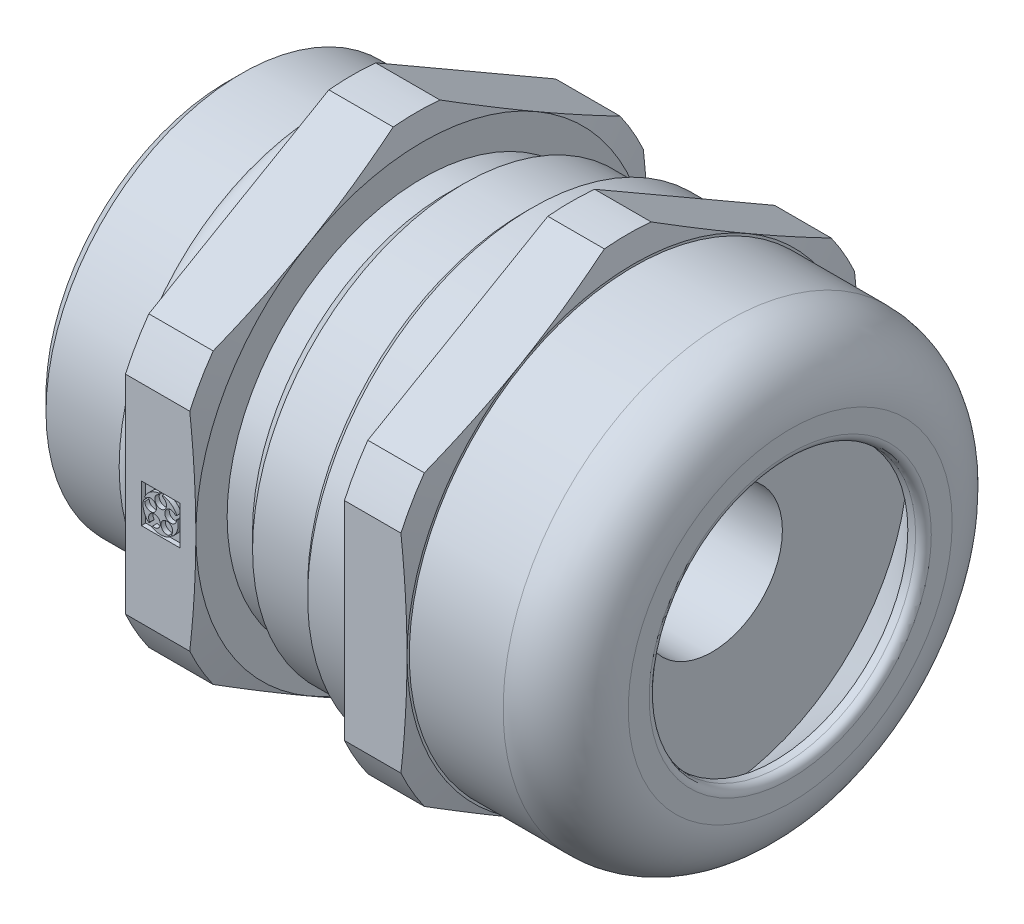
ISO-10303-21;
HEADER;
FILE_DESCRIPTION(('STEP AP214'),'2;1');
FILE_NAME('part.step','',(''),(''),'','','');
FILE_SCHEMA(('AUTOMOTIVE_DESIGN { 1 0 10303 214 1 1 1 1 }'));
ENDSEC;
DATA;
#1=APPLICATION_CONTEXT('core data for automotive mechanical design processes');
#2=APPLICATION_PROTOCOL_DEFINITION('international standard','automotive_design',2000,#1);
#3=PRODUCT_CONTEXT('',#1,'mechanical');
#4=PRODUCT('Part','Part','',(#3));
#5=PRODUCT_RELATED_PRODUCT_CATEGORY('part','',(#4));
#6=PRODUCT_DEFINITION_FORMATION('','',#4);
#7=PRODUCT_DEFINITION_CONTEXT('part definition',#1,'design');
#8=PRODUCT_DEFINITION('design','',#6,#7);
#9=PRODUCT_DEFINITION_SHAPE('','',#8);
#10=(LENGTH_UNIT() NAMED_UNIT(*) SI_UNIT(.MILLI.,.METRE.));
#11=(NAMED_UNIT(*) PLANE_ANGLE_UNIT() SI_UNIT($,.RADIAN.));
#12=(NAMED_UNIT(*) SI_UNIT($,.STERADIAN.) SOLID_ANGLE_UNIT());
#13=UNCERTAINTY_MEASURE_WITH_UNIT(LENGTH_MEASURE(1.E-05),#10,'distance_accuracy_value','');
#14=(GEOMETRIC_REPRESENTATION_CONTEXT(3) GLOBAL_UNCERTAINTY_ASSIGNED_CONTEXT((#13)) GLOBAL_UNIT_ASSIGNED_CONTEXT((#10,
#11,#12)) REPRESENTATION_CONTEXT('',''));
#15=CARTESIAN_POINT('',(0.,0.,0.));
#16=DIRECTION('',(0.,0.,1.));
#17=DIRECTION('',(1.,0.,0.));
#18=AXIS2_PLACEMENT_3D('',#15,#16,#17);
#19=CARTESIAN_POINT('',(26.,-8.37157890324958,14.5));
#20=DIRECTION('',(0.,0.866025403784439,-0.5));
#21=DIRECTION('',(-1.,0.,0.));
#22=AXIS2_PLACEMENT_3D('',#19,#20,#21);
#23=PLANE('',#22);
#24=DIRECTION('',(0.,-0.5,-0.866025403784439));
#25=VECTOR('',#24,1.);
#26=CARTESIAN_POINT('',(8.,-8.37157890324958,14.5));
#27=LINE('',#26,#25);
#28=CARTESIAN_POINT('',(8.,-9.23500097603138,13.0045091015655));
#29=VERTEX_POINT('',#28);
#30=CARTESIAN_POINT('',(8.,-15.8797357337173,1.49549089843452));
#31=VERTEX_POINT('',#30);
#32=EDGE_CURVE('E10',#29,#31,#27,.T.);
#33=ORIENTED_EDGE('',*,*,#32,.T.);
#34=DIRECTION('',(-1.,0.,0.));
#35=VECTOR('',#34,1.);
#36=CARTESIAN_POINT('',(36.,-15.8797357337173,1.49549089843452));
#37=LINE('',#36,#35);
#38=CARTESIAN_POINT('',(12.1114736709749,-15.8797357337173,1.49549089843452));
#39=VERTEX_POINT('',#38);
#40=EDGE_CURVE('E40',#39,#31,#37,.T.);
#41=ORIENTED_EDGE('',*,*,#40,.F.);
#42=CARTESIAN_POINT('',(12.4999999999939,-12.557368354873,7.24999999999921));
#43=CARTESIAN_POINT('',(12.5000196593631,-12.6956570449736,7.01039089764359));
#44=CARTESIAN_POINT('',(12.4979182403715,-12.8338927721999,6.77075116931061));
#45=CARTESIAN_POINT('',(12.4895034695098,-13.1098912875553,6.29236324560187));
#46=CARTESIAN_POINT('',(12.483204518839,-13.2476540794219,6.05361479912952));
#47=CARTESIAN_POINT('',(12.4663982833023,-13.5237175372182,5.57557103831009));
#48=CARTESIAN_POINT('',(12.4558777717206,-13.6620185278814,5.33627637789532));
#49=CARTESIAN_POINT('',(12.430668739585,-13.9398553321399,4.85557665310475));
#50=CARTESIAN_POINT('',(12.4159414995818,-14.0793903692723,4.61417318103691));
#51=CARTESIAN_POINT('',(12.382839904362,-14.3559189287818,4.13526720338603));
#52=CARTESIAN_POINT('',(12.3645270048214,-14.492917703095,3.89776346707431));
#53=CARTESIAN_POINT('',(12.3241134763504,-14.7674482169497,3.42192283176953));
#54=CARTESIAN_POINT('',(12.3019958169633,-14.9049795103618,3.18358712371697));
#55=CARTESIAN_POINT('',(12.2539951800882,-15.181224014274,2.70504139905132));
#56=CARTESIAN_POINT('',(12.2280795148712,-15.3199364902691,2.46483425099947));
#57=CARTESIAN_POINT('',(12.1725019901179,-15.5990509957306,1.98153061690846));
#58=CARTESIAN_POINT('',(12.1427949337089,-15.7394509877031,1.73843814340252));
#59=CARTESIAN_POINT('',(12.1114736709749,-15.8797357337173,1.4954908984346));
#60=B_SPLINE_CURVE_WITH_KNOTS('',3,(#42,#43,#44,#45,#46,#47,#48,#49,#50,#51,#52,#53,#54,#55,#56,
#57,#58,#59),.UNSPECIFIED.,.F.,.F.,(4,2,2,2,2,2,2,2,4),(0.,0.829947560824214,1.65706223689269,
2.48678886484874,3.32441312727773,4.14877141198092,4.97692046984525,5.81266848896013,
6.65952012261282),.UNSPECIFIED.);
#61=CARTESIAN_POINT('',(12.5,-12.5573683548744,7.25));
#62=VERTEX_POINT('',#61);
#63=EDGE_CURVE('E652',#62,#39,#60,.T.);
#64=ORIENTED_EDGE('',*,*,#63,.F.);
#65=CARTESIAN_POINT('',(12.1114736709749,-9.23500097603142,13.0045091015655));
#66=CARTESIAN_POINT('',(12.1427931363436,-9.37524919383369,12.7615591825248));
#67=CARTESIAN_POINT('',(12.1724983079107,-9.51556649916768,12.5184373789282));
#68=CARTESIAN_POINT('',(12.2280734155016,-9.79455457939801,12.0350848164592));
#69=CARTESIAN_POINT('',(12.2539884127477,-9.93322289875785,11.7948578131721));
#70=CARTESIAN_POINT('',(12.3019889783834,-10.2095359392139,11.316350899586));
#71=CARTESIAN_POINT('',(12.3241070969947,-10.347178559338,11.078073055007));
#72=CARTESIAN_POINT('',(12.3645232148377,-10.622011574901,10.602383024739));
#73=CARTESIAN_POINT('',(12.3828381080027,-10.7592011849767,10.3649718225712));
#74=CARTESIAN_POINT('',(12.4159414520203,-11.0356755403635,9.88603505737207));
#75=CARTESIAN_POINT('',(12.4306688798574,-11.1749587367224,9.64450436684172));
#76=CARTESIAN_POINT('',(12.4558781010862,-11.4523258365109,9.16355769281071));
#77=CARTESIAN_POINT('',(12.4663984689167,-11.5904087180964,8.92414315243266));
#78=CARTESIAN_POINT('',(12.4832046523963,-11.8663772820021,8.44604459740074));
#79=CARTESIAN_POINT('',(12.4895035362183,-12.004262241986,8.20736062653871));
#80=CARTESIAN_POINT('',(12.4979183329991,-12.2805720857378,7.72912821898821));
#81=CARTESIAN_POINT('',(12.5000196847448,-12.4189971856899,7.48957965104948));
#82=CARTESIAN_POINT('',(12.4999999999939,-12.557368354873,7.24999999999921));
#83=B_SPLINE_CURVE_WITH_KNOTS('',3,(#65,#66,#67,#68,#69,#70,#71,#72,#73,#74,#75,#76,#77,#78,#79,
#80,#81,#82),.UNSPECIFIED.,.F.,.F.,(4,2,2,2,2,2,2,2,4),(0.,0.846803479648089,1.68253672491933,
2.51070250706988,3.33510693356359,4.17268405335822,5.00239495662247,5.82952536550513,
6.65952013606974),.UNSPECIFIED.);
#84=CARTESIAN_POINT('',(12.1114736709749,-9.23500097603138,13.0045091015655));
#85=VERTEX_POINT('',#84);
#86=EDGE_CURVE('E1477',#85,#62,#83,.T.);
#87=ORIENTED_EDGE('',*,*,#86,.F.);
#88=DIRECTION('',(1.,0.,0.));
#89=VECTOR('',#88,1.);
#90=CARTESIAN_POINT('',(36.,-9.23500097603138,13.0045091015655));
#91=LINE('',#90,#89);
#92=EDGE_CURVE('E1041',#29,#85,#91,.T.);
#93=ORIENTED_EDGE('',*,*,#92,.F.);
#94=EDGE_LOOP('',(#33,#41,#64,#87,#93));
#95=FACE_BOUND('',#94,.T.);
#96=ADVANCED_FACE('F15',(#95),#23,.F.);
#97=CARTESIAN_POINT('',(12.1114736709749,0.,0.));
#98=DIRECTION('',(-1.,0.,0.));
#99=DIRECTION('',(0.,0.,1.));
#100=AXIS2_PLACEMENT_3D('',#97,#98,#99);
#101=CONICAL_SURFACE('',#100,15.95,1.308996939);
#102=CARTESIAN_POINT('',(12.5,0.,0.));
#103=DIRECTION('',(1.,0.,0.));
#104=DIRECTION('',(0.,0.,-1.));
#105=AXIS2_PLACEMENT_3D('',#102,#103,#104);
#106=CIRCLE('',#105,14.5);
#107=CARTESIAN_POINT('',(12.5,12.5573683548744,-7.25));
#108=VERTEX_POINT('',#107);
#109=CARTESIAN_POINT('',(12.5,12.5573683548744,7.25));
#110=VERTEX_POINT('',#109);
#111=EDGE_CURVE('E1396',#108,#110,#106,.T.);
#112=ORIENTED_EDGE('',*,*,#111,.F.);
#113=CARTESIAN_POINT('',(12.4999999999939,12.557368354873,-7.24999999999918));
#114=CARTESIAN_POINT('',(12.5000196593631,12.6956570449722,-7.01039089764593));
#115=CARTESIAN_POINT('',(12.4979182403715,12.8338927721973,-6.7707511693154));
#116=CARTESIAN_POINT('',(12.4895034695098,13.1098912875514,-6.29236324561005));
#117=CARTESIAN_POINT('',(12.483204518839,13.2476540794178,-6.05361479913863));
#118=CARTESIAN_POINT('',(12.4663982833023,13.5237175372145,-5.57557103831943));
#119=CARTESIAN_POINT('',(12.4558777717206,13.6620185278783,-5.33627637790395));
#120=CARTESIAN_POINT('',(12.430668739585,13.9398553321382,-4.85557665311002));
#121=CARTESIAN_POINT('',(12.4159414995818,14.0793903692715,-4.61417318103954));
#122=CARTESIAN_POINT('',(12.3828399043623,14.35591892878,-4.13526720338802));
#123=CARTESIAN_POINT('',(12.3645270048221,14.4929177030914,-3.89776346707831));
#124=CARTESIAN_POINT('',(12.3241134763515,14.7674482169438,-3.42192283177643));
#125=CARTESIAN_POINT('',(12.3019958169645,14.9049795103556,-3.18358712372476));
#126=CARTESIAN_POINT('',(12.2539951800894,15.1812240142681,-2.70504139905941));
#127=CARTESIAN_POINT('',(12.2280795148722,15.3199364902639,-2.46483425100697));
#128=CARTESIAN_POINT('',(12.1725019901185,15.5990509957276,-1.98153061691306));
#129=CARTESIAN_POINT('',(12.1427949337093,15.7394509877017,-1.73843814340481));
#130=CARTESIAN_POINT('',(12.1114736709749,15.8797357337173,-1.49549089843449));
#131=B_SPLINE_CURVE_WITH_KNOTS('',3,(#113,#114,#115,#116,#117,#118,#119,#120,#121,#122,#123,
#124,#125,#126,#127,#128,#129,#130),.UNSPECIFIED.,.F.,.F.,(4,2,2,2,2,2,2,2,4),(0.,
0.829947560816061,1.65706223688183,2.48678886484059,3.32441312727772,4.1487714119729,
4.97692046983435,5.81266848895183,6.65952012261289),.UNSPECIFIED.);
#132=CARTESIAN_POINT('',(12.1114736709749,15.8797357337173,-1.49549089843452));
#133=VERTEX_POINT('',#132);
#134=EDGE_CURVE('E26',#108,#133,#131,.T.);
#135=ORIENTED_EDGE('',*,*,#134,.T.);
#136=CARTESIAN_POINT('',(12.1114736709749,0.,0.));
#137=DIRECTION('',(1.,0.,0.));
#138=DIRECTION('',(0.,0.,-1.));
#139=AXIS2_PLACEMENT_3D('',#136,#137,#138);
#140=CIRCLE('',#139,15.95);
#141=CARTESIAN_POINT('',(12.1114736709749,15.8797357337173,1.49549089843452));
#142=VERTEX_POINT('',#141);
#143=EDGE_CURVE('E1300',#133,#142,#140,.T.);
#144=ORIENTED_EDGE('',*,*,#143,.T.);
#145=CARTESIAN_POINT('',(12.1114736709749,15.8797357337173,1.49549089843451));
#146=CARTESIAN_POINT('',(12.142793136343,15.7394590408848,1.73842437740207));
#147=CARTESIAN_POINT('',(12.1724983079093,15.5990680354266,1.98150363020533));
#148=CARTESIAN_POINT('',(12.2280734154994,15.3199664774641,2.46479067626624));
#149=CARTESIAN_POINT('',(12.2539884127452,15.1812579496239,2.70499446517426));
#150=CARTESIAN_POINT('',(12.3019889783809,14.9050153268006,3.18354203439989));
#151=CARTESIAN_POINT('',(12.3241070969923,14.7674819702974,3.42188296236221));
#152=CARTESIAN_POINT('',(12.3645232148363,14.4929388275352,3.8977403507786));
#153=CARTESIAN_POINT('',(12.382838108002,14.3559295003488,4.13525563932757));
#154=CARTESIAN_POINT('',(12.4159414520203,14.0793952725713,4.6141578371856));
#155=CARTESIAN_POINT('',(12.4306688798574,13.9398651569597,4.85554596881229));
#156=CARTESIAN_POINT('',(12.4558781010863,13.6620366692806,5.3362262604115));
#157=CARTESIAN_POINT('',(12.4663984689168,13.5237390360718,5.57551681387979));
#158=CARTESIAN_POINT('',(12.4832046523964,13.2476778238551,6.05356187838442));
#159=CARTESIAN_POINT('',(12.4895035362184,13.109913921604,6.29231574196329));
#160=CARTESIAN_POINT('',(12.4979183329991,12.8339074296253,6.77072328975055));
#161=CARTESIAN_POINT('',(12.5000196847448,12.6956648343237,7.01037722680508));
#162=CARTESIAN_POINT('',(12.4999999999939,12.557368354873,7.24999999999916));
#163=B_SPLINE_CURVE_WITH_KNOTS('',3,(#145,#146,#147,#148,#149,#150,#151,#152,#153,#154,#155,
#156,#157,#158,#159,#160,#161,#162),.UNSPECIFIED.,.F.,.F.,(4,2,2,2,2,2,2,2,4),(0.,
0.846803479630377,1.6825367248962,2.5107025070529,3.33510693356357,4.17268405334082,
5.00239495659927,5.82952536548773,6.65952013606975),.UNSPECIFIED.);
#164=EDGE_CURVE('E673',#142,#110,#163,.T.);
#165=ORIENTED_EDGE('',*,*,#164,.T.);
#166=EDGE_LOOP('',(#112,#135,#144,#165));
#167=FACE_BOUND('',#166,.T.);
#168=ADVANCED_FACE('F745',(#167),#101,.T.);
#169=CARTESIAN_POINT('',(26.,16.7431578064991,0.));
#170=DIRECTION('',(0.,-0.866025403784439,-0.5));
#171=DIRECTION('',(0.,0.5,-0.866025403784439));
#172=AXIS2_PLACEMENT_3D('',#169,#170,#171);
#173=PLANE('',#172);
#174=DIRECTION('',(0.,-0.5,0.866025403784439));
#175=VECTOR('',#174,1.);
#176=CARTESIAN_POINT('',(8.,16.7431578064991,0.));
#177=LINE('',#176,#175);
#178=CARTESIAN_POINT('',(8.,15.8797357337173,1.49549089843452));
#179=VERTEX_POINT('',#178);
#180=CARTESIAN_POINT('',(8.,9.23500097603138,13.0045091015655));
#181=VERTEX_POINT('',#180);
#182=EDGE_CURVE('E669',#179,#181,#177,.T.);
#183=ORIENTED_EDGE('',*,*,#182,.T.);
#184=DIRECTION('',(-1.,0.,0.));
#185=VECTOR('',#184,1.);
#186=CARTESIAN_POINT('',(36.,9.23500097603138,13.0045091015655));
#187=LINE('',#186,#185);
#188=CARTESIAN_POINT('',(12.1114736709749,9.23500097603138,13.0045091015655));
#189=VERTEX_POINT('',#188);
#190=EDGE_CURVE('E803',#189,#181,#187,.T.);
#191=ORIENTED_EDGE('',*,*,#190,.F.);
#192=CARTESIAN_POINT('',(12.4999999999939,12.557368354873,7.24999999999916));
#193=CARTESIAN_POINT('',(12.5000196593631,12.4190051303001,7.48956606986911));
#194=CARTESIAN_POINT('',(12.4979182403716,12.280588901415,7.7291015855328));
#195=CARTESIAN_POINT('',(12.4895034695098,12.0042920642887,8.20731727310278));
#196=CARTESIAN_POINT('',(12.4832045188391,11.8664112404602,8.44599757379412));
#197=CARTESIAN_POINT('',(12.4663982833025,11.5904449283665,8.92409742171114));
#198=CARTESIAN_POINT('',(12.4558777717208,11.4523601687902,9.16351692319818));
#199=CARTESIAN_POINT('',(12.4306687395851,11.174980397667,9.6444805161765));
#200=CARTESIAN_POINT('',(12.4159414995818,11.0356863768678,9.88602313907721));
#201=CARTESIAN_POINT('',(12.3828399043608,10.7592059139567,10.3649568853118));
#202=CARTESIAN_POINT('',(12.3645270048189,10.6220210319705,10.60235317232));
#203=CARTESIAN_POINT('',(12.3241134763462,10.3471962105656,11.0780238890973));
#204=CARTESIAN_POINT('',(12.3019958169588,10.2095570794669,11.3162973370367));
#205=CARTESIAN_POINT('',(12.2539951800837,9.93324657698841,11.7948049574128));
#206=CARTESIAN_POINT('',(12.2280795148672,9.79457732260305,12.035037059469));
#207=CARTESIAN_POINT('',(12.1725019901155,9.51558135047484,12.5184091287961));
#208=CARTESIAN_POINT('',(12.1427949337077,9.37525708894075,12.7615453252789));
#209=CARTESIAN_POINT('',(12.1114736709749,9.23500097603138,13.0045091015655));
#210=B_SPLINE_CURVE_WITH_KNOTS('',3,(#192,#193,#194,#195,#196,#197,#198,#199,#200,#201,#202,
#203,#204,#205,#206,#207,#208,#209),.UNSPECIFIED.,.F.,.F.,(4,2,2,2,2,2,2,2,4),(0.,
0.829947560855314,1.65706223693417,2.48678886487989,3.32441312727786,4.14877141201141,
4.97692046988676,5.81266848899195,6.65952012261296),.UNSPECIFIED.);
#211=EDGE_CURVE('E1061',#110,#189,#210,.T.);
#212=ORIENTED_EDGE('',*,*,#211,.F.);
#213=ORIENTED_EDGE('',*,*,#164,.F.);
#214=DIRECTION('',(1.,0.,0.));
#215=VECTOR('',#214,1.);
#216=CARTESIAN_POINT('',(36.,15.8797357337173,1.49549089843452));
#217=LINE('',#216,#215);
#218=EDGE_CURVE('E780',#179,#142,#217,.T.);
#219=ORIENTED_EDGE('',*,*,#218,.F.);
#220=EDGE_LOOP('',(#183,#191,#212,#213,#219));
#221=FACE_BOUND('',#220,.T.);
#222=ADVANCED_FACE('F755',(#221),#173,.F.);
#223=CARTESIAN_POINT('',(19.,0.,0.));
#224=DIRECTION('',(1.,0.,0.));
#225=DIRECTION('',(0.,0.,-1.));
#226=AXIS2_PLACEMENT_3D('',#223,#224,#225);
#227=CONICAL_SURFACE('',#226,13.855,0.7853981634);
#228=CARTESIAN_POINT('',(19.5,0.,0.));
#229=DIRECTION('',(1.,0.,0.));
#230=DIRECTION('',(0.,0.,-1.));
#231=AXIS2_PLACEMENT_3D('',#228,#229,#230);
#232=CIRCLE('',#231,14.355);
#233=CARTESIAN_POINT('',(19.5,0.,-14.355));
#234=VERTEX_POINT('',#233);
#235=EDGE_CURVE('E626',#234,#234,#232,.T.);
#236=ORIENTED_EDGE('',*,*,#235,.F.);
#237=EDGE_LOOP('',(#236));
#238=FACE_BOUND('',#237,.T.);
#239=CARTESIAN_POINT('',(19.,0.,0.));
#240=DIRECTION('',(1.,0.,0.));
#241=DIRECTION('',(0.,0.,-1.));
#242=AXIS2_PLACEMENT_3D('',#239,#240,#241);
#243=CIRCLE('',#242,13.855);
#244=CARTESIAN_POINT('',(19.,0.,-13.855));
#245=VERTEX_POINT('',#244);
#246=EDGE_CURVE('E674',#245,#245,#243,.T.);
#247=ORIENTED_EDGE('',*,*,#246,.T.);
#248=EDGE_LOOP('',(#247));
#249=FACE_BOUND('',#248,.T.);
#250=ADVANCED_FACE('F791',(#238,#249),#227,.T.);
#251=CARTESIAN_POINT('',(19.,13.5,0.));
#252=DIRECTION('',(1.,0.,0.));
#253=DIRECTION('',(0.,1.,0.));
#254=AXIS2_PLACEMENT_3D('',#251,#252,#253);
#255=PLANE('',#254);
#256=ORIENTED_EDGE('',*,*,#246,.F.);
#257=EDGE_LOOP('',(#256));
#258=FACE_BOUND('',#257,.T.);
#259=CARTESIAN_POINT('',(19.,0.,0.));
#260=DIRECTION('',(1.,0.,0.));
#261=DIRECTION('',(0.,0.,-1.));
#262=AXIS2_PLACEMENT_3D('',#259,#260,#261);
#263=CIRCLE('',#262,13.5);
#264=CARTESIAN_POINT('',(19.,0.,-13.5));
#265=VERTEX_POINT('',#264);
#266=EDGE_CURVE('E658',#265,#265,#263,.T.);
#267=ORIENTED_EDGE('',*,*,#266,.T.);
#268=EDGE_LOOP('',(#267));
#269=FACE_BOUND('',#268,.T.);
#270=ADVANCED_FACE('F2210',(#258,#269),#255,.F.);
#271=CARTESIAN_POINT('',(36.,0.,0.));
#272=DIRECTION('',(-1.,0.,0.));
#273=DIRECTION('',(0.,0.,-1.));
#274=AXIS2_PLACEMENT_3D('',#271,#272,#273);
#275=CYLINDRICAL_SURFACE('',#274,13.5);
#276=CARTESIAN_POINT('',(15.125,0.,0.));
#277=DIRECTION('',(1.,0.,0.));
#278=DIRECTION('',(0.,0.,-1.));
#279=AXIS2_PLACEMENT_3D('',#276,#277,#278);
#280=CIRCLE('',#279,13.5);
#281=CARTESIAN_POINT('',(15.125,0.,-13.5));
#282=VERTEX_POINT('',#281);
#283=EDGE_CURVE('E654',#282,#282,#280,.T.);
#284=ORIENTED_EDGE('',*,*,#283,.T.);
#285=EDGE_LOOP('',(#284));
#286=FACE_BOUND('',#285,.T.);
#287=ORIENTED_EDGE('',*,*,#266,.F.);
#288=EDGE_LOOP('',(#287));
#289=FACE_BOUND('',#288,.T.);
#290=ADVANCED_FACE('F2204',(#286,#289),#275,.T.);
#291=CARTESIAN_POINT('',(14.125,0.,0.));
#292=DIRECTION('',(1.,0.,0.));
#293=DIRECTION('',(0.,0.,-1.));
#294=AXIS2_PLACEMENT_3D('',#291,#292,#293);
#295=CONICAL_SURFACE('',#294,12.5,0.7853981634);
#296=ORIENTED_EDGE('',*,*,#283,.F.);
#297=EDGE_LOOP('',(#296));
#298=FACE_BOUND('',#297,.T.);
#299=CARTESIAN_POINT('',(14.125,0.,0.));
#300=DIRECTION('',(1.,0.,0.));
#301=DIRECTION('',(0.,0.,-1.));
#302=AXIS2_PLACEMENT_3D('',#299,#300,#301);
#303=CIRCLE('',#302,12.5);
#304=CARTESIAN_POINT('',(14.125,0.,-12.5));
#305=VERTEX_POINT('',#304);
#306=EDGE_CURVE('E659',#305,#305,#303,.T.);
#307=ORIENTED_EDGE('',*,*,#306,.T.);
#308=EDGE_LOOP('',(#307));
#309=FACE_BOUND('',#308,.T.);
#310=ADVANCED_FACE('F2209',(#298,#309),#295,.T.);
#311=CARTESIAN_POINT('',(36.,0.,0.));
#312=DIRECTION('',(-1.,0.,0.));
#313=DIRECTION('',(0.,0.,-1.));
#314=AXIS2_PLACEMENT_3D('',#311,#312,#313);
#315=CYLINDRICAL_SURFACE('',#314,12.5);
#316=CARTESIAN_POINT('',(12.5,0.,0.));
#317=DIRECTION('',(1.,0.,0.));
#318=DIRECTION('',(0.,0.,-1.));
#319=AXIS2_PLACEMENT_3D('',#316,#317,#318);
#320=CIRCLE('',#319,12.5);
#321=CARTESIAN_POINT('',(12.5,0.,-12.5));
#322=VERTEX_POINT('',#321);
#323=EDGE_CURVE('E1229',#322,#322,#320,.T.);
#324=ORIENTED_EDGE('',*,*,#323,.T.);
#325=EDGE_LOOP('',(#324));
#326=FACE_BOUND('',#325,.T.);
#327=ORIENTED_EDGE('',*,*,#306,.F.);
#328=EDGE_LOOP('',(#327));
#329=FACE_BOUND('',#328,.T.);
#330=ADVANCED_FACE('F2385',(#326,#329),#315,.T.);
#331=CARTESIAN_POINT('',(12.5,14.5,0.));
#332=DIRECTION('',(-1.,0.,0.));
#333=DIRECTION('',(0.,0.,1.));
#334=AXIS2_PLACEMENT_3D('',#331,#332,#333);
#335=PLANE('',#334);
#336=CARTESIAN_POINT('',(12.5,0.,0.));
#337=DIRECTION('',(1.,0.,0.));
#338=DIRECTION('',(0.,0.,-1.));
#339=AXIS2_PLACEMENT_3D('',#336,#337,#338);
#340=CIRCLE('',#339,14.5);
#341=CARTESIAN_POINT('',(12.5,0.,-14.5));
#342=VERTEX_POINT('',#341);
#343=EDGE_CURVE('E1233',#342,#108,#340,.T.);
#344=ORIENTED_EDGE('',*,*,#343,.T.);
#345=ORIENTED_EDGE('',*,*,#111,.T.);
#346=CARTESIAN_POINT('',(12.5,0.,0.));
#347=DIRECTION('',(1.,0.,0.));
#348=DIRECTION('',(0.,0.,-1.));
#349=AXIS2_PLACEMENT_3D('',#346,#347,#348);
#350=CIRCLE('',#349,14.5);
#351=CARTESIAN_POINT('',(12.5,0.,14.5));
#352=VERTEX_POINT('',#351);
#353=EDGE_CURVE('E1055',#110,#352,#350,.T.);
#354=ORIENTED_EDGE('',*,*,#353,.T.);
#355=CARTESIAN_POINT('',(12.5,0.,0.));
#356=DIRECTION('',(1.,0.,0.));
#357=DIRECTION('',(0.,0.,-1.));
#358=AXIS2_PLACEMENT_3D('',#355,#356,#357);
#359=CIRCLE('',#358,14.5);
#360=EDGE_CURVE('E1051',#352,#62,#359,.T.);
#361=ORIENTED_EDGE('',*,*,#360,.T.);
#362=CARTESIAN_POINT('',(12.5,0.,0.));
#363=DIRECTION('',(1.,0.,0.));
#364=DIRECTION('',(0.,0.,-1.));
#365=AXIS2_PLACEMENT_3D('',#362,#363,#364);
#366=CIRCLE('',#365,14.5);
#367=CARTESIAN_POINT('',(12.5,-12.5573683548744,-7.25));
#368=VERTEX_POINT('',#367);
#369=EDGE_CURVE('E1056',#62,#368,#366,.T.);
#370=ORIENTED_EDGE('',*,*,#369,.T.);
#371=CARTESIAN_POINT('',(12.5,0.,0.));
#372=DIRECTION('',(1.,0.,0.));
#373=DIRECTION('',(0.,0.,-1.));
#374=AXIS2_PLACEMENT_3D('',#371,#372,#373);
#375=CIRCLE('',#374,14.5);
#376=EDGE_CURVE('E1431',#368,#342,#375,.T.);
#377=ORIENTED_EDGE('',*,*,#376,.T.);
#378=EDGE_LOOP('',(#344,#345,#354,#361,#370,#377));
#379=FACE_BOUND('',#378,.T.);
#380=ORIENTED_EDGE('',*,*,#323,.F.);
#381=EDGE_LOOP('',(#380));
#382=FACE_BOUND('',#381,.T.);
#383=ADVANCED_FACE('F2296',(#379,#382),#335,.F.);
#384=CARTESIAN_POINT('',(36.,0.,0.));
#385=DIRECTION('',(-1.,0.,0.));
#386=DIRECTION('',(0.,0.,-1.));
#387=AXIS2_PLACEMENT_3D('',#384,#385,#386);
#388=CYLINDRICAL_SURFACE('',#387,15.95);
#389=CARTESIAN_POINT('',(8.,0.,0.));
#390=DIRECTION('',(1.,0.,0.));
#391=DIRECTION('',(0.,0.,-1.));
#392=AXIS2_PLACEMENT_3D('',#389,#390,#391);
#393=CIRCLE('',#392,15.95);
#394=CARTESIAN_POINT('',(8.,6.64473475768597,14.5));
#395=VERTEX_POINT('',#394);
#396=EDGE_CURVE('E1048',#181,#395,#393,.T.);
#397=ORIENTED_EDGE('',*,*,#396,.T.);
#398=DIRECTION('',(1.,0.,0.));
#399=VECTOR('',#398,1.);
#400=CARTESIAN_POINT('',(36.,6.64473475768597,14.5));
#401=LINE('',#400,#399);
#402=CARTESIAN_POINT('',(12.1114736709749,6.64473475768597,14.5));
#403=VERTEX_POINT('',#402);
#404=EDGE_CURVE('E811',#395,#403,#401,.T.);
#405=ORIENTED_EDGE('',*,*,#404,.T.);
#406=CARTESIAN_POINT('',(12.1114736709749,0.,0.));
#407=DIRECTION('',(1.,0.,0.));
#408=DIRECTION('',(0.,0.,-1.));
#409=AXIS2_PLACEMENT_3D('',#406,#407,#408);
#410=CIRCLE('',#409,15.95);
#411=EDGE_CURVE('E1033',#189,#403,#410,.T.);
#412=ORIENTED_EDGE('',*,*,#411,.F.);
#413=ORIENTED_EDGE('',*,*,#190,.T.);
#414=EDGE_LOOP('',(#397,#405,#412,#413));
#415=FACE_BOUND('',#414,.T.);
#416=ADVANCED_FACE('F1079',(#415),#388,.T.);
#417=CARTESIAN_POINT('',(36.,0.,0.));
#418=DIRECTION('',(-1.,0.,0.));
#419=DIRECTION('',(0.,0.,-1.));
#420=AXIS2_PLACEMENT_3D('',#417,#418,#419);
#421=CYLINDRICAL_SURFACE('',#420,15.95);
#422=CARTESIAN_POINT('',(8.,0.,0.));
#423=DIRECTION('',(1.,0.,0.));
#424=DIRECTION('',(0.,0.,-1.));
#425=AXIS2_PLACEMENT_3D('',#422,#423,#424);
#426=CIRCLE('',#425,15.95);
#427=CARTESIAN_POINT('',(8.,6.64473475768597,-14.5));
#428=VERTEX_POINT('',#427);
#429=CARTESIAN_POINT('',(8.,9.23500097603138,-13.0045091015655));
#430=VERTEX_POINT('',#429);
#431=EDGE_CURVE('E812',#428,#430,#426,.T.);
#432=ORIENTED_EDGE('',*,*,#431,.T.);
#433=DIRECTION('',(1.,0.,0.));
#434=VECTOR('',#433,1.);
#435=CARTESIAN_POINT('',(36.,9.23500097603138,-13.0045091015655));
#436=LINE('',#435,#434);
#437=CARTESIAN_POINT('',(12.1114736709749,9.23500097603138,-13.0045091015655));
#438=VERTEX_POINT('',#437);
#439=EDGE_CURVE('E1313',#430,#438,#436,.T.);
#440=ORIENTED_EDGE('',*,*,#439,.T.);
#441=CARTESIAN_POINT('',(12.1114736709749,0.,0.));
#442=DIRECTION('',(1.,0.,0.));
#443=DIRECTION('',(0.,0.,-1.));
#444=AXIS2_PLACEMENT_3D('',#441,#442,#443);
#445=CIRCLE('',#444,15.95);
#446=CARTESIAN_POINT('',(12.1114736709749,6.64473475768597,-14.5));
#447=VERTEX_POINT('',#446);
#448=EDGE_CURVE('E1218',#447,#438,#445,.T.);
#449=ORIENTED_EDGE('',*,*,#448,.F.);
#450=DIRECTION('',(-1.,0.,0.));
#451=VECTOR('',#450,1.);
#452=CARTESIAN_POINT('',(36.,6.64473475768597,-14.5));
#453=LINE('',#452,#451);
#454=EDGE_CURVE('E1317',#447,#428,#453,.T.);
#455=ORIENTED_EDGE('',*,*,#454,.T.);
#456=EDGE_LOOP('',(#432,#440,#449,#455));
#457=FACE_BOUND('',#456,.T.);
#458=ADVANCED_FACE('F1022',(#457),#421,.T.);
#459=CARTESIAN_POINT('',(36.,0.,0.));
#460=DIRECTION('',(-1.,0.,0.));
#461=DIRECTION('',(0.,0.,-1.));
#462=AXIS2_PLACEMENT_3D('',#459,#460,#461);
#463=CYLINDRICAL_SURFACE('',#462,15.95);
#464=ORIENTED_EDGE('',*,*,#143,.F.);
#465=DIRECTION('',(-1.,0.,0.));
#466=VECTOR('',#465,1.);
#467=CARTESIAN_POINT('',(36.,15.8797357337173,-1.49549089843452));
#468=LINE('',#467,#466);
#469=CARTESIAN_POINT('',(8.,15.8797357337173,-1.49549089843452));
#470=VERTEX_POINT('',#469);
#471=EDGE_CURVE('E1095',#133,#470,#468,.T.);
#472=ORIENTED_EDGE('',*,*,#471,.T.);
#473=CARTESIAN_POINT('',(8.,0.,0.));
#474=DIRECTION('',(1.,0.,0.));
#475=DIRECTION('',(0.,0.,-1.));
#476=AXIS2_PLACEMENT_3D('',#473,#474,#475);
#477=CIRCLE('',#476,15.95);
#478=EDGE_CURVE('E1091',#470,#179,#477,.T.);
#479=ORIENTED_EDGE('',*,*,#478,.T.);
#480=ORIENTED_EDGE('',*,*,#218,.T.);
#481=EDGE_LOOP('',(#464,#472,#479,#480));
#482=FACE_BOUND('',#481,.T.);
#483=ADVANCED_FACE('F2025',(#482),#463,.T.);
#484=CARTESIAN_POINT('',(8.,12.5,0.));
#485=DIRECTION('',(1.,0.,0.));
#486=DIRECTION('',(0.,1.,0.));
#487=AXIS2_PLACEMENT_3D('',#484,#485,#486);
#488=PLANE('',#487);
#489=ORIENTED_EDGE('',*,*,#478,.F.);
#490=DIRECTION('',(0.,0.5,0.866025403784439));
#491=VECTOR('',#490,1.);
#492=CARTESIAN_POINT('',(8.,8.37157890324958,-14.5));
#493=LINE('',#492,#491);
#494=EDGE_CURVE('E1472',#430,#470,#493,.T.);
#495=ORIENTED_EDGE('',*,*,#494,.F.);
#496=ORIENTED_EDGE('',*,*,#431,.F.);
#497=DIRECTION('',(0.,1.,0.));
#498=VECTOR('',#497,1.);
#499=CARTESIAN_POINT('',(8.,-8.37157890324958,-14.5));
#500=LINE('',#499,#498);
#501=CARTESIAN_POINT('',(8.,-6.64473475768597,-14.5));
#502=VERTEX_POINT('',#501);
#503=EDGE_CURVE('E1468',#502,#428,#500,.T.);
#504=ORIENTED_EDGE('',*,*,#503,.F.);
#505=CARTESIAN_POINT('',(8.,0.,0.));
#506=DIRECTION('',(1.,0.,0.));
#507=DIRECTION('',(0.,0.,-1.));
#508=AXIS2_PLACEMENT_3D('',#505,#506,#507);
#509=CIRCLE('',#508,15.95);
#510=CARTESIAN_POINT('',(8.,-9.23500097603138,-13.0045091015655));
#511=VERTEX_POINT('',#510);
#512=EDGE_CURVE('E1249',#511,#502,#509,.T.);
#513=ORIENTED_EDGE('',*,*,#512,.F.);
#514=DIRECTION('',(0.,0.5,-0.866025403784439));
#515=VECTOR('',#514,1.);
#516=CARTESIAN_POINT('',(8.,-16.7431578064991,0.));
#517=LINE('',#516,#515);
#518=CARTESIAN_POINT('',(8.,-15.8797357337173,-1.49549089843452));
#519=VERTEX_POINT('',#518);
#520=EDGE_CURVE('E727',#519,#511,#517,.T.);
#521=ORIENTED_EDGE('',*,*,#520,.F.);
#522=CARTESIAN_POINT('',(8.,0.,0.));
#523=DIRECTION('',(1.,0.,0.));
#524=DIRECTION('',(0.,0.,-1.));
#525=AXIS2_PLACEMENT_3D('',#522,#523,#524);
#526=CIRCLE('',#525,15.95);
#527=EDGE_CURVE('E1074',#31,#519,#526,.T.);
#528=ORIENTED_EDGE('',*,*,#527,.F.);
#529=ORIENTED_EDGE('',*,*,#32,.F.);
#530=CARTESIAN_POINT('',(8.,0.,0.));
#531=DIRECTION('',(1.,0.,0.));
#532=DIRECTION('',(0.,0.,-1.));
#533=AXIS2_PLACEMENT_3D('',#530,#531,#532);
#534=CIRCLE('',#533,15.95);
#535=CARTESIAN_POINT('',(8.,-6.64473475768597,14.5));
#536=VERTEX_POINT('',#535);
#537=EDGE_CURVE('E1334',#536,#29,#534,.T.);
#538=ORIENTED_EDGE('',*,*,#537,.F.);
#539=DIRECTION('',(0.,-1.,0.));
#540=VECTOR('',#539,1.);
#541=CARTESIAN_POINT('',(8.,8.37157890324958,14.5));
#542=LINE('',#541,#540);
#543=EDGE_CURVE('E649',#395,#536,#542,.T.);
#544=ORIENTED_EDGE('',*,*,#543,.F.);
#545=ORIENTED_EDGE('',*,*,#396,.F.);
#546=ORIENTED_EDGE('',*,*,#182,.F.);
#547=EDGE_LOOP('',(#489,#495,#496,#504,#513,#521,#528,#529,#538,#544,#545,#546));
#548=FACE_BOUND('',#547,.T.);
#549=CARTESIAN_POINT('',(8.,0.,0.));
#550=DIRECTION('',(1.,0.,0.));
#551=DIRECTION('',(0.,0.,-1.));
#552=AXIS2_PLACEMENT_3D('',#549,#550,#551);
#553=CIRCLE('',#552,12.6410673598);
#554=CARTESIAN_POINT('',(8.,0.,-12.6410673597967));
#555=VERTEX_POINT('',#554);
#556=EDGE_CURVE('E1333',#555,#555,#553,.T.);
#557=ORIENTED_EDGE('',*,*,#556,.T.);
#558=EDGE_LOOP('',(#557));
#559=FACE_BOUND('',#558,.T.);
#560=ADVANCED_FACE('F1950',(#548,#559),#488,.F.);
#561=CARTESIAN_POINT('',(36.,0.,0.));
#562=DIRECTION('',(-1.,0.,0.));
#563=DIRECTION('',(0.,0.,-1.));
#564=AXIS2_PLACEMENT_3D('',#561,#562,#563);
#565=CYLINDRICAL_SURFACE('',#564,15.95);
#566=CARTESIAN_POINT('',(12.1114736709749,0.,0.));
#567=DIRECTION('',(1.,0.,0.));
#568=DIRECTION('',(0.,0.,-1.));
#569=AXIS2_PLACEMENT_3D('',#566,#567,#568);
#570=CIRCLE('',#569,15.95);
#571=CARTESIAN_POINT('',(12.1114736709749,-6.64473475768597,14.5));
#572=VERTEX_POINT('',#571);
#573=EDGE_CURVE('E1009',#572,#85,#570,.T.);
#574=ORIENTED_EDGE('',*,*,#573,.F.);
#575=DIRECTION('',(-1.,0.,0.));
#576=VECTOR('',#575,1.);
#577=CARTESIAN_POINT('',(36.,-6.64473475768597,14.5));
#578=LINE('',#577,#576);
#579=EDGE_CURVE('E1329',#572,#536,#578,.T.);
#580=ORIENTED_EDGE('',*,*,#579,.T.);
#581=ORIENTED_EDGE('',*,*,#537,.T.);
#582=ORIENTED_EDGE('',*,*,#92,.T.);
#583=EDGE_LOOP('',(#574,#580,#581,#582));
#584=FACE_BOUND('',#583,.T.);
#585=ADVANCED_FACE('F2170',(#584),#565,.T.);
#586=CARTESIAN_POINT('',(12.1114736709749,0.,0.));
#587=DIRECTION('',(-1.,0.,0.));
#588=DIRECTION('',(0.,0.,1.));
#589=AXIS2_PLACEMENT_3D('',#586,#587,#588);
#590=CONICAL_SURFACE('',#589,15.95,1.308996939);
#591=ORIENTED_EDGE('',*,*,#411,.T.);
#592=CARTESIAN_POINT('',(12.1114736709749,6.64473475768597,14.5));
#593=CARTESIAN_POINT('',(12.1427673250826,6.36444091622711,14.4999836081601));
#594=CARTESIAN_POINT('',(12.1724493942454,6.08396398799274,14.4999409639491));
#595=CARTESIAN_POINT('',(12.2279847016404,5.52633293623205,14.4998749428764));
#596=CARTESIAN_POINT('',(12.25388290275,5.24918328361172,14.4998513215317));
#597=CARTESIAN_POINT('',(12.3018562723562,4.69708077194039,14.4998908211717));
#598=CARTESIAN_POINT('',(12.3239639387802,4.42213074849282,14.4999531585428));
#599=CARTESIAN_POINT('',(12.3643654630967,3.87320849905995,14.5001193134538));
#600=CARTESIAN_POINT('',(12.3826762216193,3.59923751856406,14.5002229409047));
#601=CARTESIAN_POINT('',(12.4158056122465,3.04622703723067,14.5001882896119));
#602=CARTESIAN_POINT('',(12.4305568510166,2.76718348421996,14.5000457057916));
#603=CARTESIAN_POINT('',(12.455806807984,2.21153151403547,14.4997795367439));
#604=CARTESIAN_POINT('',(12.4663441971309,1.93492486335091,14.4996557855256));
#605=CARTESIAN_POINT('',(12.4831775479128,1.38244292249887,14.499603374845));
#606=CARTESIAN_POINT('',(12.4894865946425,1.10656803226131,14.4996741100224));
#607=CARTESIAN_POINT('',(12.4979150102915,0.553795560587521,14.4998507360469));
#608=CARTESIAN_POINT('',(12.5000197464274,0.276897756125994,14.4999567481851));
#609=CARTESIAN_POINT('',(12.4999999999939,0.,14.4999999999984));
#610=B_SPLINE_CURVE_WITH_KNOTS('',3,(#592,#593,#594,#595,#596,#597,#598,#599,#600,#601,#602,
#603,#604,#605,#606,#607,#608,#609),.UNSPECIFIED.,.F.,.F.,(4,2,2,2,2,2,2,2,4),(0.,
0.846105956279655,1.68115594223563,2.50864359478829,3.33236492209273,4.17063549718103,
5.00102618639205,5.82883512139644,6.65952019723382),.UNSPECIFIED.);
#611=EDGE_CURVE('E1042',#403,#352,#610,.T.);
#612=ORIENTED_EDGE('',*,*,#611,.T.);
#613=ORIENTED_EDGE('',*,*,#353,.F.);
#614=ORIENTED_EDGE('',*,*,#211,.T.);
#615=EDGE_LOOP('',(#591,#612,#613,#614));
#616=FACE_BOUND('',#615,.T.);
#617=ADVANCED_FACE('F926',(#616),#590,.T.);
#618=CARTESIAN_POINT('',(36.,0.,0.));
#619=DIRECTION('',(-1.,0.,0.));
#620=DIRECTION('',(0.,0.,-1.));
#621=AXIS2_PLACEMENT_3D('',#618,#619,#620);
#622=CYLINDRICAL_SURFACE('',#621,15.95);
#623=ORIENTED_EDGE('',*,*,#527,.T.);
#624=DIRECTION('',(1.,0.,0.));
#625=VECTOR('',#624,1.);
#626=CARTESIAN_POINT('',(36.,-15.8797357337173,-1.49549089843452));
#627=LINE('',#626,#625);
#628=CARTESIAN_POINT('',(12.1114736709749,-15.8797357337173,-1.49549089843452));
#629=VERTEX_POINT('',#628);
#630=EDGE_CURVE('E1298',#519,#629,#627,.T.);
#631=ORIENTED_EDGE('',*,*,#630,.T.);
#632=CARTESIAN_POINT('',(12.1114736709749,0.,0.));
#633=DIRECTION('',(1.,0.,0.));
#634=DIRECTION('',(0.,0.,-1.));
#635=AXIS2_PLACEMENT_3D('',#632,#633,#634);
#636=CIRCLE('',#635,15.95);
#637=EDGE_CURVE('E1481',#39,#629,#636,.T.);
#638=ORIENTED_EDGE('',*,*,#637,.F.);
#639=ORIENTED_EDGE('',*,*,#40,.T.);
#640=EDGE_LOOP('',(#623,#631,#638,#639));
#641=FACE_BOUND('',#640,.T.);
#642=ADVANCED_FACE('F1946',(#641),#622,.T.);
#643=CARTESIAN_POINT('',(0.,0.,0.));
#644=DIRECTION('',(1.,0.,0.));
#645=DIRECTION('',(0.,1.,0.));
#646=AXIS2_PLACEMENT_3D('',#643,#644,#645);
#647=PLANE('',#646);
#648=CARTESIAN_POINT('',(0.,0.,0.));
#649=DIRECTION('',(1.,0.,0.));
#650=DIRECTION('',(0.,0.,-1.));
#651=AXIS2_PLACEMENT_3D('',#648,#649,#650);
#652=CIRCLE('',#651,11.58);
#653=CARTESIAN_POINT('',(0.,0.,-11.58));
#654=VERTEX_POINT('',#653);
#655=EDGE_CURVE('E1196',#654,#654,#652,.T.);
#656=ORIENTED_EDGE('',*,*,#655,.F.);
#657=EDGE_LOOP('',(#656));
#658=FACE_BOUND('',#657,.T.);
#659=CARTESIAN_POINT('',(0.,0.,0.));
#660=DIRECTION('',(1.,0.,0.));
#661=DIRECTION('',(0.,0.,-1.));
#662=AXIS2_PLACEMENT_3D('',#659,#660,#661);
#663=CIRCLE('',#662,9.5);
#664=CARTESIAN_POINT('',(0.,0.,-9.5));
#665=VERTEX_POINT('',#664);
#666=EDGE_CURVE('E1175',#665,#665,#663,.T.);
#667=ORIENTED_EDGE('',*,*,#666,.T.);
#668=EDGE_LOOP('',(#667));
#669=FACE_BOUND('',#668,.T.);
#670=ADVANCED_FACE('F2347',(#658,#669),#647,.F.);
#671=CARTESIAN_POINT('',(36.,0.,0.));
#672=DIRECTION('',(-1.,0.,0.));
#673=DIRECTION('',(0.,0.,-1.));
#674=AXIS2_PLACEMENT_3D('',#671,#672,#673);
#675=CYLINDRICAL_SURFACE('',#674,9.5);
#676=ORIENTED_EDGE('',*,*,#666,.F.);
#677=EDGE_LOOP('',(#676));
#678=FACE_BOUND('',#677,.T.);
#679=CARTESIAN_POINT('',(5.6,0.,0.));
#680=DIRECTION('',(1.,0.,0.));
#681=DIRECTION('',(0.,0.,-1.));
#682=AXIS2_PLACEMENT_3D('',#679,#680,#681);
#683=CIRCLE('',#682,9.5);
#684=CARTESIAN_POINT('',(5.6,0.,-9.5));
#685=VERTEX_POINT('',#684);
#686=EDGE_CURVE('E1179',#685,#685,#683,.T.);
#687=ORIENTED_EDGE('',*,*,#686,.T.);
#688=EDGE_LOOP('',(#687));
#689=FACE_BOUND('',#688,.T.);
#690=ADVANCED_FACE('F2341',(#678,#689),#675,.F.);
#691=CARTESIAN_POINT('',(5.6,0.,0.));
#692=DIRECTION('',(-1.,0.,0.));
#693=DIRECTION('',(0.,0.,1.));
#694=AXIS2_PLACEMENT_3D('',#691,#692,#693);
#695=CONICAL_SURFACE('',#694,9.5,1.0471975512);
#696=ORIENTED_EDGE('',*,*,#686,.F.);
#697=EDGE_LOOP('',(#696));
#698=FACE_BOUND('',#697,.T.);
#699=CARTESIAN_POINT('',(6.16580326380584,0.,0.));
#700=DIRECTION('',(1.,0.,0.));
#701=DIRECTION('',(0.,0.,-1.));
#702=AXIS2_PLACEMENT_3D('',#699,#700,#701);
#703=CIRCLE('',#702,8.52);
#704=CARTESIAN_POINT('',(6.16580326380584,0.,-8.52));
#705=VERTEX_POINT('',#704);
#706=EDGE_CURVE('E1524',#705,#705,#703,.T.);
#707=ORIENTED_EDGE('',*,*,#706,.T.);
#708=EDGE_LOOP('',(#707));
#709=FACE_BOUND('',#708,.T.);
#710=ADVANCED_FACE('F2346',(#698,#709),#695,.F.);
#711=CARTESIAN_POINT('',(36.,10.355,0.));
#712=DIRECTION('',(-1.,0.,0.));
#713=DIRECTION('',(0.,0.,1.));
#714=AXIS2_PLACEMENT_3D('',#711,#712,#713);
#715=PLANE('',#714);
#716=CARTESIAN_POINT('',(36.,0.,0.));
#717=DIRECTION('',(1.,0.,0.));
#718=DIRECTION('',(0.,0.,-1.));
#719=AXIS2_PLACEMENT_3D('',#716,#717,#718);
#720=CIRCLE('',#719,10.355);
#721=CARTESIAN_POINT('',(36.,0.,-10.355));
#722=VERTEX_POINT('',#721);
#723=EDGE_CURVE('E1528',#722,#722,#720,.T.);
#724=ORIENTED_EDGE('',*,*,#723,.T.);
#725=EDGE_LOOP('',(#724));
#726=FACE_BOUND('',#725,.T.);
#727=CARTESIAN_POINT('',(36.,0.,0.));
#728=DIRECTION('',(1.,0.,0.));
#729=DIRECTION('',(0.,0.,-1.));
#730=AXIS2_PLACEMENT_3D('',#727,#728,#729);
#731=CIRCLE('',#730,9.02);
#732=CARTESIAN_POINT('',(36.,0.,-9.02));
#733=VERTEX_POINT('',#732);
#734=EDGE_CURVE('E984',#733,#733,#731,.T.);
#735=ORIENTED_EDGE('',*,*,#734,.F.);
#736=EDGE_LOOP('',(#735));
#737=FACE_BOUND('',#736,.T.);
#738=ADVANCED_FACE('F1841',(#726,#737),#715,.F.);
#739=CARTESIAN_POINT('',(32.,0.,0.));
#740=DIRECTION('',(1.,0.,0.));
#741=DIRECTION('',(0.,0.,-1.));
#742=AXIS2_PLACEMENT_3D('',#739,#740,#741);
#743=TOROIDAL_SURFACE('',#742,10.355,4.);
#744=ORIENTED_EDGE('',*,*,#723,.F.);
#745=EDGE_LOOP('',(#744));
#746=FACE_BOUND('',#745,.T.);
#747=CARTESIAN_POINT('',(32.,0.,0.));
#748=DIRECTION('',(1.,0.,0.));
#749=DIRECTION('',(0.,0.,-1.));
#750=AXIS2_PLACEMENT_3D('',#747,#748,#749);
#751=CIRCLE('',#750,14.355);
#752=CARTESIAN_POINT('',(32.,0.,-14.355));
#753=VERTEX_POINT('',#752);
#754=EDGE_CURVE('E679',#753,#753,#751,.T.);
#755=ORIENTED_EDGE('',*,*,#754,.T.);
#756=EDGE_LOOP('',(#755));
#757=FACE_BOUND('',#756,.T.);
#758=ADVANCED_FACE('F2311',(#746,#757),#743,.T.);
#759=CARTESIAN_POINT('',(36.,0.,0.));
#760=DIRECTION('',(-1.,0.,0.));
#761=DIRECTION('',(0.,0.,-1.));
#762=AXIS2_PLACEMENT_3D('',#759,#760,#761);
#763=CYLINDRICAL_SURFACE('',#762,14.355);
#764=CARTESIAN_POINT('',(26.,0.,0.));
#765=DIRECTION('',(1.,0.,0.));
#766=DIRECTION('',(0.,0.,-1.));
#767=AXIS2_PLACEMENT_3D('',#764,#765,#766);
#768=CIRCLE('',#767,14.355);
#769=CARTESIAN_POINT('',(26.,0.,-14.355));
#770=VERTEX_POINT('',#769);
#771=EDGE_CURVE('E675',#770,#770,#768,.T.);
#772=ORIENTED_EDGE('',*,*,#771,.T.);
#773=EDGE_LOOP('',(#772));
#774=FACE_BOUND('',#773,.T.);
#775=ORIENTED_EDGE('',*,*,#754,.F.);
#776=EDGE_LOOP('',(#775));
#777=FACE_BOUND('',#776,.T.);
#778=ADVANCED_FACE('F792',(#774,#777),#763,.T.);
#779=CARTESIAN_POINT('',(26.,14.5,0.));
#780=DIRECTION('',(-1.,0.,0.));
#781=DIRECTION('',(0.,0.,1.));
#782=AXIS2_PLACEMENT_3D('',#779,#780,#781);
#783=PLANE('',#782);
#784=CARTESIAN_POINT('',(26.,0.,0.));
#785=DIRECTION('',(1.,0.,0.));
#786=DIRECTION('',(0.,0.,-1.));
#787=AXIS2_PLACEMENT_3D('',#784,#785,#786);
#788=CIRCLE('',#787,14.5);
#789=CARTESIAN_POINT('',(26.,0.,-14.5));
#790=VERTEX_POINT('',#789);
#791=CARTESIAN_POINT('',(26.,12.5573683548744,-7.25));
#792=VERTEX_POINT('',#791);
#793=EDGE_CURVE('E680',#790,#792,#788,.T.);
#794=ORIENTED_EDGE('',*,*,#793,.T.);
#795=CARTESIAN_POINT('',(26.,0.,0.));
#796=DIRECTION('',(1.,0.,0.));
#797=DIRECTION('',(0.,0.,-1.));
#798=AXIS2_PLACEMENT_3D('',#795,#796,#797);
#799=CIRCLE('',#798,14.5);
#800=CARTESIAN_POINT('',(26.,12.5573683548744,7.25));
#801=VERTEX_POINT('',#800);
#802=EDGE_CURVE('E1184',#792,#801,#799,.T.);
#803=ORIENTED_EDGE('',*,*,#802,.T.);
#804=CARTESIAN_POINT('',(26.,0.,0.));
#805=DIRECTION('',(1.,0.,0.));
#806=DIRECTION('',(0.,0.,-1.));
#807=AXIS2_PLACEMENT_3D('',#804,#805,#806);
#808=CIRCLE('',#807,14.5);
#809=CARTESIAN_POINT('',(26.,0.,14.5));
#810=VERTEX_POINT('',#809);
#811=EDGE_CURVE('E1167',#801,#810,#808,.T.);
#812=ORIENTED_EDGE('',*,*,#811,.T.);
#813=CARTESIAN_POINT('',(26.,0.,0.));
#814=DIRECTION('',(1.,0.,0.));
#815=DIRECTION('',(0.,0.,-1.));
#816=AXIS2_PLACEMENT_3D('',#813,#814,#815);
#817=CIRCLE('',#816,14.5);
#818=CARTESIAN_POINT('',(26.,-12.5573683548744,7.25));
#819=VERTEX_POINT('',#818);
#820=EDGE_CURVE('E1163',#810,#819,#817,.T.);
#821=ORIENTED_EDGE('',*,*,#820,.T.);
#822=CARTESIAN_POINT('',(26.,0.,0.));
#823=DIRECTION('',(1.,0.,0.));
#824=DIRECTION('',(0.,0.,-1.));
#825=AXIS2_PLACEMENT_3D('',#822,#823,#824);
#826=CIRCLE('',#825,14.5);
#827=CARTESIAN_POINT('',(26.,-12.5573683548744,-7.25));
#828=VERTEX_POINT('',#827);
#829=EDGE_CURVE('E1168',#819,#828,#826,.T.);
#830=ORIENTED_EDGE('',*,*,#829,.T.);
#831=CARTESIAN_POINT('',(26.,0.,0.));
#832=DIRECTION('',(1.,0.,0.));
#833=DIRECTION('',(0.,0.,-1.));
#834=AXIS2_PLACEMENT_3D('',#831,#832,#833);
#835=CIRCLE('',#834,14.5);
#836=EDGE_CURVE('E1223',#828,#790,#835,.T.);
#837=ORIENTED_EDGE('',*,*,#836,.T.);
#838=EDGE_LOOP('',(#794,#803,#812,#821,#830,#837));
#839=FACE_BOUND('',#838,.T.);
#840=ORIENTED_EDGE('',*,*,#771,.F.);
#841=EDGE_LOOP('',(#840));
#842=FACE_BOUND('',#841,.T.);
#843=ADVANCED_FACE('F838',(#839,#842),#783,.F.);
#844=CARTESIAN_POINT('',(25.6114736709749,0.,0.));
#845=DIRECTION('',(-1.,0.,0.));
#846=DIRECTION('',(0.,0.,1.));
#847=AXIS2_PLACEMENT_3D('',#844,#845,#846);
#848=CONICAL_SURFACE('',#847,15.95,1.308996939);
#849=ORIENTED_EDGE('',*,*,#802,.F.);
#850=CARTESIAN_POINT('',(25.9999999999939,12.557368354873,-7.24999999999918));
#851=CARTESIAN_POINT('',(26.0000196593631,12.695657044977,-7.01039089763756));
#852=CARTESIAN_POINT('',(25.9979182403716,12.8338927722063,-6.77075116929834));
#853=CARTESIAN_POINT('',(25.9895034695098,13.1098912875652,-6.29236324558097));
#854=CARTESIAN_POINT('',(25.9832045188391,13.2476540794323,-6.05361479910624));
#855=CARTESIAN_POINT('',(25.9663982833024,13.5237175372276,-5.57557103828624));
#856=CARTESIAN_POINT('',(25.9558777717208,13.6620185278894,-5.33627637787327));
#857=CARTESIAN_POINT('',(25.9306687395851,13.9398553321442,-4.85557665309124));
#858=CARTESIAN_POINT('',(25.9159414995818,14.0793903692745,-4.61417318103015));
#859=CARTESIAN_POINT('',(25.8828399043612,14.3559189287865,-4.13526720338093));
#860=CARTESIAN_POINT('',(25.8645270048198,14.4929177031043,-3.89776346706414));
#861=CARTESIAN_POINT('',(25.8241134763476,14.7674482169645,-3.421922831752));
#862=CARTESIAN_POINT('',(25.8019958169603,14.9049795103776,-3.18358712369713));
#863=CARTESIAN_POINT('',(25.7539951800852,15.1812240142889,-2.70504139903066));
#864=CARTESIAN_POINT('',(25.7280795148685,15.3199364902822,-2.46483425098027));
#865=CARTESIAN_POINT('',(25.6725019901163,15.5990509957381,-1.98153061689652));
#866=CARTESIAN_POINT('',(25.6427949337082,15.7394509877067,-1.73843814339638));
#867=CARTESIAN_POINT('',(25.6114736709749,15.8797357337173,-1.49549089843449));
#868=B_SPLINE_CURVE_WITH_KNOTS('',3,(#850,#851,#852,#853,#854,#855,#856,#857,#858,#859,#860,
#861,#862,#863,#864,#865,#866,#867),.UNSPECIFIED.,.F.,.F.,(4,2,2,2,2,2,2,2,4),(0.,
0.82994756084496,1.65706223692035,2.4867888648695,3.32441312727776,4.14877141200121,
4.97692046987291,5.81266848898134,6.6595201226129),.UNSPECIFIED.);
#869=CARTESIAN_POINT('',(25.6114736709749,15.8797357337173,-1.49549089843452));
#870=VERTEX_POINT('',#869);
#871=EDGE_CURVE('E820',#792,#870,#868,.T.);
#872=ORIENTED_EDGE('',*,*,#871,.T.);
#873=CARTESIAN_POINT('',(25.6114736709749,0.,0.));
#874=DIRECTION('',(1.,0.,0.));
#875=DIRECTION('',(0.,0.,-1.));
#876=AXIS2_PLACEMENT_3D('',#873,#874,#875);
#877=CIRCLE('',#876,15.95);
#878=CARTESIAN_POINT('',(25.6114736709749,15.8797357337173,1.49549089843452));
#879=VERTEX_POINT('',#878);
#880=EDGE_CURVE('E1380',#870,#879,#877,.T.);
#881=ORIENTED_EDGE('',*,*,#880,.T.);
#882=CARTESIAN_POINT('',(25.6114736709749,15.8797357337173,1.49549089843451));
#883=CARTESIAN_POINT('',(25.6427931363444,15.7394590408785,1.73842437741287));
#884=CARTESIAN_POINT('',(25.6724983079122,15.5990680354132,1.9815036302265));
#885=CARTESIAN_POINT('',(25.7280734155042,15.3199664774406,2.46479067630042));
#886=CARTESIAN_POINT('',(25.7539884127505,15.1812579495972,2.70499446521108));
#887=CARTESIAN_POINT('',(25.8019889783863,14.9050153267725,3.18354203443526));
#888=CARTESIAN_POINT('',(25.8241070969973,14.7674819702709,3.42188296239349));
#889=CARTESIAN_POINT('',(25.8645232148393,14.4929388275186,3.89774035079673));
#890=CARTESIAN_POINT('',(25.8828381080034,14.3559295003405,4.13525563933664));
#891=CARTESIAN_POINT('',(25.9159414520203,14.0793952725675,4.61415783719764));
#892=CARTESIAN_POINT('',(25.9306688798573,13.939865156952,4.85554596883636));
#893=CARTESIAN_POINT('',(25.9558781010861,13.6620366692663,5.33622626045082));
#894=CARTESIAN_POINT('',(25.9663984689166,13.5237390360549,5.57551681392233));
#895=CARTESIAN_POINT('',(25.9832046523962,13.2476778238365,6.05356187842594));
#896=CARTESIAN_POINT('',(25.9895035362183,13.1099139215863,6.29231574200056));
#897=CARTESIAN_POINT('',(25.9979183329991,12.8339074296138,6.77072328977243));
#898=CARTESIAN_POINT('',(26.0000196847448,12.6956648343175,7.0103772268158));
#899=CARTESIAN_POINT('',(25.9999999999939,12.557368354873,7.24999999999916));
#900=B_SPLINE_CURVE_WITH_KNOTS('',3,(#882,#883,#884,#885,#886,#887,#888,#889,#890,#891,#892,
#893,#894,#895,#896,#897,#898,#899),.UNSPECIFIED.,.F.,.F.,(4,2,2,2,2,2,2,2,4),(0.,
0.846803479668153,1.68253672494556,2.51070250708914,3.33510693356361,4.17268405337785,
5.00239495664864,5.82952536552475,6.65952013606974),.UNSPECIFIED.);
#901=EDGE_CURVE('E862',#879,#801,#900,.T.);
#902=ORIENTED_EDGE('',*,*,#901,.T.);
#903=EDGE_LOOP('',(#849,#872,#881,#902));
#904=FACE_BOUND('',#903,.T.);
#905=ADVANCED_FACE('F827',(#904),#848,.T.);
#906=CARTESIAN_POINT('',(36.,0.,0.));
#907=DIRECTION('',(-1.,0.,0.));
#908=DIRECTION('',(0.,0.,-1.));
#909=AXIS2_PLACEMENT_3D('',#906,#907,#908);
#910=CYLINDRICAL_SURFACE('',#909,15.95);
#911=ORIENTED_EDGE('',*,*,#880,.F.);
#912=DIRECTION('',(-1.,0.,0.));
#913=VECTOR('',#912,1.);
#914=CARTESIAN_POINT('',(36.,15.8797357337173,-1.49549089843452));
#915=LINE('',#914,#913);
#916=CARTESIAN_POINT('',(22.,15.8797357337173,-1.49549089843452));
#917=VERTEX_POINT('',#916);
#918=EDGE_CURVE('E702',#870,#917,#915,.T.);
#919=ORIENTED_EDGE('',*,*,#918,.T.);
#920=CARTESIAN_POINT('',(22.,0.,0.));
#921=DIRECTION('',(1.,0.,0.));
#922=DIRECTION('',(0.,0.,-1.));
#923=AXIS2_PLACEMENT_3D('',#920,#921,#922);
#924=CIRCLE('',#923,15.95);
#925=CARTESIAN_POINT('',(22.,15.8797357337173,1.49549089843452));
#926=VERTEX_POINT('',#925);
#927=EDGE_CURVE('E698',#917,#926,#924,.T.);
#928=ORIENTED_EDGE('',*,*,#927,.T.);
#929=DIRECTION('',(1.,0.,0.));
#930=VECTOR('',#929,1.);
#931=CARTESIAN_POINT('',(36.,15.8797357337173,1.49549089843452));
#932=LINE('',#931,#930);
#933=EDGE_CURVE('E703',#926,#879,#932,.T.);
#934=ORIENTED_EDGE('',*,*,#933,.T.);
#935=EDGE_LOOP('',(#911,#919,#928,#934));
#936=FACE_BOUND('',#935,.T.);
#937=ADVANCED_FACE('F837',(#936),#910,.T.);
#938=CARTESIAN_POINT('',(25.6114736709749,0.,0.));
#939=DIRECTION('',(-1.,0.,0.));
#940=DIRECTION('',(0.,0.,1.));
#941=AXIS2_PLACEMENT_3D('',#938,#939,#940);
#942=CONICAL_SURFACE('',#941,15.95,1.308996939);
#943=CARTESIAN_POINT('',(25.6114736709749,0.,0.));
#944=DIRECTION('',(1.,0.,0.));
#945=DIRECTION('',(0.,0.,-1.));
#946=AXIS2_PLACEMENT_3D('',#943,#944,#945);
#947=CIRCLE('',#946,15.95);
#948=CARTESIAN_POINT('',(25.6114736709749,9.23500097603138,13.0045091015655));
#949=VERTEX_POINT('',#948);
#950=CARTESIAN_POINT('',(25.6114736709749,6.64473475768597,14.5));
#951=VERTEX_POINT('',#950);
#952=EDGE_CURVE('E1124',#949,#951,#947,.T.);
#953=ORIENTED_EDGE('',*,*,#952,.T.);
#954=CARTESIAN_POINT('',(25.6114736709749,6.64473475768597,14.5));
#955=CARTESIAN_POINT('',(25.6427673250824,6.36444091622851,14.4999836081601));
#956=CARTESIAN_POINT('',(25.6724493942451,6.08396398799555,14.4999409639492));
#957=CARTESIAN_POINT('',(25.7279847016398,5.5263329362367,14.4998749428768));
#958=CARTESIAN_POINT('',(25.7538829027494,5.2491832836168,14.4998513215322));
#959=CARTESIAN_POINT('',(25.8018562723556,4.6970807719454,14.4998908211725));
#960=CARTESIAN_POINT('',(25.8239639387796,4.42213074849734,14.4999531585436));
#961=CARTESIAN_POINT('',(25.8643654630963,3.87320849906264,14.5001193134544));
#962=CARTESIAN_POINT('',(25.8826762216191,3.59923751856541,14.500222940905));
#963=CARTESIAN_POINT('',(25.9158056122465,3.04622703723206,14.5001882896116));
#964=CARTESIAN_POINT('',(25.9305568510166,2.76718348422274,14.500045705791));
#965=CARTESIAN_POINT('',(25.9558068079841,2.21153151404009,14.499779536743));
#966=CARTESIAN_POINT('',(25.966344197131,1.934924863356,14.4996557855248));
#967=CARTESIAN_POINT('',(25.9831775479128,1.38244292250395,14.4996033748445));
#968=CARTESIAN_POINT('',(25.9894865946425,1.10656803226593,14.499674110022));
#969=CARTESIAN_POINT('',(25.9979150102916,0.553795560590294,14.4998507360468));
#970=CARTESIAN_POINT('',(26.0000197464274,0.27689775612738,14.4999567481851));
#971=CARTESIAN_POINT('',(25.9999999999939,0.,14.4999999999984));
#972=B_SPLINE_CURVE_WITH_KNOTS('',3,(#954,#955,#956,#957,#958,#959,#960,#961,#962,#963,#964,
#965,#966,#967,#968,#969,#970,#971),.UNSPECIFIED.,.F.,.F.,(4,2,2,2,2,2,2,2,4),(0.,
0.846105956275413,1.68115594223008,2.50864359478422,3.33236492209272,4.17063549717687,
5.00102618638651,5.82883512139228,6.65952019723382),.UNSPECIFIED.);
#973=EDGE_CURVE('E1128',#951,#810,#972,.T.);
#974=ORIENTED_EDGE('',*,*,#973,.T.);
#975=ORIENTED_EDGE('',*,*,#811,.F.);
#976=CARTESIAN_POINT('',(25.9999999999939,12.557368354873,7.24999999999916));
#977=CARTESIAN_POINT('',(26.0000196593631,12.4190051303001,7.48956606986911));
#978=CARTESIAN_POINT('',(25.9979182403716,12.280588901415,7.7291015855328));
#979=CARTESIAN_POINT('',(25.9895034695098,12.0042920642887,8.20731727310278));
#980=CARTESIAN_POINT('',(25.9832045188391,11.8664112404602,8.44599757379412));
#981=CARTESIAN_POINT('',(25.9663982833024,11.5904449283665,8.92409742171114));
#982=CARTESIAN_POINT('',(25.9558777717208,11.4523601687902,9.16351692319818));
#983=CARTESIAN_POINT('',(25.9306687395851,11.174980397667,9.6444805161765));
#984=CARTESIAN_POINT('',(25.9159414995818,11.0356863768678,9.88602313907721));
#985=CARTESIAN_POINT('',(25.8828399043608,10.7592059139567,10.3649568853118));
#986=CARTESIAN_POINT('',(25.8645270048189,10.6220210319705,10.60235317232));
#987=CARTESIAN_POINT('',(25.8241134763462,10.3471962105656,11.0780238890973));
#988=CARTESIAN_POINT('',(25.8019958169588,10.2095570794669,11.3162973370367));
#989=CARTESIAN_POINT('',(25.7539951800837,9.93324657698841,11.7948049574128));
#990=CARTESIAN_POINT('',(25.7280795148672,9.79457732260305,12.035037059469));
#991=CARTESIAN_POINT('',(25.6725019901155,9.51558135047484,12.5184091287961));
#992=CARTESIAN_POINT('',(25.6427949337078,9.37525708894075,12.7615453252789));
#993=CARTESIAN_POINT('',(25.6114736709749,9.23500097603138,13.0045091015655));
#994=B_SPLINE_CURVE_WITH_KNOTS('',3,(#976,#977,#978,#979,#980,#981,#982,#983,#984,#985,#986,
#987,#988,#989,#990,#991,#992,#993),.UNSPECIFIED.,.F.,.F.,(4,2,2,2,2,2,2,2,4),(0.,
0.829947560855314,1.65706223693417,2.48678886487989,3.32441312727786,4.14877141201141,
4.97692046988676,5.81266848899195,6.65952012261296),.UNSPECIFIED.);
#995=EDGE_CURVE('E1269',#801,#949,#994,.T.);
#996=ORIENTED_EDGE('',*,*,#995,.T.);
#997=EDGE_LOOP('',(#953,#974,#975,#996));
#998=FACE_BOUND('',#997,.T.);
#999=ADVANCED_FACE('F922',(#998),#942,.T.);
#1000=CARTESIAN_POINT('',(25.6114736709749,0.,0.));
#1001=DIRECTION('',(-1.,0.,0.));
#1002=DIRECTION('',(0.,0.,1.));
#1003=AXIS2_PLACEMENT_3D('',#1000,#1001,#1002);
#1004=CONICAL_SURFACE('',#1003,15.95,1.308996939);
#1005=ORIENTED_EDGE('',*,*,#820,.F.);
#1006=CARTESIAN_POINT('',(25.9999999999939,0.,14.4999999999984));
#1007=CARTESIAN_POINT('',(26.0000041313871,-0.184273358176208,14.4999905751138));
#1008=CARTESIAN_POINT('',(25.9990633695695,-0.368546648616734,14.4999830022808));
#1009=CARTESIAN_POINT('',(25.9953028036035,-0.73699302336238,14.4999776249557));
#1010=CARTESIAN_POINT('',(25.992483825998,-0.921166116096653,14.4999798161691));
#1011=CARTESIAN_POINT('',(25.9849680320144,-1.28994156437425,14.5000000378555));
#1012=CARTESIAN_POINT('',(25.9802664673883,-1.4745438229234,14.5000181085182));
#1013=CARTESIAN_POINT('',(25.9690330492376,-1.8433178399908,14.5000193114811));
#1014=CARTESIAN_POINT('',(25.962504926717,-2.02748971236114,14.5000025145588));
#1015=CARTESIAN_POINT('',(25.9476213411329,-2.39601393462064,14.4999818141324));
#1016=CARTESIAN_POINT('',(25.9392633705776,-2.58036618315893,14.4999779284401));
#1017=CARTESIAN_POINT('',(25.9207234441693,-2.94973020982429,14.4999907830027));
#1018=CARTESIAN_POINT('',(25.9105342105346,-3.13474162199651,14.5000076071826));
#1019=CARTESIAN_POINT('',(25.8885427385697,-3.50256760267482,14.4999924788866));
#1020=CARTESIAN_POINT('',(25.8767600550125,-3.68538334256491,14.4999610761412));
#1021=CARTESIAN_POINT('',(25.8515081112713,-4.05129293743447,14.4998847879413));
#1022=CARTESIAN_POINT('',(25.8380352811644,-4.23438654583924,14.4998398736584));
#1023=CARTESIAN_POINT('',(25.809404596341,-4.60123048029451,14.499779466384));
#1024=CARTESIAN_POINT('',(25.7942397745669,-4.78498026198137,14.4997641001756));
#1025=CARTESIAN_POINT('',(25.7622290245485,-5.15349733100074,14.4997689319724));
#1026=CARTESIAN_POINT('',(25.7453731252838,-5.3382637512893,14.4997893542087));
#1027=CARTESIAN_POINT('',(25.7099827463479,-5.70915548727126,14.4998528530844));
#1028=CARTESIAN_POINT('',(25.6914357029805,-5.89527960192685,14.4998961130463));
#1029=CARTESIAN_POINT('',(25.6526663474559,-6.26920870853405,14.4999685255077));
#1030=CARTESIAN_POINT('',(25.6324293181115,-6.45701217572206,14.4999975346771));
#1031=CARTESIAN_POINT('',(25.6114736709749,-6.644734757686,14.5));
#1032=B_SPLINE_CURVE_WITH_KNOTS('',3,(#1006,#1007,#1008,#1009,#1010,#1011,#1012,#1013,#1014,
#1015,#1016,#1017,#1018,#1019,#1020,#1021,#1022,#1023,#1024,#1025,#1026,#1027,#1028,#1029,#1030,
#1031),.UNSPECIFIED.,.F.,.F.,(4,2,2,2,2,2,2,2,2,2,2,2,4),(0.,0.552817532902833,1.10539194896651,
1.65936893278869,2.21222249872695,2.76583845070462,3.32170528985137,3.87128276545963,
4.42204124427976,4.97515765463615,5.53175199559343,6.09288372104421,6.65954913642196),.UNSPECIFIED.);
#1033=CARTESIAN_POINT('',(25.6114736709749,-6.64473475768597,14.5));
#1034=VERTEX_POINT('',#1033);
#1035=EDGE_CURVE('E905',#810,#1034,#1032,.T.);
#1036=ORIENTED_EDGE('',*,*,#1035,.T.);
#1037=CARTESIAN_POINT('',(25.6114736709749,0.,0.));
#1038=DIRECTION('',(1.,0.,0.));
#1039=DIRECTION('',(0.,0.,-1.));
#1040=AXIS2_PLACEMENT_3D('',#1037,#1038,#1039);
#1041=CIRCLE('',#1040,15.95);
#1042=CARTESIAN_POINT('',(25.6114736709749,-9.23500097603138,13.0045091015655));
#1043=VERTEX_POINT('',#1042);
#1044=EDGE_CURVE('E1508',#1034,#1043,#1041,.T.);
#1045=ORIENTED_EDGE('',*,*,#1044,.T.);
#1046=CARTESIAN_POINT('',(25.6114736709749,-9.23500097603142,13.0045091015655));
#1047=CARTESIAN_POINT('',(25.6427931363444,-9.37524919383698,12.761559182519));
#1048=CARTESIAN_POINT('',(25.6724983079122,-9.51556649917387,12.5184373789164));
#1049=CARTESIAN_POINT('',(25.7280734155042,-9.79455457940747,12.0350848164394));
#1050=CARTESIAN_POINT('',(25.7539884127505,-9.9332228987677,11.7948578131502));
#1051=CARTESIAN_POINT('',(25.8019889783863,-10.2095359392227,11.3163508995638));
#1052=CARTESIAN_POINT('',(25.8241070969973,-10.3471785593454,11.0780730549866));
#1053=CARTESIAN_POINT('',(25.8645232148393,-10.6220115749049,10.6023830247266));
#1054=CARTESIAN_POINT('',(25.8828381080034,-10.7592011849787,10.364971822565));
#1055=CARTESIAN_POINT('',(25.9159414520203,-11.035675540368,9.88603505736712));
#1056=CARTESIAN_POINT('',(25.9306688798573,-11.1749587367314,9.6445043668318));
#1057=CARTESIAN_POINT('',(25.9558781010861,-11.4523258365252,9.16355769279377));
#1058=CARTESIAN_POINT('',(25.9663984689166,-11.5904087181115,8.92414315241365));
#1059=CARTESIAN_POINT('',(25.9832046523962,-11.8663772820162,8.44604459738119));
#1060=CARTESIAN_POINT('',(25.9895035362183,-12.0042622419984,8.20736062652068));
#1061=CARTESIAN_POINT('',(25.9979183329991,-12.2805720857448,7.72912821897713));
#1062=CARTESIAN_POINT('',(26.0000196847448,-12.4189971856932,7.48957965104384));
#1063=CARTESIAN_POINT('',(25.9999999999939,-12.557368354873,7.24999999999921));
#1064=B_SPLINE_CURVE_WITH_KNOTS('',3,(#1046,#1047,#1048,#1049,#1050,#1051,#1052,#1053,#1054,
#1055,#1056,#1057,#1058,#1059,#1060,#1061,#1062,#1063),.UNSPECIFIED.,.F.,.F.,(4,2,2,2,2,2,2,2,
4),(0.,0.846803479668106,1.68253672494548,2.51070250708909,3.33510693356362,4.17268405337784,
5.00239495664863,5.82952536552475,6.65952013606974),.UNSPECIFIED.);
#1065=EDGE_CURVE('E945',#1043,#819,#1064,.T.);
#1066=ORIENTED_EDGE('',*,*,#1065,.T.);
#1067=EDGE_LOOP('',(#1005,#1036,#1045,#1066));
#1068=FACE_BOUND('',#1067,.T.);
#1069=ADVANCED_FACE('F912',(#1068),#1004,.T.);
#1070=CARTESIAN_POINT('',(25.6114736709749,0.,0.));
#1071=DIRECTION('',(-1.,0.,0.));
#1072=DIRECTION('',(0.,0.,1.));
#1073=AXIS2_PLACEMENT_3D('',#1070,#1071,#1072);
#1074=CONICAL_SURFACE('',#1073,15.95,1.308996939);
#1075=CARTESIAN_POINT('',(25.6114736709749,0.,0.));
#1076=DIRECTION('',(1.,0.,0.));
#1077=DIRECTION('',(0.,0.,-1.));
#1078=AXIS2_PLACEMENT_3D('',#1075,#1076,#1077);
#1079=CIRCLE('',#1078,15.95);
#1080=CARTESIAN_POINT('',(25.6114736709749,-15.8797357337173,1.49549089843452));
#1081=VERTEX_POINT('',#1080);
#1082=CARTESIAN_POINT('',(25.6114736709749,-15.8797357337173,-1.49549089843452));
#1083=VERTEX_POINT('',#1082);
#1084=EDGE_CURVE('E1122',#1081,#1083,#1079,.T.);
#1085=ORIENTED_EDGE('',*,*,#1084,.T.);
#1086=CARTESIAN_POINT('',(25.6114736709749,-15.8797357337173,-1.49549089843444));
#1087=CARTESIAN_POINT('',(25.6427931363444,-15.7394590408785,-1.73842437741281));
#1088=CARTESIAN_POINT('',(25.6724983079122,-15.5990680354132,-1.98150363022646));
#1089=CARTESIAN_POINT('',(25.7280734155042,-15.3199664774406,-2.46479067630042));
#1090=CARTESIAN_POINT('',(25.7539884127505,-15.1812579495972,-2.70499446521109));
#1091=CARTESIAN_POINT('',(25.8019889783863,-14.9050153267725,-3.18354203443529));
#1092=CARTESIAN_POINT('',(25.8241070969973,-14.7674819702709,-3.42188296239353));
#1093=CARTESIAN_POINT('',(25.8645232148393,-14.4929388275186,-3.89774035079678));
#1094=CARTESIAN_POINT('',(25.8828381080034,-14.3559295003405,-4.13525563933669));
#1095=CARTESIAN_POINT('',(25.9159414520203,-14.0793952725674,-4.61415783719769));
#1096=CARTESIAN_POINT('',(25.9306688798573,-13.939865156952,-4.85554596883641));
#1097=CARTESIAN_POINT('',(25.9558781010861,-13.6620366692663,-5.33622626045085));
#1098=CARTESIAN_POINT('',(25.9663984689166,-13.5237390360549,-5.57551681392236));
#1099=CARTESIAN_POINT('',(25.9832046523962,-13.2476778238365,-6.05356187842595));
#1100=CARTESIAN_POINT('',(25.9895035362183,-13.1099139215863,-6.29231574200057));
#1101=CARTESIAN_POINT('',(25.9979183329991,-12.8339074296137,-6.77072328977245));
#1102=CARTESIAN_POINT('',(26.0000196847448,-12.6956648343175,-7.01037722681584));
#1103=CARTESIAN_POINT('',(25.9999999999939,-12.557368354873,-7.24999999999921));
#1104=B_SPLINE_CURVE_WITH_KNOTS('',3,(#1086,#1087,#1088,#1089,#1090,#1091,#1092,#1093,#1094,
#1095,#1096,#1097,#1098,#1099,#1100,#1101,#1102,#1103),.UNSPECIFIED.,.F.,.F.,(4,2,2,2,2,2,2,2,
4),(0.,0.8468034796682,1.68253672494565,2.51070250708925,3.33510693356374,4.17268405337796,
5.00239495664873,5.82952536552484,6.65952013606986),.UNSPECIFIED.);
#1105=EDGE_CURVE('E1119',#1083,#828,#1104,.T.);
#1106=ORIENTED_EDGE('',*,*,#1105,.T.);
#1107=ORIENTED_EDGE('',*,*,#829,.F.);
#1108=CARTESIAN_POINT('',(25.9999999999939,-12.557368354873,7.24999999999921));
#1109=CARTESIAN_POINT('',(26.0000196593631,-12.6956570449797,7.01039089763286));
#1110=CARTESIAN_POINT('',(25.9979182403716,-12.8338927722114,6.77075116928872));
#1111=CARTESIAN_POINT('',(25.9895034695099,-13.1098912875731,6.29236324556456));
#1112=CARTESIAN_POINT('',(25.9832045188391,-13.2476540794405,6.05361479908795));
#1113=CARTESIAN_POINT('',(25.9663982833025,-13.523717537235,5.5755710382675));
#1114=CARTESIAN_POINT('',(25.9558777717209,-13.6620185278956,5.33627637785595));
#1115=CARTESIAN_POINT('',(25.9306687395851,-13.9398553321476,4.85557665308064));
#1116=CARTESIAN_POINT('',(25.9159414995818,-14.0793903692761,4.61417318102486));
#1117=CARTESIAN_POINT('',(25.8828399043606,-14.3559189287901,4.13526720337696));
#1118=CARTESIAN_POINT('',(25.8645270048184,-14.4929177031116,3.89776346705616));
#1119=CARTESIAN_POINT('',(25.8241134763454,-14.7674482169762,3.42192283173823));
#1120=CARTESIAN_POINT('',(25.8019958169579,-14.9049795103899,3.18358712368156));
#1121=CARTESIAN_POINT('',(25.7539951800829,-15.1812240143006,2.70504139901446));
#1122=CARTESIAN_POINT('',(25.7280795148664,-15.3199364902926,2.46483425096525));
#1123=CARTESIAN_POINT('',(25.672501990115,-15.5990509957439,1.98153061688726));
#1124=CARTESIAN_POINT('',(25.6427949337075,-15.7394509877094,1.73843814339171));
#1125=CARTESIAN_POINT('',(25.6114736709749,-15.8797357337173,1.4954908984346));
#1126=B_SPLINE_CURVE_WITH_KNOTS('',3,(#1108,#1109,#1110,#1111,#1112,#1113,#1114,#1115,#1116,
#1117,#1118,#1119,#1120,#1121,#1122,#1123,#1124,#1125),.UNSPECIFIED.,.F.,.F.,(4,2,2,2,2,2,2,2,
4),(0.,0.82994756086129,1.65706223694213,2.48678886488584,3.32441312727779,4.1487714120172,
4.97692046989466,5.81266848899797,6.65952012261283),.UNSPECIFIED.);
#1127=EDGE_CURVE('E1123',#819,#1081,#1126,.T.);
#1128=ORIENTED_EDGE('',*,*,#1127,.T.);
#1129=EDGE_LOOP('',(#1085,#1106,#1107,#1128));
#1130=FACE_BOUND('',#1129,.T.);
#1131=ADVANCED_FACE('F758',(#1130),#1074,.T.);
#1132=CARTESIAN_POINT('',(26.,-8.37157890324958,-14.5));
#1133=DIRECTION('',(0.,0.,1.));
#1134=DIRECTION('',(1.,0.,0.));
#1135=AXIS2_PLACEMENT_3D('',#1132,#1133,#1134);
#1136=PLANE('',#1135);
#1137=ORIENTED_EDGE('',*,*,#503,.T.);
#1138=ORIENTED_EDGE('',*,*,#454,.F.);
#1139=CARTESIAN_POINT('',(12.4999999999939,0.,-14.4999999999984));
#1140=CARTESIAN_POINT('',(12.5000197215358,0.276882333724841,-14.4999568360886));
#1141=CARTESIAN_POINT('',(12.4979149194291,0.553764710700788,-14.4998519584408));
#1142=CARTESIAN_POINT('',(12.489486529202,1.10651661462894,-14.4996781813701));
#1143=CARTESIAN_POINT('',(12.4831774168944,1.38238636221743,-14.4996091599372));
#1144=CARTESIAN_POINT('',(12.466344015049,1.93486829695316,-14.4996641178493));
#1145=CARTESIAN_POINT('',(12.4558064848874,2.21148007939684,-14.4997887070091));
#1146=CARTESIAN_POINT('',(12.4305567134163,2.76715262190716,-14.5000524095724));
#1147=CARTESIAN_POINT('',(12.4158056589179,3.04621160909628,-14.5001916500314));
#1148=CARTESIAN_POINT('',(12.3826779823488,3.59922252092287,-14.5002196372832));
#1149=CARTESIAN_POINT('',(12.3643691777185,3.87317852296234,-14.5001127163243));
#1150=CARTESIAN_POINT('',(12.3239701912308,4.42208036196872,-14.4999440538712));
#1151=CARTESIAN_POINT('',(12.3018629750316,4.69702494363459,-14.4998825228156));
#1152=CARTESIAN_POINT('',(12.2538895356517,5.24912681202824,-14.4998455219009));
#1153=CARTESIAN_POINT('',(12.2279906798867,5.52628125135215,-14.4998708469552));
#1154=CARTESIAN_POINT('',(12.1724530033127,6.08393272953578,-14.4999397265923));
#1155=CARTESIAN_POINT('',(12.1427690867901,6.36442528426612,-14.4999835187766));
#1156=CARTESIAN_POINT('',(12.1114736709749,6.64473475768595,-14.5));
#1157=B_SPLINE_CURVE_WITH_KNOTS('',3,(#1139,#1140,#1141,#1142,#1143,#1144,#1145,#1146,#1147,
#1148,#1149,#1150,#1151,#1152,#1153,#1154,#1155,#1156),.UNSPECIFIED.,.F.,.F.,(4,2,2,2,2,2,2,2,
4),(0.,0.830638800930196,1.65843231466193,2.48883841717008,3.32715520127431,4.15083130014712,
4.978302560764,5.81336702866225,6.65952018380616),.UNSPECIFIED.);
#1158=EDGE_CURVE('E1145',#342,#447,#1157,.T.);
#1159=ORIENTED_EDGE('',*,*,#1158,.F.);
#1160=CARTESIAN_POINT('',(12.1114736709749,-6.64473475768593,-14.5));
#1161=CARTESIAN_POINT('',(12.1324287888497,-6.45701691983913,-14.4999975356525));
#1162=CARTESIAN_POINT('',(12.1526652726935,-6.26921819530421,-14.4999687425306));
#1163=CARTESIAN_POINT('',(12.1914337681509,-5.89529657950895,-14.4998969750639));
#1164=CARTESIAN_POINT('',(12.2099804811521,-5.70917521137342,-14.4998541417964));
#1165=CARTESIAN_POINT('',(12.2453704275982,-5.3382870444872,-14.4997914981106));
#1166=CARTESIAN_POINT('',(12.2622262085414,-5.15352144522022,-14.4997715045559));
#1167=CARTESIAN_POINT('',(12.2942369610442,-4.78500417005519,-14.4997672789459));
#1168=CARTESIAN_POINT('',(12.3094018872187,-4.6012533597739,-14.4997828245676));
#1169=CARTESIAN_POINT('',(12.3380329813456,-4.23440559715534,-14.4998432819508));
#1170=CARTESIAN_POINT('',(12.3515061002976,-4.05130918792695,-14.4998880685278));
#1171=CARTESIAN_POINT('',(12.376758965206,-3.68539231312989,-14.4999630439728));
#1172=CARTESIAN_POINT('',(12.3885422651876,-3.50257209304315,-14.4999932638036));
#1173=CARTESIAN_POINT('',(12.4105335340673,-3.1347564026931,-14.5000068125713));
#1174=CARTESIAN_POINT('',(12.4207221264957,-2.94975977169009,-14.4999896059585));
#1175=CARTESIAN_POINT('',(12.4392614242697,-2.580410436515,-14.4999774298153));
#1176=CARTESIAN_POINT('',(12.4476192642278,-2.39605809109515,-14.4999823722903));
#1177=CARTESIAN_POINT('',(12.4625035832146,-2.02751909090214,-14.5000036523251));
#1178=CARTESIAN_POINT('',(12.4690324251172,-1.84333253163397,-14.5000199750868));
#1179=CARTESIAN_POINT('',(12.4802664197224,-1.47455119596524,-14.5000174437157));
#1180=CARTESIAN_POINT('',(12.4849680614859,-1.28995631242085,-14.4999985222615));
#1181=CARTESIAN_POINT('',(12.49248394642,-0.921188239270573,-14.4999779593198));
#1182=CARTESIAN_POINT('',(12.4953028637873,-0.737015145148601,-14.4999762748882));
#1183=CARTESIAN_POINT('',(12.4990633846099,-0.368561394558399,-14.4999826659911));
#1184=CARTESIAN_POINT('',(12.5000040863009,-0.184280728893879,-14.4999907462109));
#1185=CARTESIAN_POINT('',(12.4999999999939,0.,-14.4999999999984));
#1186=B_SPLINE_CURVE_WITH_KNOTS('',3,(#1160,#1161,#1162,#1163,#1164,#1165,#1166,#1167,#1168,
#1169,#1170,#1171,#1172,#1173,#1174,#1175,#1176,#1177,#1178,#1179,#1180,#1181,#1182,#1183,#1184,
#1185),.UNSPECIFIED.,.F.,.F.,(4,2,2,2,2,2,2,2,2,2,2,2,4),(0.,0.566651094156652,1.12777452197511,
1.68436637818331,2.23748588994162,2.78825281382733,3.33784382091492,3.89366627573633,
4.44728250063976,5.00018017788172,5.5541350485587,6.10670946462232,6.65954911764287),.UNSPECIFIED.);
#1187=CARTESIAN_POINT('',(12.1114736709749,-6.64473475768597,-14.5));
#1188=VERTEX_POINT('',#1187);
#1189=EDGE_CURVE('E1139',#1188,#342,#1186,.T.);
#1190=ORIENTED_EDGE('',*,*,#1189,.F.);
#1191=DIRECTION('',(1.,0.,0.));
#1192=VECTOR('',#1191,1.);
#1193=CARTESIAN_POINT('',(36.,-6.64473475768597,-14.5));
#1194=LINE('',#1193,#1192);
#1195=EDGE_CURVE('E1274',#502,#1188,#1194,.T.);
#1196=ORIENTED_EDGE('',*,*,#1195,.F.);
#1197=EDGE_LOOP('',(#1137,#1138,#1159,#1190,#1196));
#1198=FACE_BOUND('',#1197,.T.);
#1199=ADVANCED_FACE('F1869',(#1198),#1136,.F.);
#1200=CARTESIAN_POINT('',(26.,8.37157890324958,-14.5));
#1201=DIRECTION('',(0.,-0.866025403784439,0.5));
#1202=DIRECTION('',(-1.,0.,0.));
#1203=AXIS2_PLACEMENT_3D('',#1200,#1201,#1202);
#1204=PLANE('',#1203);
#1205=ORIENTED_EDGE('',*,*,#494,.T.);
#1206=ORIENTED_EDGE('',*,*,#471,.F.);
#1207=ORIENTED_EDGE('',*,*,#134,.F.);
#1208=CARTESIAN_POINT('',(12.1114736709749,9.23500097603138,-13.0045091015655));
#1209=CARTESIAN_POINT('',(12.1427931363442,9.3752491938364,-12.76155918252));
#1210=CARTESIAN_POINT('',(12.1724983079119,9.51556649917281,-12.5184373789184));
#1211=CARTESIAN_POINT('',(12.2280734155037,9.79455457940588,-12.0350848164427));
#1212=CARTESIAN_POINT('',(12.25398841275,9.93322289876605,-11.7948578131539));
#1213=CARTESIAN_POINT('',(12.3019889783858,10.2095359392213,-11.3163508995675));
#1214=CARTESIAN_POINT('',(12.3241070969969,10.3471785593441,-11.07807305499));
#1215=CARTESIAN_POINT('',(12.364523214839,10.6220115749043,-10.6023830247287));
#1216=CARTESIAN_POINT('',(12.3828381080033,10.7592011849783,-10.3649718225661));
#1217=CARTESIAN_POINT('',(12.4159414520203,11.0356755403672,-9.88603505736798));
#1218=CARTESIAN_POINT('',(12.4306688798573,11.1749587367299,-9.64450436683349));
#1219=CARTESIAN_POINT('',(12.4558781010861,11.4523258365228,-9.16355769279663));
#1220=CARTESIAN_POINT('',(12.4663984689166,11.5904087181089,-8.92414315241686));
#1221=CARTESIAN_POINT('',(12.4832046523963,11.8663772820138,-8.44604459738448));
#1222=CARTESIAN_POINT('',(12.4895035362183,12.0042622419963,-8.20736062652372));
#1223=CARTESIAN_POINT('',(12.4979183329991,12.2805720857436,-7.72912821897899));
#1224=CARTESIAN_POINT('',(12.5000196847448,12.4189971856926,-7.48957965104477));
#1225=CARTESIAN_POINT('',(12.4999999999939,12.557368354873,-7.24999999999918));
#1226=B_SPLINE_CURVE_WITH_KNOTS('',3,(#1208,#1209,#1210,#1211,#1212,#1213,#1214,#1215,#1216,
#1217,#1218,#1219,#1220,#1221,#1222,#1223,#1224,#1225),.UNSPECIFIED.,.F.,.F.,(4,2,2,2,2,2,2,2,
4),(0.,0.846803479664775,1.68253672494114,2.5107025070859,3.33510693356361,4.17268405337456,
5.00239495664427,5.8295253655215,6.65952013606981),.UNSPECIFIED.);
#1227=EDGE_CURVE('E1149',#438,#108,#1226,.T.);
#1228=ORIENTED_EDGE('',*,*,#1227,.F.);
#1229=ORIENTED_EDGE('',*,*,#439,.F.);
#1230=EDGE_LOOP('',(#1205,#1206,#1207,#1228,#1229));
#1231=FACE_BOUND('',#1230,.T.);
#1232=ADVANCED_FACE('F923',(#1231),#1204,.F.);
#1233=CARTESIAN_POINT('',(26.,-16.7431578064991,0.));
#1234=DIRECTION('',(0.,0.866025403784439,0.5));
#1235=DIRECTION('',(1.,0.,0.));
#1236=AXIS2_PLACEMENT_3D('',#1233,#1234,#1235);
#1237=PLANE('',#1236);
#1238=ORIENTED_EDGE('',*,*,#520,.T.);
#1239=DIRECTION('',(-1.,0.,0.));
#1240=VECTOR('',#1239,1.);
#1241=CARTESIAN_POINT('',(36.,-9.23500097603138,-13.0045091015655));
#1242=LINE('',#1241,#1240);
#1243=CARTESIAN_POINT('',(12.1114736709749,-9.23500097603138,-13.0045091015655));
#1244=VERTEX_POINT('',#1243);
#1245=EDGE_CURVE('E1138',#1244,#511,#1242,.T.);
#1246=ORIENTED_EDGE('',*,*,#1245,.F.);
#1247=CARTESIAN_POINT('',(12.4999999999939,-12.557368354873,-7.24999999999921));
#1248=CARTESIAN_POINT('',(12.5000196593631,-12.4190051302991,-7.48956606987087));
#1249=CARTESIAN_POINT('',(12.4979182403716,-12.2805889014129,-7.7291015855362));
#1250=CARTESIAN_POINT('',(12.4895034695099,-12.0042920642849,-8.20731727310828));
#1251=CARTESIAN_POINT('',(12.4832045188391,-11.8664112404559,-8.44599757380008));
#1252=CARTESIAN_POINT('',(12.4663982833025,-11.590444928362,-8.92409742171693));
#1253=CARTESIAN_POINT('',(12.4558777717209,-11.4523601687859,-9.16351692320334));
#1254=CARTESIAN_POINT('',(12.4306687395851,-11.1749803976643,-9.64448051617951));
#1255=CARTESIAN_POINT('',(12.4159414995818,-11.0356863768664,-9.8860231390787));
#1256=CARTESIAN_POINT('',(12.3828399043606,-10.7592059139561,-10.3649568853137));
#1257=CARTESIAN_POINT('',(12.3645270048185,-10.6220210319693,-10.6023531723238));
#1258=CARTESIAN_POINT('',(12.3241134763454,-10.3471962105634,-11.0780238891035));
#1259=CARTESIAN_POINT('',(12.3019958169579,-10.2095570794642,-11.3162973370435));
#1260=CARTESIAN_POINT('',(12.2539951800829,-9.93324657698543,-11.7948049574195));
#1261=CARTESIAN_POINT('',(12.2280795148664,-9.79457732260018,-12.035037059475));
#1262=CARTESIAN_POINT('',(12.172501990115,-9.51558135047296,-12.5184091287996));
#1263=CARTESIAN_POINT('',(12.1427949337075,-9.37525708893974,-12.7615453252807));
#1264=CARTESIAN_POINT('',(12.1114736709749,-9.23500097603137,-13.0045091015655));
#1265=B_SPLINE_CURVE_WITH_KNOTS('',3,(#1247,#1248,#1249,#1250,#1251,#1252,#1253,#1254,#1255,
#1256,#1257,#1258,#1259,#1260,#1261,#1262,#1263,#1264),.UNSPECIFIED.,.F.,.F.,(4,2,2,2,2,2,2,2,
4),(0.,0.829947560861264,1.65706223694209,2.48678886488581,3.32441312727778,4.14877141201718,
4.97692046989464,5.81266848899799,6.65952012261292),.UNSPECIFIED.);
#1266=EDGE_CURVE('E496',#368,#1244,#1265,.T.);
#1267=ORIENTED_EDGE('',*,*,#1266,.F.);
#1268=CARTESIAN_POINT('',(12.1114736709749,-15.8797357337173,-1.49549089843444));
#1269=CARTESIAN_POINT('',(12.1427931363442,-15.7394590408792,-1.73842437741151));
#1270=CARTESIAN_POINT('',(12.1724983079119,-15.5990680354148,-1.98150363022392));
#1271=CARTESIAN_POINT('',(12.2280734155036,-15.3199664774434,-2.46479067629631));
#1272=CARTESIAN_POINT('',(12.2539884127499,-15.1812579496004,-2.70499446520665));
#1273=CARTESIAN_POINT('',(12.3019889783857,-14.9050153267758,-3.18354203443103));
#1274=CARTESIAN_POINT('',(12.3241070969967,-14.7674819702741,-3.42188296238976));
#1275=CARTESIAN_POINT('',(12.3645232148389,-14.4929388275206,-3.8977403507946));
#1276=CARTESIAN_POINT('',(12.3828381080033,-14.3559295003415,-4.1352556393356));
#1277=CARTESIAN_POINT('',(12.4159414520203,-14.0793952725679,-4.61415783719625));
#1278=CARTESIAN_POINT('',(12.4306688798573,-13.9398651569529,-4.85554596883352));
#1279=CARTESIAN_POINT('',(12.4558781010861,-13.662036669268,-5.33622626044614));
#1280=CARTESIAN_POINT('',(12.4663984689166,-13.5237390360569,-5.57551681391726));
#1281=CARTESIAN_POINT('',(12.4832046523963,-13.2476778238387,-6.05356187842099));
#1282=CARTESIAN_POINT('',(12.4895035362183,-13.1099139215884,-6.29231574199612));
#1283=CARTESIAN_POINT('',(12.4979183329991,-12.8339074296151,-6.77072328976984));
#1284=CARTESIAN_POINT('',(12.5000196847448,-12.6956648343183,-7.01037722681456));
#1285=CARTESIAN_POINT('',(12.4999999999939,-12.557368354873,-7.24999999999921));
#1286=B_SPLINE_CURVE_WITH_KNOTS('',3,(#1268,#1269,#1270,#1271,#1272,#1273,#1274,#1275,#1276,
#1277,#1278,#1279,#1280,#1281,#1282,#1283,#1284,#1285),.UNSPECIFIED.,.F.,.F.,(4,2,2,2,2,2,2,2,
4),(0.,0.846803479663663,1.68253672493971,2.5107025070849,3.33510693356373,4.17268405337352,
5.00239495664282,5.82952536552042,6.65952013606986),.UNSPECIFIED.);
#1287=EDGE_CURVE('E1090',#629,#368,#1286,.T.);
#1288=ORIENTED_EDGE('',*,*,#1287,.F.);
#1289=ORIENTED_EDGE('',*,*,#630,.F.);
#1290=EDGE_LOOP('',(#1238,#1246,#1267,#1288,#1289));
#1291=FACE_BOUND('',#1290,.T.);
#1292=ADVANCED_FACE('F1805',(#1291),#1237,.F.);
#1293=CARTESIAN_POINT('',(26.,-8.37157890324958,-14.5));
#1294=DIRECTION('',(0.,0.,1.));
#1295=DIRECTION('',(1.,0.,0.));
#1296=AXIS2_PLACEMENT_3D('',#1293,#1294,#1295);
#1297=PLANE('',#1296);
#1298=DIRECTION('',(-1.,0.,0.));
#1299=VECTOR('',#1298,1.);
#1300=CARTESIAN_POINT('',(36.,6.64473475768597,-14.5));
#1301=LINE('',#1300,#1299);
#1302=CARTESIAN_POINT('',(25.6114736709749,6.64473475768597,-14.5));
#1303=VERTEX_POINT('',#1302);
#1304=CARTESIAN_POINT('',(22.,6.64473475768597,-14.5));
#1305=VERTEX_POINT('',#1304);
#1306=EDGE_CURVE('E647',#1303,#1305,#1301,.T.);
#1307=ORIENTED_EDGE('',*,*,#1306,.F.);
#1308=CARTESIAN_POINT('',(25.9999999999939,0.,-14.4999999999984));
#1309=CARTESIAN_POINT('',(26.0000197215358,0.276882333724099,-14.4999568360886));
#1310=CARTESIAN_POINT('',(25.9979149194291,0.553764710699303,-14.4998519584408));
#1311=CARTESIAN_POINT('',(25.989486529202,1.10651661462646,-14.4996781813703));
#1312=CARTESIAN_POINT('',(25.9831774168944,1.38238636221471,-14.4996091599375));
#1313=CARTESIAN_POINT('',(25.966344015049,1.93486829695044,-14.4996641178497));
#1314=CARTESIAN_POINT('',(25.9558064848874,2.21148007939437,-14.4997887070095));
#1315=CARTESIAN_POINT('',(25.9305567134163,2.76715262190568,-14.5000524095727));
#1316=CARTESIAN_POINT('',(25.9158056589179,3.04621160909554,-14.5001916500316));
#1317=CARTESIAN_POINT('',(25.8826779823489,3.59922252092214,-14.5002196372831));
#1318=CARTESIAN_POINT('',(25.8643691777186,3.87317852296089,-14.5001127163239));
#1319=CARTESIAN_POINT('',(25.8239701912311,4.42208036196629,-14.4999440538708));
#1320=CARTESIAN_POINT('',(25.8018629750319,4.6970249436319,-14.4998825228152));
#1321=CARTESIAN_POINT('',(25.753889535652,5.24912681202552,-14.4998455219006));
#1322=CARTESIAN_POINT('',(25.7279906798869,5.52628125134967,-14.499870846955));
#1323=CARTESIAN_POINT('',(25.6724530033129,6.08393272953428,-14.4999397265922));
#1324=CARTESIAN_POINT('',(25.6427690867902,6.36442528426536,-14.4999835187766));
#1325=CARTESIAN_POINT('',(25.6114736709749,6.64473475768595,-14.5));
#1326=B_SPLINE_CURVE_WITH_KNOTS('',3,(#1308,#1309,#1310,#1311,#1312,#1313,#1314,#1315,#1316,
#1317,#1318,#1319,#1320,#1321,#1322,#1323,#1324,#1325),.UNSPECIFIED.,.F.,.F.,(4,2,2,2,2,2,2,2,
4),(0.,0.830638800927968,1.65843231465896,2.48883841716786,3.32715520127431,4.15083130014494,
4.97830256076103,5.81336702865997,6.65952018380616),.UNSPECIFIED.);
#1327=EDGE_CURVE('E509',#790,#1303,#1326,.T.);
#1328=ORIENTED_EDGE('',*,*,#1327,.F.);
#1329=CARTESIAN_POINT('',(25.6114736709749,-6.64473475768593,-14.5));
#1330=CARTESIAN_POINT('',(25.6324287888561,-6.45701691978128,-14.4999975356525));
#1331=CARTESIAN_POINT('',(25.6526652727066,-6.26921819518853,-14.499968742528));
#1332=CARTESIAN_POINT('',(25.6914337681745,-5.89529657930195,-14.4998969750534));
#1333=CARTESIAN_POINT('',(25.7099804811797,-5.70917521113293,-14.4998541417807));
#1334=CARTESIAN_POINT('',(25.7453704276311,-5.33828704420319,-14.4997914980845));
#1335=CARTESIAN_POINT('',(25.7622262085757,-5.1535214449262,-14.4997715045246));
#1336=CARTESIAN_POINT('',(25.7942369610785,-4.78500416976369,-14.4997672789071));
#1337=CARTESIAN_POINT('',(25.8094018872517,-4.60125335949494,-14.4997828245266));
#1338=CARTESIAN_POINT('',(25.8380329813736,-4.23440559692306,-14.4998432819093));
#1339=CARTESIAN_POINT('',(25.8515061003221,-4.05130918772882,-14.4998880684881));
#1340=CARTESIAN_POINT('',(25.8767589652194,-3.68539231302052,-14.4999630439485));
#1341=CARTESIAN_POINT('',(25.8885422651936,-3.50257209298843,-14.4999932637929));
#1342=CARTESIAN_POINT('',(25.9105335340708,-3.13475640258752,-14.5000068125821));
#1343=CARTESIAN_POINT('',(25.9207221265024,-2.94975977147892,-14.4999896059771));
#1344=CARTESIAN_POINT('',(25.9392614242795,-2.58041043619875,-14.4999774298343));
#1345=CARTESIAN_POINT('',(25.9476192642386,-2.39605809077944,-14.4999823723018));
#1346=CARTESIAN_POINT('',(25.9625035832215,-2.02751909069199,-14.5000036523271));
#1347=CARTESIAN_POINT('',(25.9690324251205,-1.84333253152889,-14.5000199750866));
#1348=CARTESIAN_POINT('',(25.9802664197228,-1.47455119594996,-14.5000174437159));
#1349=CARTESIAN_POINT('',(25.9849680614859,-1.28995631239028,-14.4999985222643));
#1350=CARTESIAN_POINT('',(25.9924839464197,-0.921188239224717,-14.499977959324));
#1351=CARTESIAN_POINT('',(25.9953028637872,-0.737015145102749,-14.4999762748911));
#1352=CARTESIAN_POINT('',(25.99906338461,-0.368561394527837,-14.4999826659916));
#1353=CARTESIAN_POINT('',(26.000004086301,-0.184280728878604,-14.4999907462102));
#1354=CARTESIAN_POINT('',(25.9999999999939,0.,-14.4999999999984));
#1355=B_SPLINE_CURVE_WITH_KNOTS('',3,(#1329,#1330,#1331,#1332,#1333,#1334,#1335,#1336,#1337,
#1338,#1339,#1340,#1341,#1342,#1343,#1344,#1345,#1346,#1347,#1348,#1349,#1350,#1351,#1352,#1353,
#1354),.UNSPECIFIED.,.F.,.F.,(4,2,2,2,2,2,2,2,2,2,2,2,4),(0.,0.566651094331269,1.1277745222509,
1.6843663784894,2.23748589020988,2.78825281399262,3.33784382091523,3.89366627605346,
4.44728250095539,5.00018017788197,5.55413504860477,6.1067094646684,6.65954911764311),.UNSPECIFIED.);
#1356=CARTESIAN_POINT('',(25.6114736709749,-6.64473475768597,-14.5));
#1357=VERTEX_POINT('',#1356);
#1358=EDGE_CURVE('E1197',#1357,#790,#1355,.T.);
#1359=ORIENTED_EDGE('',*,*,#1358,.F.);
#1360=DIRECTION('',(1.,0.,0.));
#1361=VECTOR('',#1360,1.);
#1362=CARTESIAN_POINT('',(36.,-6.64473475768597,-14.5));
#1363=LINE('',#1362,#1361);
#1364=CARTESIAN_POINT('',(22.,-6.64473475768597,-14.5));
#1365=VERTEX_POINT('',#1364);
#1366=EDGE_CURVE('E648',#1365,#1357,#1363,.T.);
#1367=ORIENTED_EDGE('',*,*,#1366,.F.);
#1368=DIRECTION('',(0.,-1.,0.));
#1369=VECTOR('',#1368,1.);
#1370=CARTESIAN_POINT('',(22.,14.355,-14.5));
#1371=LINE('',#1370,#1369);
#1372=EDGE_CURVE('E590',#1305,#1365,#1371,.T.);
#1373=ORIENTED_EDGE('',*,*,#1372,.F.);
#1374=EDGE_LOOP('',(#1307,#1328,#1359,#1367,#1373));
#1375=FACE_BOUND('',#1374,.T.);
#1376=ADVANCED_FACE('F1748',(#1375),#1297,.F.);
#1377=CARTESIAN_POINT('',(26.,8.37157890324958,-14.5));
#1378=DIRECTION('',(0.,-0.866025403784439,0.5));
#1379=DIRECTION('',(-1.,0.,0.));
#1380=AXIS2_PLACEMENT_3D('',#1377,#1378,#1379);
#1381=PLANE('',#1380);
#1382=ORIENTED_EDGE('',*,*,#918,.F.);
#1383=ORIENTED_EDGE('',*,*,#871,.F.);
#1384=CARTESIAN_POINT('',(25.6114736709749,9.23500097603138,-13.0045091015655));
#1385=CARTESIAN_POINT('',(25.642793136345,9.37524919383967,-12.7615591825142));
#1386=CARTESIAN_POINT('',(25.6724983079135,9.51556649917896,-12.5184373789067));
#1387=CARTESIAN_POINT('',(25.7280734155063,9.79455457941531,-12.0350848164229));
#1388=CARTESIAN_POINT('',(25.7539884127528,9.93322289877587,-11.7948578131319));
#1389=CARTESIAN_POINT('',(25.8019889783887,10.20953593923,-11.3163508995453));
#1390=CARTESIAN_POINT('',(25.8241070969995,10.3471785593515,-11.0780730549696));
#1391=CARTESIAN_POINT('',(25.8645232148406,10.6220115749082,-10.6023830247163));
#1392=CARTESIAN_POINT('',(25.8828381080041,10.7592011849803,-10.3649718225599));
#1393=CARTESIAN_POINT('',(25.9159414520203,11.0356755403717,-9.88603505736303));
#1394=CARTESIAN_POINT('',(25.9306688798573,11.1749587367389,-9.64450436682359));
#1395=CARTESIAN_POINT('',(25.9558781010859,11.4523258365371,-9.16355769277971));
#1396=CARTESIAN_POINT('',(25.9663984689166,11.590408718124,-8.92414315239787));
#1397=CARTESIAN_POINT('',(25.9832046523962,11.8663772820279,-8.44604459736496));
#1398=CARTESIAN_POINT('',(25.9895035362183,12.0042622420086,-8.20736062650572));
#1399=CARTESIAN_POINT('',(25.997918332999,12.2805720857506,-7.72912821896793));
#1400=CARTESIAN_POINT('',(26.0000196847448,12.4189971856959,-7.48957965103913));
#1401=CARTESIAN_POINT('',(25.9999999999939,12.557368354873,-7.24999999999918));
#1402=B_SPLINE_CURVE_WITH_KNOTS('',3,(#1384,#1385,#1386,#1387,#1388,#1389,#1390,#1391,#1392,
#1393,#1394,#1395,#1396,#1397,#1398,#1399,#1400,#1401),.UNSPECIFIED.,.F.,.F.,(4,2,2,2,2,2,2,2,
4),(0.,0.846803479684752,1.68253672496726,2.51070250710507,3.33510693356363,4.17268405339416,
5.0023949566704,5.8295253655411,6.65952013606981),.UNSPECIFIED.);
#1403=CARTESIAN_POINT('',(25.6114736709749,9.23500097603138,-13.0045091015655));
#1404=VERTEX_POINT('',#1403);
#1405=EDGE_CURVE('E1421',#1404,#792,#1402,.T.);
#1406=ORIENTED_EDGE('',*,*,#1405,.F.);
#1407=DIRECTION('',(1.,0.,0.));
#1408=VECTOR('',#1407,1.);
#1409=CARTESIAN_POINT('',(36.,9.23500097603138,-13.0045091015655));
#1410=LINE('',#1409,#1408);
#1411=CARTESIAN_POINT('',(22.,9.23500097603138,-13.0045091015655));
#1412=VERTEX_POINT('',#1411);
#1413=EDGE_CURVE('E728',#1412,#1404,#1410,.T.);
#1414=ORIENTED_EDGE('',*,*,#1413,.F.);
#1415=DIRECTION('',(0.,-0.5,-0.866025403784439));
#1416=VECTOR('',#1415,1.);
#1417=CARTESIAN_POINT('',(22.,16.1461183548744,-1.03410266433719));
#1418=LINE('',#1417,#1416);
#1419=EDGE_CURVE('E586',#917,#1412,#1418,.T.);
#1420=ORIENTED_EDGE('',*,*,#1419,.F.);
#1421=EDGE_LOOP('',(#1382,#1383,#1406,#1414,#1420));
#1422=FACE_BOUND('',#1421,.T.);
#1423=ADVANCED_FACE('F1804',(#1422),#1381,.F.);
#1424=CARTESIAN_POINT('',(26.,-16.7431578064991,0.));
#1425=DIRECTION('',(0.,0.866025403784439,0.5));
#1426=DIRECTION('',(1.,0.,0.));
#1427=AXIS2_PLACEMENT_3D('',#1424,#1425,#1426);
#1428=PLANE('',#1427);
#1429=DIRECTION('',(-1.,0.,0.));
#1430=VECTOR('',#1429,1.);
#1431=CARTESIAN_POINT('',(36.,-9.23500097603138,-13.0045091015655));
#1432=LINE('',#1431,#1430);
#1433=CARTESIAN_POINT('',(25.6114736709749,-9.23500097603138,-13.0045091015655));
#1434=VERTEX_POINT('',#1433);
#1435=CARTESIAN_POINT('',(22.,-9.23500097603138,-13.0045091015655));
#1436=VERTEX_POINT('',#1435);
#1437=EDGE_CURVE('E685',#1434,#1436,#1432,.T.);
#1438=ORIENTED_EDGE('',*,*,#1437,.F.);
#1439=CARTESIAN_POINT('',(25.9999999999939,-12.557368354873,-7.24999999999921));
#1440=CARTESIAN_POINT('',(26.0000196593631,-12.4190051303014,-7.4895660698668));
#1441=CARTESIAN_POINT('',(25.9979182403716,-12.2805889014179,-7.72910158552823));
#1442=CARTESIAN_POINT('',(25.9895034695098,-12.0042920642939,-8.2073172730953));
#1443=CARTESIAN_POINT('',(25.9832045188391,-11.866411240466,-8.445997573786));
#1444=CARTESIAN_POINT('',(25.9663982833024,-11.5904449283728,-8.92409742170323));
#1445=CARTESIAN_POINT('',(25.9558777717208,-11.4523601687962,-9.16351692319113));
#1446=CARTESIAN_POINT('',(25.9306687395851,-11.1749803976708,-9.64448051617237));
#1447=CARTESIAN_POINT('',(25.9159414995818,-11.0356863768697,-9.88602313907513));
#1448=CARTESIAN_POINT('',(25.8828399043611,-10.7592059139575,-10.3649568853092));
#1449=CARTESIAN_POINT('',(25.8645270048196,-10.6220210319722,-10.6023531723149));
#1450=CARTESIAN_POINT('',(25.8241134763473,-10.3471962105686,-11.0780238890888));
#1451=CARTESIAN_POINT('',(25.80199581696,-10.2095570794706,-11.3162973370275));
#1452=CARTESIAN_POINT('',(25.7539951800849,-9.9332465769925,-11.7948049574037));
#1453=CARTESIAN_POINT('',(25.7280795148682,-9.79457732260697,-12.0350370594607));
#1454=CARTESIAN_POINT('',(25.6725019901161,-9.5155813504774,-12.5184091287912));
#1455=CARTESIAN_POINT('',(25.6427949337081,-9.3752570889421,-12.7615453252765));
#1456=CARTESIAN_POINT('',(25.6114736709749,-9.23500097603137,-13.0045091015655));
#1457=B_SPLINE_CURVE_WITH_KNOTS('',3,(#1439,#1440,#1441,#1442,#1443,#1444,#1445,#1446,#1447,
#1448,#1449,#1450,#1451,#1452,#1453,#1454,#1455,#1456),.UNSPECIFIED.,.F.,.F.,(4,2,2,2,2,2,2,2,
4),(0.,0.829947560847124,1.65706223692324,2.48678886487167,3.32441312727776,4.14877141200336,
4.97692046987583,5.81266848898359,6.65952012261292),.UNSPECIFIED.);
#1458=EDGE_CURVE('E1501',#828,#1434,#1457,.T.);
#1459=ORIENTED_EDGE('',*,*,#1458,.F.);
#1460=ORIENTED_EDGE('',*,*,#1105,.F.);
#1461=DIRECTION('',(1.,0.,0.));
#1462=VECTOR('',#1461,1.);
#1463=CARTESIAN_POINT('',(36.,-15.8797357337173,-1.49549089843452));
#1464=LINE('',#1463,#1462);
#1465=CARTESIAN_POINT('',(22.,-15.8797357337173,-1.49549089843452));
#1466=VERTEX_POINT('',#1465);
#1467=EDGE_CURVE('E983',#1466,#1083,#1464,.T.);
#1468=ORIENTED_EDGE('',*,*,#1467,.F.);
#1469=DIRECTION('',(0.,-0.5,0.866025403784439));
#1470=VECTOR('',#1469,1.);
#1471=CARTESIAN_POINT('',(22.,-8.96861835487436,-13.4658973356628));
#1472=LINE('',#1471,#1470);
#1473=EDGE_CURVE('E618',#1436,#1466,#1472,.T.);
#1474=ORIENTED_EDGE('',*,*,#1473,.F.);
#1475=EDGE_LOOP('',(#1438,#1459,#1460,#1468,#1474));
#1476=FACE_BOUND('',#1475,.T.);
#1477=ADVANCED_FACE('F1755',(#1476),#1428,.F.);
#1478=CARTESIAN_POINT('',(36.,0.,0.));
#1479=DIRECTION('',(-1.,0.,0.));
#1480=DIRECTION('',(0.,0.,-1.));
#1481=AXIS2_PLACEMENT_3D('',#1478,#1479,#1480);
#1482=CYLINDRICAL_SURFACE('',#1481,15.95);
#1483=CARTESIAN_POINT('',(22.,0.,0.));
#1484=DIRECTION('',(1.,0.,0.));
#1485=DIRECTION('',(0.,0.,-1.));
#1486=AXIS2_PLACEMENT_3D('',#1483,#1484,#1485);
#1487=CIRCLE('',#1486,15.95);
#1488=EDGE_CURVE('E723',#1305,#1412,#1487,.T.);
#1489=ORIENTED_EDGE('',*,*,#1488,.T.);
#1490=ORIENTED_EDGE('',*,*,#1413,.T.);
#1491=CARTESIAN_POINT('',(25.6114736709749,0.,0.));
#1492=DIRECTION('',(1.,0.,0.));
#1493=DIRECTION('',(0.,0.,-1.));
#1494=AXIS2_PLACEMENT_3D('',#1491,#1492,#1493);
#1495=CIRCLE('',#1494,15.95);
#1496=EDGE_CURVE('E1509',#1303,#1404,#1495,.T.);
#1497=ORIENTED_EDGE('',*,*,#1496,.F.);
#1498=ORIENTED_EDGE('',*,*,#1306,.T.);
#1499=EDGE_LOOP('',(#1489,#1490,#1497,#1498));
#1500=FACE_BOUND('',#1499,.T.);
#1501=ADVANCED_FACE('F2305',(#1500),#1482,.T.);
#1502=CARTESIAN_POINT('',(36.,0.,0.));
#1503=DIRECTION('',(-1.,0.,0.));
#1504=DIRECTION('',(0.,0.,-1.));
#1505=AXIS2_PLACEMENT_3D('',#1502,#1503,#1504);
#1506=CYLINDRICAL_SURFACE('',#1505,15.95);
#1507=CARTESIAN_POINT('',(22.,0.,0.));
#1508=DIRECTION('',(1.,0.,0.));
#1509=DIRECTION('',(0.,0.,-1.));
#1510=AXIS2_PLACEMENT_3D('',#1507,#1508,#1509);
#1511=CIRCLE('',#1510,15.95);
#1512=EDGE_CURVE('E643',#1436,#1365,#1511,.T.);
#1513=ORIENTED_EDGE('',*,*,#1512,.T.);
#1514=ORIENTED_EDGE('',*,*,#1366,.T.);
#1515=CARTESIAN_POINT('',(25.6114736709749,0.,0.));
#1516=DIRECTION('',(1.,0.,0.));
#1517=DIRECTION('',(0.,0.,-1.));
#1518=AXIS2_PLACEMENT_3D('',#1515,#1516,#1517);
#1519=CIRCLE('',#1518,15.95);
#1520=EDGE_CURVE('E1192',#1434,#1357,#1519,.T.);
#1521=ORIENTED_EDGE('',*,*,#1520,.F.);
#1522=ORIENTED_EDGE('',*,*,#1437,.T.);
#1523=EDGE_LOOP('',(#1513,#1514,#1521,#1522));
#1524=FACE_BOUND('',#1523,.T.);
#1525=ADVANCED_FACE('F17',(#1524),#1506,.T.);
#1526=CARTESIAN_POINT('',(36.,0.,0.));
#1527=DIRECTION('',(-1.,0.,0.));
#1528=DIRECTION('',(0.,0.,-1.));
#1529=AXIS2_PLACEMENT_3D('',#1526,#1527,#1528);
#1530=CYLINDRICAL_SURFACE('',#1529,15.95);
#1531=CARTESIAN_POINT('',(22.,0.,0.));
#1532=DIRECTION('',(1.,0.,0.));
#1533=DIRECTION('',(0.,0.,-1.));
#1534=AXIS2_PLACEMENT_3D('',#1531,#1532,#1533);
#1535=CIRCLE('',#1534,15.95);
#1536=CARTESIAN_POINT('',(22.,9.23500097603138,13.0045091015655));
#1537=VERTEX_POINT('',#1536);
#1538=CARTESIAN_POINT('',(22.,6.64473475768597,14.5));
#1539=VERTEX_POINT('',#1538);
#1540=EDGE_CURVE('E681',#1537,#1539,#1535,.T.);
#1541=ORIENTED_EDGE('',*,*,#1540,.T.);
#1542=DIRECTION('',(1.,0.,0.));
#1543=VECTOR('',#1542,1.);
#1544=CARTESIAN_POINT('',(36.,6.64473475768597,14.5));
#1545=LINE('',#1544,#1543);
#1546=EDGE_CURVE('E686',#1539,#951,#1545,.T.);
#1547=ORIENTED_EDGE('',*,*,#1546,.T.);
#1548=ORIENTED_EDGE('',*,*,#952,.F.);
#1549=DIRECTION('',(-1.,0.,0.));
#1550=VECTOR('',#1549,1.);
#1551=CARTESIAN_POINT('',(36.,9.23500097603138,13.0045091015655));
#1552=LINE('',#1551,#1550);
#1553=EDGE_CURVE('E589',#949,#1537,#1552,.T.);
#1554=ORIENTED_EDGE('',*,*,#1553,.T.);
#1555=EDGE_LOOP('',(#1541,#1547,#1548,#1554));
#1556=FACE_BOUND('',#1555,.T.);
#1557=ADVANCED_FACE('F2004',(#1556),#1530,.T.);
#1558=CARTESIAN_POINT('',(22.,14.355,0.));
#1559=DIRECTION('',(1.,0.,0.));
#1560=DIRECTION('',(0.,1.,0.));
#1561=AXIS2_PLACEMENT_3D('',#1558,#1559,#1560);
#1562=PLANE('',#1561);
#1563=ORIENTED_EDGE('',*,*,#927,.F.);
#1564=ORIENTED_EDGE('',*,*,#1419,.T.);
#1565=ORIENTED_EDGE('',*,*,#1488,.F.);
#1566=ORIENTED_EDGE('',*,*,#1372,.T.);
#1567=ORIENTED_EDGE('',*,*,#1512,.F.);
#1568=ORIENTED_EDGE('',*,*,#1473,.T.);
#1569=CARTESIAN_POINT('',(22.,0.,0.));
#1570=DIRECTION('',(1.,0.,0.));
#1571=DIRECTION('',(0.,0.,-1.));
#1572=AXIS2_PLACEMENT_3D('',#1569,#1570,#1571);
#1573=CIRCLE('',#1572,15.95);
#1574=CARTESIAN_POINT('',(22.,-15.8797357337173,1.49549089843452));
#1575=VERTEX_POINT('',#1574);
#1576=EDGE_CURVE('E1170',#1575,#1466,#1573,.T.);
#1577=ORIENTED_EDGE('',*,*,#1576,.F.);
#1578=DIRECTION('',(0.,0.5,0.866025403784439));
#1579=VECTOR('',#1578,1.);
#1580=CARTESIAN_POINT('',(22.,-8.96861835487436,13.4658973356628));
#1581=LINE('',#1580,#1579);
#1582=CARTESIAN_POINT('',(22.,-9.23500097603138,13.0045091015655));
#1583=VERTEX_POINT('',#1582);
#1584=EDGE_CURVE('E614',#1575,#1583,#1581,.T.);
#1585=ORIENTED_EDGE('',*,*,#1584,.T.);
#1586=CARTESIAN_POINT('',(22.,0.,0.));
#1587=DIRECTION('',(1.,0.,0.));
#1588=DIRECTION('',(0.,0.,-1.));
#1589=AXIS2_PLACEMENT_3D('',#1586,#1587,#1588);
#1590=CIRCLE('',#1589,15.95);
#1591=CARTESIAN_POINT('',(22.,-6.64473475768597,14.5));
#1592=VERTEX_POINT('',#1591);
#1593=EDGE_CURVE('E609',#1592,#1583,#1590,.T.);
#1594=ORIENTED_EDGE('',*,*,#1593,.F.);
#1595=DIRECTION('',(0.,1.,0.));
#1596=VECTOR('',#1595,1.);
#1597=CARTESIAN_POINT('',(22.,14.355,14.5));
#1598=LINE('',#1597,#1596);
#1599=EDGE_CURVE('E619',#1592,#1539,#1598,.T.);
#1600=ORIENTED_EDGE('',*,*,#1599,.T.);
#1601=ORIENTED_EDGE('',*,*,#1540,.F.);
#1602=DIRECTION('',(0.,0.5,-0.866025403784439));
#1603=VECTOR('',#1602,1.);
#1604=CARTESIAN_POINT('',(22.,16.1461183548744,1.03410266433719));
#1605=LINE('',#1604,#1603);
#1606=EDGE_CURVE('E1343',#1537,#926,#1605,.T.);
#1607=ORIENTED_EDGE('',*,*,#1606,.T.);
#1608=EDGE_LOOP('',(#1563,#1564,#1565,#1566,#1567,#1568,#1577,#1585,#1594,#1600,#1601,#1607));
#1609=FACE_BOUND('',#1608,.T.);
#1610=CARTESIAN_POINT('',(22.,0.,0.));
#1611=DIRECTION('',(1.,0.,0.));
#1612=DIRECTION('',(0.,0.,-1.));
#1613=AXIS2_PLACEMENT_3D('',#1610,#1611,#1612);
#1614=CIRCLE('',#1613,14.355);
#1615=CARTESIAN_POINT('',(22.,0.,-14.355));
#1616=VERTEX_POINT('',#1615);
#1617=EDGE_CURVE('E630',#1616,#1616,#1614,.T.);
#1618=ORIENTED_EDGE('',*,*,#1617,.T.);
#1619=EDGE_LOOP('',(#1618));
#1620=FACE_BOUND('',#1619,.T.);
#1621=ADVANCED_FACE('F1745',(#1609,#1620),#1562,.F.);
#1622=CARTESIAN_POINT('',(36.,0.,0.));
#1623=DIRECTION('',(-1.,0.,0.));
#1624=DIRECTION('',(0.,0.,-1.));
#1625=AXIS2_PLACEMENT_3D('',#1622,#1623,#1624);
#1626=CYLINDRICAL_SURFACE('',#1625,14.355);
#1627=ORIENTED_EDGE('',*,*,#235,.T.);
#1628=EDGE_LOOP('',(#1627));
#1629=FACE_BOUND('',#1628,.T.);
#1630=ORIENTED_EDGE('',*,*,#1617,.F.);
#1631=EDGE_LOOP('',(#1630));
#1632=FACE_BOUND('',#1631,.T.);
#1633=ADVANCED_FACE('F2003',(#1629,#1632),#1626,.T.);
#1634=CARTESIAN_POINT('',(12.1114736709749,0.,0.));
#1635=DIRECTION('',(-1.,0.,0.));
#1636=DIRECTION('',(0.,0.,1.));
#1637=AXIS2_PLACEMENT_3D('',#1634,#1635,#1636);
#1638=CONICAL_SURFACE('',#1637,15.95,1.308996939);
#1639=ORIENTED_EDGE('',*,*,#360,.F.);
#1640=CARTESIAN_POINT('',(12.4999999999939,0.,14.4999999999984));
#1641=CARTESIAN_POINT('',(12.5000041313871,-0.184273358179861,14.4999905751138));
#1642=CARTESIAN_POINT('',(12.4990633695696,-0.36854664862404,14.4999830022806));
#1643=CARTESIAN_POINT('',(12.4953028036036,-0.73699302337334,14.4999776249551));
#1644=CARTESIAN_POINT('',(12.492483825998,-0.921166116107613,14.4999798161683));
#1645=CARTESIAN_POINT('',(12.4849680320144,-1.28994156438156,14.5000000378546));
#1646=CARTESIAN_POINT('',(12.4802664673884,-1.47454382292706,14.5000181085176));
#1647=CARTESIAN_POINT('',(12.4690330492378,-1.84331783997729,14.5000193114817));
#1648=CARTESIAN_POINT('',(12.4625049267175,-2.02748971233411,14.5000025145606));
#1649=CARTESIAN_POINT('',(12.4476213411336,-2.39601393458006,14.4999818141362));
#1650=CARTESIAN_POINT('',(12.4392633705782,-2.58036618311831,14.4999779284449));
#1651=CARTESIAN_POINT('',(12.4207234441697,-2.94973020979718,14.4999907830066));
#1652=CARTESIAN_POINT('',(12.4105342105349,-3.13474162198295,14.5000076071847));
#1653=CARTESIAN_POINT('',(12.3885427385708,-3.5025676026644,14.4999924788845));
#1654=CARTESIAN_POINT('',(12.3767600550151,-3.68538334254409,14.4999610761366));
#1655=CARTESIAN_POINT('',(12.351508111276,-4.05129293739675,14.4998847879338));
#1656=CARTESIAN_POINT('',(12.3380352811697,-4.23438654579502,14.4998398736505));
#1657=CARTESIAN_POINT('',(12.3094045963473,-4.60123048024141,14.4997794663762));
#1658=CARTESIAN_POINT('',(12.2942397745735,-4.78498026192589,14.4997641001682));
#1659=CARTESIAN_POINT('',(12.262229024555,-5.15349733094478,14.4997689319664));
#1660=CARTESIAN_POINT('',(12.24537312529,-5.33826375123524,14.4997893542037));
#1661=CARTESIAN_POINT('',(12.2099827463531,-5.70915548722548,14.4998528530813));
#1662=CARTESIAN_POINT('',(12.191435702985,-5.89527960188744,14.4998961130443));
#1663=CARTESIAN_POINT('',(12.1526663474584,-6.26920870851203,14.4999685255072));
#1664=CARTESIAN_POINT('',(12.1324293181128,-6.45701217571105,14.499997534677));
#1665=CARTESIAN_POINT('',(12.1114736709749,-6.644734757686,14.5));
#1666=B_SPLINE_CURVE_WITH_KNOTS('',3,(#1640,#1641,#1642,#1643,#1644,#1645,#1646,#1647,#1648,
#1649,#1650,#1651,#1652,#1653,#1654,#1655,#1656,#1657,#1658,#1659,#1660,#1661,#1662,#1663,#1664,
#1665),.UNSPECIFIED.,.F.,.F.,(4,2,2,2,2,2,2,2,2,2,2,2,4),(0.,0.552817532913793,1.10539194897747,
1.65936893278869,2.21222249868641,2.76583845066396,3.32170528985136,3.87128276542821,
4.42204124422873,4.97515765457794,5.53175199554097,6.09288372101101,6.65954913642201),.UNSPECIFIED.);
#1667=EDGE_CURVE('E631',#352,#572,#1666,.T.);
#1668=ORIENTED_EDGE('',*,*,#1667,.T.);
#1669=ORIENTED_EDGE('',*,*,#573,.T.);
#1670=ORIENTED_EDGE('',*,*,#86,.T.);
#1671=EDGE_LOOP('',(#1639,#1668,#1669,#1670));
#1672=FACE_BOUND('',#1671,.T.);
#1673=ADVANCED_FACE('F842',(#1672),#1638,.T.);
#1674=CARTESIAN_POINT('',(12.1114736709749,0.,0.));
#1675=DIRECTION('',(-1.,0.,0.));
#1676=DIRECTION('',(0.,0.,1.));
#1677=AXIS2_PLACEMENT_3D('',#1674,#1675,#1676);
#1678=CONICAL_SURFACE('',#1677,15.95,1.308996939);
#1679=ORIENTED_EDGE('',*,*,#637,.T.);
#1680=ORIENTED_EDGE('',*,*,#1287,.T.);
#1681=ORIENTED_EDGE('',*,*,#369,.F.);
#1682=ORIENTED_EDGE('',*,*,#63,.T.);
#1683=EDGE_LOOP('',(#1679,#1680,#1681,#1682));
#1684=FACE_BOUND('',#1683,.T.);
#1685=ADVANCED_FACE('F839',(#1684),#1678,.T.);
#1686=CARTESIAN_POINT('',(26.,8.37157890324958,14.5));
#1687=DIRECTION('',(0.,0.,-1.));
#1688=DIRECTION('',(0.,-1.,0.));
#1689=AXIS2_PLACEMENT_3D('',#1686,#1687,#1688);
#1690=PLANE('',#1689);
#1691=ORIENTED_EDGE('',*,*,#543,.T.);
#1692=ORIENTED_EDGE('',*,*,#579,.F.);
#1693=ORIENTED_EDGE('',*,*,#1667,.F.);
#1694=ORIENTED_EDGE('',*,*,#611,.F.);
#1695=ORIENTED_EDGE('',*,*,#404,.F.);
#1696=EDGE_LOOP('',(#1691,#1692,#1693,#1694,#1695));
#1697=FACE_BOUND('',#1696,.T.);
#1698=DIRECTION('',(0.,-1.,0.));
#1699=VECTOR('',#1698,1.);
#1700=CARTESIAN_POINT('',(9.0125,1.2375,14.5));
#1701=LINE('',#1700,#1699);
#1702=CARTESIAN_POINT('',(9.0125,1.2375,14.5));
#1703=VERTEX_POINT('',#1702);
#1704=CARTESIAN_POINT('',(9.0125,-1.2375,14.5));
#1705=VERTEX_POINT('',#1704);
#1706=EDGE_CURVE('E1202',#1703,#1705,#1701,.T.);
#1707=ORIENTED_EDGE('',*,*,#1706,.F.);
#1708=DIRECTION('',(-1.,0.,0.));
#1709=VECTOR('',#1708,1.);
#1710=CARTESIAN_POINT('',(11.4875,1.2375,14.5));
#1711=LINE('',#1710,#1709);
#1712=CARTESIAN_POINT('',(11.4875,1.2375,14.5));
#1713=VERTEX_POINT('',#1712);
#1714=EDGE_CURVE('E653',#1713,#1703,#1711,.T.);
#1715=ORIENTED_EDGE('',*,*,#1714,.F.);
#1716=DIRECTION('',(0.,1.,0.));
#1717=VECTOR('',#1716,1.);
#1718=CARTESIAN_POINT('',(11.4875,-1.2375,14.5));
#1719=LINE('',#1718,#1717);
#1720=CARTESIAN_POINT('',(11.4875,-1.2375,14.5));
#1721=VERTEX_POINT('',#1720);
#1722=EDGE_CURVE('E608',#1721,#1713,#1719,.T.);
#1723=ORIENTED_EDGE('',*,*,#1722,.F.);
#1724=DIRECTION('',(1.,0.,0.));
#1725=VECTOR('',#1724,1.);
#1726=CARTESIAN_POINT('',(9.0125,-1.2375,14.5));
#1727=LINE('',#1726,#1725);
#1728=EDGE_CURVE('E638',#1705,#1721,#1727,.T.);
#1729=ORIENTED_EDGE('',*,*,#1728,.F.);
#1730=EDGE_LOOP('',(#1707,#1715,#1723,#1729));
#1731=FACE_BOUND('',#1730,.T.);
#1732=ADVANCED_FACE('F1011',(#1697,#1731),#1690,.F.);
#1733=CARTESIAN_POINT('',(11.4875,1.2375,14.21875));
#1734=DIRECTION('',(0.,1.,0.));
#1735=DIRECTION('',(1.,0.,0.));
#1736=AXIS2_PLACEMENT_3D('',#1733,#1734,#1735);
#1737=PLANE('',#1736);
#1738=ORIENTED_EDGE('',*,*,#1714,.T.);
#1739=DIRECTION('',(0.,0.,1.));
#1740=VECTOR('',#1739,1.);
#1741=CARTESIAN_POINT('',(9.0125,1.2375,14.21875));
#1742=LINE('',#1741,#1740);
#1743=CARTESIAN_POINT('',(9.0125,1.2375,14.21875));
#1744=VERTEX_POINT('',#1743);
#1745=EDGE_CURVE('E1465',#1744,#1703,#1742,.T.);
#1746=ORIENTED_EDGE('',*,*,#1745,.F.);
#1747=DIRECTION('',(-1.,0.,0.));
#1748=VECTOR('',#1747,1.);
#1749=CARTESIAN_POINT('',(11.4875,1.2375,14.21875));
#1750=LINE('',#1749,#1748);
#1751=CARTESIAN_POINT('',(11.4875,1.2375,14.21875));
#1752=VERTEX_POINT('',#1751);
#1753=EDGE_CURVE('E636',#1752,#1744,#1750,.T.);
#1754=ORIENTED_EDGE('',*,*,#1753,.F.);
#1755=DIRECTION('',(0.,0.,1.));
#1756=VECTOR('',#1755,1.);
#1757=CARTESIAN_POINT('',(11.4875,1.2375,14.21875));
#1758=LINE('',#1757,#1756);
#1759=EDGE_CURVE('E1238',#1752,#1713,#1758,.T.);
#1760=ORIENTED_EDGE('',*,*,#1759,.T.);
#1761=EDGE_LOOP('',(#1738,#1746,#1754,#1760));
#1762=FACE_BOUND('',#1761,.T.);
#1763=ADVANCED_FACE('F1021',(#1762),#1737,.F.);
#1764=CARTESIAN_POINT('',(26.,8.37157890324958,14.5));
#1765=DIRECTION('',(0.,0.,-1.));
#1766=DIRECTION('',(0.,-1.,0.));
#1767=AXIS2_PLACEMENT_3D('',#1764,#1765,#1766);
#1768=PLANE('',#1767);
#1769=DIRECTION('',(-0.951056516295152,0.309016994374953,0.));
#1770=VECTOR('',#1769,1.);
#1771=CARTESIAN_POINT('',(9.23305365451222,0.212136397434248,14.5));
#1772=LINE('',#1771,#1770);
#1773=CARTESIAN_POINT('',(9.23305365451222,0.212136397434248,14.5));
#1774=VERTEX_POINT('',#1773);
#1775=CARTESIAN_POINT('',(9.15066014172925,0.238907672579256,14.5));
#1776=VERTEX_POINT('',#1775);
#1777=EDGE_CURVE('E1133',#1774,#1776,#1772,.T.);
#1778=ORIENTED_EDGE('',*,*,#1777,.T.);
#1779=CARTESIAN_POINT('',(10.25,0.,14.5));
#1780=DIRECTION('',(0.,0.,1.));
#1781=DIRECTION('',(1.,0.,0.));
#1782=AXIS2_PLACEMENT_3D('',#1779,#1780,#1781);
#1783=CIRCLE('',#1782,1.125);
#1784=CARTESIAN_POINT('',(9.50104177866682,-0.83945612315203,14.5));
#1785=VERTEX_POINT('',#1784);
#1786=EDGE_CURVE('E711',#1776,#1785,#1783,.T.);
#1787=ORIENTED_EDGE('',*,*,#1786,.T.);
#1788=DIRECTION('',(0.587785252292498,0.809016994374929,0.));
#1789=VECTOR('',#1788,1.);
#1790=CARTESIAN_POINT('',(9.50104177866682,-0.839456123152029,14.5));
#1791=LINE('',#1790,#1789);
#1792=CARTESIAN_POINT('',(9.5519637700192,-0.769368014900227,14.5));
#1793=VERTEX_POINT('',#1792);
#1794=EDGE_CURVE('E707',#1785,#1793,#1791,.T.);
#1795=ORIENTED_EDGE('',*,*,#1794,.T.);
#1796=CARTESIAN_POINT('',(9.85324495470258,-0.54608647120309,14.5));
#1797=DIRECTION('',(0.,0.,1.));
#1798=DIRECTION('',(1.,0.,0.));
#1799=AXIS2_PLACEMENT_3D('',#1796,#1797,#1798);
#1800=CIRCLE('',#1799,0.375);
#1801=CARTESIAN_POINT('',(9.73399259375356,-0.901619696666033,14.5));
#1802=VERTEX_POINT('',#1801);
#1803=EDGE_CURVE('E1282',#1802,#1793,#1800,.T.);
#1804=ORIENTED_EDGE('',*,*,#1803,.F.);
#1805=DIRECTION('',(-0.587785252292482,-0.809016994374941,0.));
#1806=VECTOR('',#1805,1.);
#1807=CARTESIAN_POINT('',(9.73399259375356,-0.901619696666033,14.5));
#1808=LINE('',#1807,#1806);
#1809=CARTESIAN_POINT('',(9.68307060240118,-0.971707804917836,14.5));
#1810=VERTEX_POINT('',#1809);
#1811=EDGE_CURVE('E712',#1802,#1810,#1808,.T.);
#1812=ORIENTED_EDGE('',*,*,#1811,.T.);
#1813=CARTESIAN_POINT('',(10.25,0.,14.5));
#1814=DIRECTION('',(0.,0.,1.));
#1815=DIRECTION('',(1.,0.,0.));
#1816=AXIS2_PLACEMENT_3D('',#1813,#1814,#1815);
#1817=CIRCLE('',#1816,1.125);
#1818=CARTESIAN_POINT('',(10.8169293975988,-0.971707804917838,14.5));
#1819=VERTEX_POINT('',#1818);
#1820=EDGE_CURVE('E1101',#1810,#1819,#1817,.T.);
#1821=ORIENTED_EDGE('',*,*,#1820,.T.);
#1822=DIRECTION('',(-0.587785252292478,0.809016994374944,0.));
#1823=VECTOR('',#1822,1.);
#1824=CARTESIAN_POINT('',(10.8169293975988,-0.971707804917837,14.5));
#1825=LINE('',#1824,#1823);
#1826=CARTESIAN_POINT('',(10.7660074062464,-0.901619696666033,14.5));
#1827=VERTEX_POINT('',#1826);
#1828=EDGE_CURVE('E1097',#1819,#1827,#1825,.T.);
#1829=ORIENTED_EDGE('',*,*,#1828,.T.);
#1830=CARTESIAN_POINT('',(10.6467550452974,-0.546086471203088,14.5));
#1831=DIRECTION('',(0.,0.,1.));
#1832=DIRECTION('',(1.,0.,0.));
#1833=AXIS2_PLACEMENT_3D('',#1830,#1831,#1832);
#1834=CIRCLE('',#1833,0.375);
#1835=CARTESIAN_POINT('',(10.9480362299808,-0.769368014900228,14.5));
#1836=VERTEX_POINT('',#1835);
#1837=EDGE_CURVE('E625',#1836,#1827,#1834,.T.);
#1838=ORIENTED_EDGE('',*,*,#1837,.F.);
#1839=DIRECTION('',(0.587785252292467,-0.809016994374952,0.));
#1840=VECTOR('',#1839,1.);
#1841=CARTESIAN_POINT('',(10.9480362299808,-0.769368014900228,14.5));
#1842=LINE('',#1841,#1840);
#1843=CARTESIAN_POINT('',(10.9989582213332,-0.839456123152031,14.5));
#1844=VERTEX_POINT('',#1843);
#1845=EDGE_CURVE('E1102',#1836,#1844,#1842,.T.);
#1846=ORIENTED_EDGE('',*,*,#1845,.T.);
#1847=CARTESIAN_POINT('',(10.25,0.,14.5));
#1848=DIRECTION('',(0.,0.,1.));
#1849=DIRECTION('',(1.,0.,0.));
#1850=AXIS2_PLACEMENT_3D('',#1847,#1848,#1849);
#1851=CIRCLE('',#1850,1.125);
#1852=CARTESIAN_POINT('',(11.3493398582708,0.238907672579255,14.5));
#1853=VERTEX_POINT('',#1852);
#1854=EDGE_CURVE('E1418',#1844,#1853,#1851,.T.);
#1855=ORIENTED_EDGE('',*,*,#1854,.T.);
#1856=DIRECTION('',(-0.951056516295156,-0.30901699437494,0.));
#1857=VECTOR('',#1856,1.);
#1858=CARTESIAN_POINT('',(11.3493398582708,0.238907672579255,14.5));
#1859=LINE('',#1858,#1857);
#1860=CARTESIAN_POINT('',(11.2669463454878,0.212136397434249,14.5));
#1861=VERTEX_POINT('',#1860);
#1862=EDGE_CURVE('E1108',#1853,#1861,#1859,.T.);
#1863=ORIENTED_EDGE('',*,*,#1862,.T.);
#1864=CARTESIAN_POINT('',(10.8919631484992,0.208586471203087,14.5));
#1865=DIRECTION('',(0.,0.,1.));
#1866=DIRECTION('',(1.,0.,0.));
#1867=AXIS2_PLACEMENT_3D('',#1864,#1865,#1866);
#1868=CIRCLE('',#1867,0.375);
#1869=CARTESIAN_POINT('',(11.1974175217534,0.426124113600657,14.5));
#1870=VERTEX_POINT('',#1869);
#1871=EDGE_CURVE('E691',#1870,#1861,#1868,.T.);
#1872=ORIENTED_EDGE('',*,*,#1871,.F.);
#1873=DIRECTION('',(0.951056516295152,0.309016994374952,0.));
#1874=VECTOR('',#1873,1.);
#1875=CARTESIAN_POINT('',(11.1974175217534,0.426124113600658,14.5));
#1876=LINE('',#1875,#1874);
#1877=CARTESIAN_POINT('',(11.2798110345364,0.452895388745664,14.5));
#1878=VERTEX_POINT('',#1877);
#1879=EDGE_CURVE('E1104',#1870,#1878,#1876,.T.);
#1880=ORIENTED_EDGE('',*,*,#1879,.T.);
#1881=CARTESIAN_POINT('',(10.25,0.,14.5));
#1882=DIRECTION('',(0.,0.,1.));
#1883=DIRECTION('',(1.,0.,0.));
#1884=AXIS2_PLACEMENT_3D('',#1881,#1882,#1883);
#1885=CIRCLE('',#1884,1.125);
#1886=CARTESIAN_POINT('',(10.3625,1.11936086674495,14.5));
#1887=VERTEX_POINT('',#1886);
#1888=EDGE_CURVE('E1109',#1878,#1887,#1885,.T.);
#1889=ORIENTED_EDGE('',*,*,#1888,.T.);
#1890=DIRECTION('',(0.,-1.,0.));
#1891=VECTOR('',#1890,1.);
#1892=CARTESIAN_POINT('',(10.3625,1.11936086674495,14.5));
#1893=LINE('',#1892,#1891);
#1894=CARTESIAN_POINT('',(10.3625,1.03272720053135,14.5));
#1895=VERTEX_POINT('',#1894);
#1896=EDGE_CURVE('E1263',#1887,#1895,#1893,.T.);
#1897=ORIENTED_EDGE('',*,*,#1896,.T.);
#1898=CARTESIAN_POINT('',(10.25,0.675,14.5));
#1899=DIRECTION('',(0.,0.,1.));
#1900=DIRECTION('',(1.,0.,0.));
#1901=AXIS2_PLACEMENT_3D('',#1898,#1899,#1900);
#1902=CIRCLE('',#1901,0.375);
#1903=CARTESIAN_POINT('',(10.1375,1.03272720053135,14.5));
#1904=VERTEX_POINT('',#1903);
#1905=EDGE_CURVE('E567',#1904,#1895,#1902,.T.);
#1906=ORIENTED_EDGE('',*,*,#1905,.F.);
#1907=DIRECTION('',(0.,1.,0.));
#1908=VECTOR('',#1907,1.);
#1909=CARTESIAN_POINT('',(10.1375,1.03272720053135,14.5));
#1910=LINE('',#1909,#1908);
#1911=CARTESIAN_POINT('',(10.1375,1.11936086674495,14.5));
#1912=VERTEX_POINT('',#1911);
#1913=EDGE_CURVE('E1267',#1904,#1912,#1910,.T.);
#1914=ORIENTED_EDGE('',*,*,#1913,.T.);
#1915=CARTESIAN_POINT('',(10.25,0.,14.5));
#1916=DIRECTION('',(0.,0.,1.));
#1917=DIRECTION('',(1.,0.,0.));
#1918=AXIS2_PLACEMENT_3D('',#1915,#1916,#1917);
#1919=CIRCLE('',#1918,1.125);
#1920=CARTESIAN_POINT('',(9.22018896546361,0.452895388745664,14.5));
#1921=VERTEX_POINT('',#1920);
#1922=EDGE_CURVE('E564',#1912,#1921,#1919,.T.);
#1923=ORIENTED_EDGE('',*,*,#1922,.T.);
#1924=DIRECTION('',(0.951056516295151,-0.309016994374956,0.));
#1925=VECTOR('',#1924,1.);
#1926=CARTESIAN_POINT('',(9.22018896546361,0.452895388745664,14.5));
#1927=LINE('',#1926,#1925);
#1928=CARTESIAN_POINT('',(9.30258247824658,0.426124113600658,14.5));
#1929=VERTEX_POINT('',#1928);
#1930=EDGE_CURVE('E1546',#1921,#1929,#1927,.T.);
#1931=ORIENTED_EDGE('',*,*,#1930,.T.);
#1932=CARTESIAN_POINT('',(9.60803685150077,0.208586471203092,14.5));
#1933=DIRECTION('',(0.,0.,1.));
#1934=DIRECTION('',(1.,0.,0.));
#1935=AXIS2_PLACEMENT_3D('',#1932,#1933,#1934);
#1936=CIRCLE('',#1935,0.375);
#1937=EDGE_CURVE('E1157',#1774,#1929,#1936,.T.);
#1938=ORIENTED_EDGE('',*,*,#1937,.F.);
#1939=EDGE_LOOP('',(#1778,#1787,#1795,#1804,#1812,#1821,#1829,#1838,#1846,#1855,#1863,#1872,
#1880,#1889,#1897,#1906,#1914,#1923,#1931,#1938));
#1940=FACE_BOUND('',#1939,.T.);
#1941=ADVANCED_FACE('F1701',(#1940),#1768,.F.);
#1942=CARTESIAN_POINT('',(26.,8.37157890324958,14.5));
#1943=DIRECTION('',(0.,0.,-1.));
#1944=DIRECTION('',(0.,-1.,0.));
#1945=AXIS2_PLACEMENT_3D('',#1942,#1943,#1944);
#1946=PLANE('',#1945);
#1947=DIRECTION('',(-1.,0.,0.));
#1948=VECTOR('',#1947,1.);
#1949=CARTESIAN_POINT('',(36.,-6.64473475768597,14.5));
#1950=LINE('',#1949,#1948);
#1951=EDGE_CURVE('E612',#1034,#1592,#1950,.T.);
#1952=ORIENTED_EDGE('',*,*,#1951,.F.);
#1953=ORIENTED_EDGE('',*,*,#1035,.F.);
#1954=ORIENTED_EDGE('',*,*,#973,.F.);
#1955=ORIENTED_EDGE('',*,*,#1546,.F.);
#1956=ORIENTED_EDGE('',*,*,#1599,.F.);
#1957=EDGE_LOOP('',(#1952,#1953,#1954,#1955,#1956));
#1958=FACE_BOUND('',#1957,.T.);
#1959=ADVANCED_FACE('F879',(#1958),#1946,.F.);
#1960=CARTESIAN_POINT('',(26.,16.7431578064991,0.));
#1961=DIRECTION('',(0.,-0.866025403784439,-0.5));
#1962=DIRECTION('',(0.,0.5,-0.866025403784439));
#1963=AXIS2_PLACEMENT_3D('',#1960,#1961,#1962);
#1964=PLANE('',#1963);
#1965=ORIENTED_EDGE('',*,*,#1553,.F.);
#1966=ORIENTED_EDGE('',*,*,#995,.F.);
#1967=ORIENTED_EDGE('',*,*,#901,.F.);
#1968=ORIENTED_EDGE('',*,*,#933,.F.);
#1969=ORIENTED_EDGE('',*,*,#1606,.F.);
#1970=EDGE_LOOP('',(#1965,#1966,#1967,#1968,#1969));
#1971=FACE_BOUND('',#1970,.T.);
#1972=ADVANCED_FACE('F868',(#1971),#1964,.F.);
#1973=CARTESIAN_POINT('',(7.01,0.,0.));
#1974=DIRECTION('',(1.,0.,0.));
#1975=DIRECTION('',(0.,0.,-1.));
#1976=AXIS2_PLACEMENT_3D('',#1973,#1974,#1975);
#1977=TOROIDAL_SURFACE('',#1976,12.5,1.);
#1978=ORIENTED_EDGE('',*,*,#556,.F.);
#1979=EDGE_LOOP('',(#1978));
#1980=FACE_BOUND('',#1979,.T.);
#1981=CARTESIAN_POINT('',(6.01,0.,0.));
#1982=DIRECTION('',(-1.,0.,0.));
#1983=DIRECTION('',(0.,0.,-1.));
#1984=AXIS2_PLACEMENT_3D('',#1981,#1982,#1983);
#1985=CIRCLE('',#1984,12.5);
#1986=CARTESIAN_POINT('',(6.01,0.,-12.5));
#1987=VERTEX_POINT('',#1986);
#1988=EDGE_CURVE('E1466',#1987,#1987,#1985,.T.);
#1989=ORIENTED_EDGE('',*,*,#1988,.F.);
#1990=EDGE_LOOP('',(#1989));
#1991=FACE_BOUND('',#1990,.T.);
#1992=ADVANCED_FACE('F878',(#1980,#1991),#1977,.T.);
#1993=CARTESIAN_POINT('',(0.,0.,14.21875));
#1994=DIRECTION('',(0.,0.,1.));
#1995=DIRECTION('',(1.,0.,0.));
#1996=AXIS2_PLACEMENT_3D('',#1993,#1994,#1995);
#1997=PLANE('',#1996);
#1998=ORIENTED_EDGE('',*,*,#1753,.T.);
#1999=DIRECTION('',(0.,-1.,0.));
#2000=VECTOR('',#1999,1.);
#2001=CARTESIAN_POINT('',(9.0125,1.2375,14.21875));
#2002=LINE('',#2001,#2000);
#2003=CARTESIAN_POINT('',(9.0125,-1.2375,14.21875));
#2004=VERTEX_POINT('',#2003);
#2005=EDGE_CURVE('E632',#1744,#2004,#2002,.T.);
#2006=ORIENTED_EDGE('',*,*,#2005,.T.);
#2007=DIRECTION('',(1.,0.,0.));
#2008=VECTOR('',#2007,1.);
#2009=CARTESIAN_POINT('',(9.0125,-1.2375,14.21875));
#2010=LINE('',#2009,#2008);
#2011=CARTESIAN_POINT('',(11.4875,-1.2375,14.21875));
#2012=VERTEX_POINT('',#2011);
#2013=EDGE_CURVE('E637',#2004,#2012,#2010,.T.);
#2014=ORIENTED_EDGE('',*,*,#2013,.T.);
#2015=DIRECTION('',(0.,1.,0.));
#2016=VECTOR('',#2015,1.);
#2017=CARTESIAN_POINT('',(11.4875,-1.2375,14.21875));
#2018=LINE('',#2017,#2016);
#2019=EDGE_CURVE('E1384',#2012,#1752,#2018,.T.);
#2020=ORIENTED_EDGE('',*,*,#2019,.T.);
#2021=EDGE_LOOP('',(#1998,#2006,#2014,#2020));
#2022=FACE_BOUND('',#2021,.T.);
#2023=DIRECTION('',(-0.951056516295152,0.309016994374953,0.));
#2024=VECTOR('',#2023,1.);
#2025=CARTESIAN_POINT('',(9.23305365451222,0.212136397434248,14.21875));
#2026=LINE('',#2025,#2024);
#2027=CARTESIAN_POINT('',(9.23305365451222,0.212136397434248,14.21875));
#2028=VERTEX_POINT('',#2027);
#2029=CARTESIAN_POINT('',(9.15066014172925,0.238907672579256,14.21875));
#2030=VERTEX_POINT('',#2029);
#2031=EDGE_CURVE('E660',#2028,#2030,#2026,.T.);
#2032=ORIENTED_EDGE('',*,*,#2031,.F.);
#2033=CARTESIAN_POINT('',(9.60803685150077,0.208586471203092,14.21875));
#2034=DIRECTION('',(0.,0.,1.));
#2035=DIRECTION('',(1.,0.,0.));
#2036=AXIS2_PLACEMENT_3D('',#2033,#2034,#2035);
#2037=CIRCLE('',#2036,0.375);
#2038=CARTESIAN_POINT('',(9.30258247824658,0.426124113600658,14.21875));
#2039=VERTEX_POINT('',#2038);
#2040=EDGE_CURVE('E1381',#2028,#2039,#2037,.T.);
#2041=ORIENTED_EDGE('',*,*,#2040,.T.);
#2042=DIRECTION('',(0.951056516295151,-0.309016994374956,0.));
#2043=VECTOR('',#2042,1.);
#2044=CARTESIAN_POINT('',(9.22018896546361,0.452895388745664,14.21875));
#2045=LINE('',#2044,#2043);
#2046=CARTESIAN_POINT('',(9.22018896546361,0.452895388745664,14.21875));
#2047=VERTEX_POINT('',#2046);
#2048=EDGE_CURVE('E555',#2047,#2039,#2045,.T.);
#2049=ORIENTED_EDGE('',*,*,#2048,.F.);
#2050=CARTESIAN_POINT('',(10.25,0.,14.21875));
#2051=DIRECTION('',(0.,0.,1.));
#2052=DIRECTION('',(1.,0.,0.));
#2053=AXIS2_PLACEMENT_3D('',#2050,#2051,#2052);
#2054=CIRCLE('',#2053,1.125);
#2055=CARTESIAN_POINT('',(10.1375,1.11936086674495,14.21875));
#2056=VERTEX_POINT('',#2055);
#2057=EDGE_CURVE('E552',#2056,#2047,#2054,.T.);
#2058=ORIENTED_EDGE('',*,*,#2057,.F.);
#2059=DIRECTION('',(0.,1.,0.));
#2060=VECTOR('',#2059,1.);
#2061=CARTESIAN_POINT('',(10.1375,1.03272720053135,14.21875));
#2062=LINE('',#2061,#2060);
#2063=CARTESIAN_POINT('',(10.1375,1.03272720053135,14.21875));
#2064=VERTEX_POINT('',#2063);
#2065=EDGE_CURVE('E537',#2064,#2056,#2062,.T.);
#2066=ORIENTED_EDGE('',*,*,#2065,.F.);
#2067=CARTESIAN_POINT('',(10.25,0.675,14.21875));
#2068=DIRECTION('',(0.,0.,1.));
#2069=DIRECTION('',(1.,0.,0.));
#2070=AXIS2_PLACEMENT_3D('',#2067,#2068,#2069);
#2071=CIRCLE('',#2070,0.375);
#2072=CARTESIAN_POINT('',(10.3625,1.03272720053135,14.21875));
#2073=VERTEX_POINT('',#2072);
#2074=EDGE_CURVE('E1385',#2064,#2073,#2071,.T.);
#2075=ORIENTED_EDGE('',*,*,#2074,.T.);
#2076=DIRECTION('',(0.,-1.,0.));
#2077=VECTOR('',#2076,1.);
#2078=CARTESIAN_POINT('',(10.3625,1.11936086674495,14.21875));
#2079=LINE('',#2078,#2077);
#2080=CARTESIAN_POINT('',(10.3625,1.11936086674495,14.21875));
#2081=VERTEX_POINT('',#2080);
#2082=EDGE_CURVE('E579',#2081,#2073,#2079,.T.);
#2083=ORIENTED_EDGE('',*,*,#2082,.F.);
#2084=CARTESIAN_POINT('',(10.25,0.,14.21875));
#2085=DIRECTION('',(0.,0.,1.));
#2086=DIRECTION('',(1.,0.,0.));
#2087=AXIS2_PLACEMENT_3D('',#2084,#2085,#2086);
#2088=CIRCLE('',#2087,1.125);
#2089=CARTESIAN_POINT('',(11.2798110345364,0.452895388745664,14.21875));
#2090=VERTEX_POINT('',#2089);
#2091=EDGE_CURVE('E591',#2090,#2081,#2088,.T.);
#2092=ORIENTED_EDGE('',*,*,#2091,.F.);
#2093=DIRECTION('',(0.951056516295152,0.309016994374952,0.));
#2094=VECTOR('',#2093,1.);
#2095=CARTESIAN_POINT('',(11.1974175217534,0.426124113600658,14.21875));
#2096=LINE('',#2095,#2094);
#2097=CARTESIAN_POINT('',(11.1974175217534,0.426124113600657,14.21875));
#2098=VERTEX_POINT('',#2097);
#2099=EDGE_CURVE('E722',#2098,#2090,#2096,.T.);
#2100=ORIENTED_EDGE('',*,*,#2099,.F.);
#2101=CARTESIAN_POINT('',(10.8919631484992,0.208586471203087,14.21875));
#2102=DIRECTION('',(0.,0.,1.));
#2103=DIRECTION('',(1.,0.,0.));
#2104=AXIS2_PLACEMENT_3D('',#2101,#2102,#2103);
#2105=CIRCLE('',#2104,0.375);
#2106=CARTESIAN_POINT('',(11.2669463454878,0.212136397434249,14.21875));
#2107=VERTEX_POINT('',#2106);
#2108=EDGE_CURVE('E1367',#2098,#2107,#2105,.T.);
#2109=ORIENTED_EDGE('',*,*,#2108,.T.);
#2110=DIRECTION('',(-0.951056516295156,-0.30901699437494,0.));
#2111=VECTOR('',#2110,1.);
#2112=CARTESIAN_POINT('',(11.3493398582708,0.238907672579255,14.21875));
#2113=LINE('',#2112,#2111);
#2114=CARTESIAN_POINT('',(11.3493398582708,0.238907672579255,14.21875));
#2115=VERTEX_POINT('',#2114);
#2116=EDGE_CURVE('E584',#2115,#2107,#2113,.T.);
#2117=ORIENTED_EDGE('',*,*,#2116,.F.);
#2118=CARTESIAN_POINT('',(10.25,0.,14.21875));
#2119=DIRECTION('',(0.,0.,1.));
#2120=DIRECTION('',(1.,0.,0.));
#2121=AXIS2_PLACEMENT_3D('',#2118,#2119,#2120);
#2122=CIRCLE('',#2121,1.125);
#2123=CARTESIAN_POINT('',(10.9989582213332,-0.839456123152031,14.21875));
#2124=VERTEX_POINT('',#2123);
#2125=EDGE_CURVE('E585',#2124,#2115,#2122,.T.);
#2126=ORIENTED_EDGE('',*,*,#2125,.F.);
#2127=DIRECTION('',(0.587785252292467,-0.809016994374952,0.));
#2128=VECTOR('',#2127,1.);
#2129=CARTESIAN_POINT('',(10.9480362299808,-0.769368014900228,14.21875));
#2130=LINE('',#2129,#2128);
#2131=CARTESIAN_POINT('',(10.9480362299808,-0.769368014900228,14.21875));
#2132=VERTEX_POINT('',#2131);
#2133=EDGE_CURVE('E624',#2132,#2124,#2130,.T.);
#2134=ORIENTED_EDGE('',*,*,#2133,.F.);
#2135=CARTESIAN_POINT('',(10.6467550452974,-0.546086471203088,14.21875));
#2136=DIRECTION('',(0.,0.,1.));
#2137=DIRECTION('',(1.,0.,0.));
#2138=AXIS2_PLACEMENT_3D('',#2135,#2136,#2137);
#2139=CIRCLE('',#2138,0.375);
#2140=CARTESIAN_POINT('',(10.7660074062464,-0.901619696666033,14.21875));
#2141=VERTEX_POINT('',#2140);
#2142=EDGE_CURVE('E1363',#2132,#2141,#2139,.T.);
#2143=ORIENTED_EDGE('',*,*,#2142,.T.);
#2144=DIRECTION('',(-0.587785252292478,0.809016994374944,0.));
#2145=VECTOR('',#2144,1.);
#2146=CARTESIAN_POINT('',(10.8169293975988,-0.971707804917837,14.21875));
#2147=LINE('',#2146,#2145);
#2148=CARTESIAN_POINT('',(10.8169293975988,-0.971707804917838,14.21875));
#2149=VERTEX_POINT('',#2148);
#2150=EDGE_CURVE('E668',#2149,#2141,#2147,.T.);
#2151=ORIENTED_EDGE('',*,*,#2150,.F.);
#2152=CARTESIAN_POINT('',(10.25,0.,14.21875));
#2153=DIRECTION('',(0.,0.,1.));
#2154=DIRECTION('',(1.,0.,0.));
#2155=AXIS2_PLACEMENT_3D('',#2152,#2153,#2154);
#2156=CIRCLE('',#2155,1.125);
#2157=CARTESIAN_POINT('',(9.68307060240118,-0.971707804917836,14.21875));
#2158=VERTEX_POINT('',#2157);
#2159=EDGE_CURVE('E1280',#2158,#2149,#2156,.T.);
#2160=ORIENTED_EDGE('',*,*,#2159,.F.);
#2161=DIRECTION('',(-0.587785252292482,-0.809016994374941,0.));
#2162=VECTOR('',#2161,1.);
#2163=CARTESIAN_POINT('',(9.73399259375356,-0.901619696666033,14.21875));
#2164=LINE('',#2163,#2162);
#2165=CARTESIAN_POINT('',(9.73399259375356,-0.901619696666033,14.21875));
#2166=VERTEX_POINT('',#2165);
#2167=EDGE_CURVE('E576',#2166,#2158,#2164,.T.);
#2168=ORIENTED_EDGE('',*,*,#2167,.F.);
#2169=CARTESIAN_POINT('',(9.85324495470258,-0.54608647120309,14.21875));
#2170=DIRECTION('',(0.,0.,1.));
#2171=DIRECTION('',(1.,0.,0.));
#2172=AXIS2_PLACEMENT_3D('',#2169,#2170,#2171);
#2173=CIRCLE('',#2172,0.375);
#2174=CARTESIAN_POINT('',(9.5519637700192,-0.769368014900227,14.21875));
#2175=VERTEX_POINT('',#2174);
#2176=EDGE_CURVE('E1257',#2166,#2175,#2173,.T.);
#2177=ORIENTED_EDGE('',*,*,#2176,.T.);
#2178=DIRECTION('',(0.587785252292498,0.809016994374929,0.));
#2179=VECTOR('',#2178,1.);
#2180=CARTESIAN_POINT('',(9.50104177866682,-0.839456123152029,14.21875));
#2181=LINE('',#2180,#2179);
#2182=CARTESIAN_POINT('',(9.50104177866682,-0.839456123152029,14.21875));
#2183=VERTEX_POINT('',#2182);
#2184=EDGE_CURVE('E692',#2183,#2175,#2181,.T.);
#2185=ORIENTED_EDGE('',*,*,#2184,.F.);
#2186=CARTESIAN_POINT('',(10.25,0.,14.21875));
#2187=DIRECTION('',(0.,0.,1.));
#2188=DIRECTION('',(1.,0.,0.));
#2189=AXIS2_PLACEMENT_3D('',#2186,#2187,#2188);
#2190=CIRCLE('',#2189,1.125);
#2191=EDGE_CURVE('E607',#2030,#2183,#2190,.T.);
#2192=ORIENTED_EDGE('',*,*,#2191,.F.);
#2193=EDGE_LOOP('',(#2032,#2041,#2049,#2058,#2066,#2075,#2083,#2092,#2100,#2109,#2117,#2126,
#2134,#2143,#2151,#2160,#2168,#2177,#2185,#2192));
#2194=FACE_BOUND('',#2193,.T.);
#2195=ADVANCED_FACE('F553',(#2022,#2194),#1997,.T.);
#2196=CARTESIAN_POINT('',(9.60803685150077,0.208586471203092,14.21875));
#2197=DIRECTION('',(0.,0.,-1.));
#2198=DIRECTION('',(1.,0.,0.));
#2199=AXIS2_PLACEMENT_3D('',#2196,#2197,#2198);
#2200=CYLINDRICAL_SURFACE('',#2199,0.375);
#2201=ORIENTED_EDGE('',*,*,#1937,.T.);
#2202=DIRECTION('',(0.,0.,1.));
#2203=VECTOR('',#2202,1.);
#2204=CARTESIAN_POINT('',(9.30258247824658,0.426124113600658,14.21875));
#2205=LINE('',#2204,#2203);
#2206=EDGE_CURVE('E602',#2039,#1929,#2205,.T.);
#2207=ORIENTED_EDGE('',*,*,#2206,.F.);
#2208=ORIENTED_EDGE('',*,*,#2040,.F.);
#2209=DIRECTION('',(0.,0.,1.));
#2210=VECTOR('',#2209,1.);
#2211=CARTESIAN_POINT('',(9.23305365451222,0.212136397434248,14.21875));
#2212=LINE('',#2211,#2210);
#2213=EDGE_CURVE('E601',#2028,#1774,#2212,.T.);
#2214=ORIENTED_EDGE('',*,*,#2213,.T.);
#2215=EDGE_LOOP('',(#2201,#2207,#2208,#2214));
#2216=FACE_BOUND('',#2215,.T.);
#2217=ADVANCED_FACE('F2125',(#2216),#2200,.F.);
#2218=CARTESIAN_POINT('',(9.22018896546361,0.452895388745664,14.21875));
#2219=DIRECTION('',(-0.309016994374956,-0.951056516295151,0.));
#2220=DIRECTION('',(-0.951056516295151,0.309016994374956,0.));
#2221=AXIS2_PLACEMENT_3D('',#2218,#2219,#2220);
#2222=PLANE('',#2221);
#2223=ORIENTED_EDGE('',*,*,#1930,.F.);
#2224=DIRECTION('',(0.,0.,1.));
#2225=VECTOR('',#2224,1.);
#2226=CARTESIAN_POINT('',(9.22018896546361,0.452895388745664,14.21875));
#2227=LINE('',#2226,#2225);
#2228=EDGE_CURVE('E549',#2047,#1921,#2227,.T.);
#2229=ORIENTED_EDGE('',*,*,#2228,.F.);
#2230=ORIENTED_EDGE('',*,*,#2048,.T.);
#2231=ORIENTED_EDGE('',*,*,#2206,.T.);
#2232=EDGE_LOOP('',(#2223,#2229,#2230,#2231));
#2233=FACE_BOUND('',#2232,.T.);
#2234=ADVANCED_FACE('F2042',(#2233),#2222,.T.);
#2235=CARTESIAN_POINT('',(9.23305365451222,0.212136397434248,14.21875));
#2236=DIRECTION('',(0.309016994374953,0.951056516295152,0.));
#2237=DIRECTION('',(0.,0.,-1.));
#2238=AXIS2_PLACEMENT_3D('',#2235,#2236,#2237);
#2239=PLANE('',#2238);
#2240=ORIENTED_EDGE('',*,*,#1777,.F.);
#2241=ORIENTED_EDGE('',*,*,#2213,.F.);
#2242=ORIENTED_EDGE('',*,*,#2031,.T.);
#2243=DIRECTION('',(0.,0.,1.));
#2244=VECTOR('',#2243,1.);
#2245=CARTESIAN_POINT('',(9.15066014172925,0.238907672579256,14.21875));
#2246=LINE('',#2245,#2244);
#2247=EDGE_CURVE('E560',#2030,#1776,#2246,.T.);
#2248=ORIENTED_EDGE('',*,*,#2247,.T.);
#2249=EDGE_LOOP('',(#2240,#2241,#2242,#2248));
#2250=FACE_BOUND('',#2249,.T.);
#2251=ADVANCED_FACE('F2037',(#2250),#2239,.T.);
#2252=CARTESIAN_POINT('',(10.25,0.,14.21875));
#2253=DIRECTION('',(0.,0.,-1.));
#2254=DIRECTION('',(1.,0.,0.));
#2255=AXIS2_PLACEMENT_3D('',#2252,#2253,#2254);
#2256=CYLINDRICAL_SURFACE('',#2255,1.125);
#2257=ORIENTED_EDGE('',*,*,#1922,.F.);
#2258=DIRECTION('',(0.,0.,1.));
#2259=VECTOR('',#2258,1.);
#2260=CARTESIAN_POINT('',(10.1375,1.11936086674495,14.21875));
#2261=LINE('',#2260,#2259);
#2262=EDGE_CURVE('E542',#2056,#1912,#2261,.T.);
#2263=ORIENTED_EDGE('',*,*,#2262,.F.);
#2264=ORIENTED_EDGE('',*,*,#2057,.T.);
#2265=ORIENTED_EDGE('',*,*,#2228,.T.);
#2266=EDGE_LOOP('',(#2257,#2263,#2264,#2265));
#2267=FACE_BOUND('',#2266,.T.);
#2268=ADVANCED_FACE('F562',(#2267),#2256,.T.);
#2269=CARTESIAN_POINT('',(10.1375,1.03272720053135,14.21875));
#2270=DIRECTION('',(1.,0.,0.));
#2271=DIRECTION('',(0.,1.,0.));
#2272=AXIS2_PLACEMENT_3D('',#2269,#2270,#2271);
#2273=PLANE('',#2272);
#2274=ORIENTED_EDGE('',*,*,#1913,.F.);
#2275=DIRECTION('',(0.,0.,1.));
#2276=VECTOR('',#2275,1.);
#2277=CARTESIAN_POINT('',(10.1375,1.03272720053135,14.21875));
#2278=LINE('',#2277,#2276);
#2279=EDGE_CURVE('E544',#2064,#1904,#2278,.T.);
#2280=ORIENTED_EDGE('',*,*,#2279,.F.);
#2281=ORIENTED_EDGE('',*,*,#2065,.T.);
#2282=ORIENTED_EDGE('',*,*,#2262,.T.);
#2283=EDGE_LOOP('',(#2274,#2280,#2281,#2282));
#2284=FACE_BOUND('',#2283,.T.);
#2285=ADVANCED_FACE('F540',(#2284),#2273,.T.);
#2286=CARTESIAN_POINT('',(10.25,0.675,14.21875));
#2287=DIRECTION('',(0.,0.,-1.));
#2288=DIRECTION('',(1.,0.,0.));
#2289=AXIS2_PLACEMENT_3D('',#2286,#2287,#2288);
#2290=CYLINDRICAL_SURFACE('',#2289,0.375);
#2291=ORIENTED_EDGE('',*,*,#1905,.T.);
#2292=DIRECTION('',(0.,0.,1.));
#2293=VECTOR('',#2292,1.);
#2294=CARTESIAN_POINT('',(10.3625,1.03272720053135,14.21875));
#2295=LINE('',#2294,#2293);
#2296=EDGE_CURVE('E594',#2073,#1895,#2295,.T.);
#2297=ORIENTED_EDGE('',*,*,#2296,.F.);
#2298=ORIENTED_EDGE('',*,*,#2074,.F.);
#2299=ORIENTED_EDGE('',*,*,#2279,.T.);
#2300=EDGE_LOOP('',(#2291,#2297,#2298,#2299));
#2301=FACE_BOUND('',#2300,.T.);
#2302=ADVANCED_FACE('F794',(#2301),#2290,.F.);
#2303=CARTESIAN_POINT('',(10.3625,1.11936086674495,14.21875));
#2304=DIRECTION('',(-1.,0.,0.));
#2305=DIRECTION('',(0.,0.,1.));
#2306=AXIS2_PLACEMENT_3D('',#2303,#2304,#2305);
#2307=PLANE('',#2306);
#2308=ORIENTED_EDGE('',*,*,#1896,.F.);
#2309=DIRECTION('',(0.,0.,1.));
#2310=VECTOR('',#2309,1.);
#2311=CARTESIAN_POINT('',(10.3625,1.11936086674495,14.21875));
#2312=LINE('',#2311,#2310);
#2313=EDGE_CURVE('E595',#2081,#1887,#2312,.T.);
#2314=ORIENTED_EDGE('',*,*,#2313,.F.);
#2315=ORIENTED_EDGE('',*,*,#2082,.T.);
#2316=ORIENTED_EDGE('',*,*,#2296,.T.);
#2317=EDGE_LOOP('',(#2308,#2314,#2315,#2316));
#2318=FACE_BOUND('',#2317,.T.);
#2319=ADVANCED_FACE('F2181',(#2318),#2307,.T.);
#2320=CARTESIAN_POINT('',(10.25,0.,14.21875));
#2321=DIRECTION('',(0.,0.,-1.));
#2322=DIRECTION('',(1.,0.,0.));
#2323=AXIS2_PLACEMENT_3D('',#2320,#2321,#2322);
#2324=CYLINDRICAL_SURFACE('',#2323,1.125);
#2325=ORIENTED_EDGE('',*,*,#1888,.F.);
#2326=DIRECTION('',(0.,0.,1.));
#2327=VECTOR('',#2326,1.);
#2328=CARTESIAN_POINT('',(11.2798110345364,0.452895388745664,14.21875));
#2329=LINE('',#2328,#2327);
#2330=EDGE_CURVE('E1243',#2090,#1878,#2329,.T.);
#2331=ORIENTED_EDGE('',*,*,#2330,.F.);
#2332=ORIENTED_EDGE('',*,*,#2091,.T.);
#2333=ORIENTED_EDGE('',*,*,#2313,.T.);
#2334=EDGE_LOOP('',(#2325,#2331,#2332,#2333));
#2335=FACE_BOUND('',#2334,.T.);
#2336=ADVANCED_FACE('F2176',(#2335),#2324,.T.);
#2337=CARTESIAN_POINT('',(11.1974175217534,0.426124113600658,14.21875));
#2338=DIRECTION('',(0.309016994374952,-0.951056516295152,0.));
#2339=DIRECTION('',(0.,0.,-1.));
#2340=AXIS2_PLACEMENT_3D('',#2337,#2338,#2339);
#2341=PLANE('',#2340);
#2342=ORIENTED_EDGE('',*,*,#1879,.F.);
#2343=DIRECTION('',(0.,0.,1.));
#2344=VECTOR('',#2343,1.);
#2345=CARTESIAN_POINT('',(11.1974175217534,0.426124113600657,14.21875));
#2346=LINE('',#2345,#2344);
#2347=EDGE_CURVE('E687',#2098,#1870,#2346,.T.);
#2348=ORIENTED_EDGE('',*,*,#2347,.F.);
#2349=ORIENTED_EDGE('',*,*,#2099,.T.);
#2350=ORIENTED_EDGE('',*,*,#2330,.T.);
#2351=EDGE_LOOP('',(#2342,#2348,#2349,#2350));
#2352=FACE_BOUND('',#2351,.T.);
#2353=ADVANCED_FACE('F1024',(#2352),#2341,.T.);
#2354=CARTESIAN_POINT('',(10.8919631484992,0.208586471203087,14.21875));
#2355=DIRECTION('',(0.,0.,-1.));
#2356=DIRECTION('',(1.,0.,0.));
#2357=AXIS2_PLACEMENT_3D('',#2354,#2355,#2356);
#2358=CYLINDRICAL_SURFACE('',#2357,0.375);
#2359=ORIENTED_EDGE('',*,*,#1871,.T.);
#2360=DIRECTION('',(0.,0.,1.));
#2361=VECTOR('',#2360,1.);
#2362=CARTESIAN_POINT('',(11.2669463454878,0.212136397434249,14.21875));
#2363=LINE('',#2362,#2361);
#2364=EDGE_CURVE('E580',#2107,#1861,#2363,.T.);
#2365=ORIENTED_EDGE('',*,*,#2364,.F.);
#2366=ORIENTED_EDGE('',*,*,#2108,.F.);
#2367=ORIENTED_EDGE('',*,*,#2347,.T.);
#2368=EDGE_LOOP('',(#2359,#2365,#2366,#2367));
#2369=FACE_BOUND('',#2368,.T.);
#2370=ADVANCED_FACE('F2420',(#2369),#2358,.F.);
#2371=CARTESIAN_POINT('',(11.3493398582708,0.238907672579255,14.21875));
#2372=DIRECTION('',(-0.30901699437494,0.951056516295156,0.));
#2373=DIRECTION('',(0.,0.,1.));
#2374=AXIS2_PLACEMENT_3D('',#2371,#2372,#2373);
#2375=PLANE('',#2374);
#2376=ORIENTED_EDGE('',*,*,#1862,.F.);
#2377=DIRECTION('',(0.,0.,1.));
#2378=VECTOR('',#2377,1.);
#2379=CARTESIAN_POINT('',(11.3493398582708,0.238907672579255,14.21875));
#2380=LINE('',#2379,#2378);
#2381=EDGE_CURVE('E1113',#2115,#1853,#2380,.T.);
#2382=ORIENTED_EDGE('',*,*,#2381,.F.);
#2383=ORIENTED_EDGE('',*,*,#2116,.T.);
#2384=ORIENTED_EDGE('',*,*,#2364,.T.);
#2385=EDGE_LOOP('',(#2376,#2382,#2383,#2384));
#2386=FACE_BOUND('',#2385,.T.);
#2387=ADVANCED_FACE('F1806',(#2386),#2375,.T.);
#2388=CARTESIAN_POINT('',(10.25,0.,14.21875));
#2389=DIRECTION('',(0.,0.,-1.));
#2390=DIRECTION('',(1.,0.,0.));
#2391=AXIS2_PLACEMENT_3D('',#2388,#2389,#2390);
#2392=CYLINDRICAL_SURFACE('',#2391,1.125);
#2393=ORIENTED_EDGE('',*,*,#1854,.F.);
#2394=DIRECTION('',(0.,0.,1.));
#2395=VECTOR('',#2394,1.);
#2396=CARTESIAN_POINT('',(10.9989582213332,-0.839456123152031,14.21875));
#2397=LINE('',#2396,#2395);
#2398=EDGE_CURVE('E620',#2124,#1844,#2397,.T.);
#2399=ORIENTED_EDGE('',*,*,#2398,.F.);
#2400=ORIENTED_EDGE('',*,*,#2125,.T.);
#2401=ORIENTED_EDGE('',*,*,#2381,.T.);
#2402=EDGE_LOOP('',(#2393,#2399,#2400,#2401));
#2403=FACE_BOUND('',#2402,.T.);
#2404=ADVANCED_FACE('F2136',(#2403),#2392,.T.);
#2405=CARTESIAN_POINT('',(10.9480362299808,-0.769368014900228,14.21875));
#2406=DIRECTION('',(-0.809016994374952,-0.587785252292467,0.));
#2407=DIRECTION('',(-0.587785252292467,0.809016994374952,0.));
#2408=AXIS2_PLACEMENT_3D('',#2405,#2406,#2407);
#2409=PLANE('',#2408);
#2410=ORIENTED_EDGE('',*,*,#1845,.F.);
#2411=DIRECTION('',(0.,0.,1.));
#2412=VECTOR('',#2411,1.);
#2413=CARTESIAN_POINT('',(10.9480362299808,-0.769368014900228,14.21875));
#2414=LINE('',#2413,#2412);
#2415=EDGE_CURVE('E664',#2132,#1836,#2414,.T.);
#2416=ORIENTED_EDGE('',*,*,#2415,.F.);
#2417=ORIENTED_EDGE('',*,*,#2133,.T.);
#2418=ORIENTED_EDGE('',*,*,#2398,.T.);
#2419=EDGE_LOOP('',(#2410,#2416,#2417,#2418));
#2420=FACE_BOUND('',#2419,.T.);
#2421=ADVANCED_FACE('F2141',(#2420),#2409,.T.);
#2422=CARTESIAN_POINT('',(10.6467550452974,-0.546086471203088,14.21875));
#2423=DIRECTION('',(0.,0.,-1.));
#2424=DIRECTION('',(1.,0.,0.));
#2425=AXIS2_PLACEMENT_3D('',#2422,#2423,#2424);
#2426=CYLINDRICAL_SURFACE('',#2425,0.375);
#2427=ORIENTED_EDGE('',*,*,#1837,.T.);
#2428=DIRECTION('',(0.,0.,1.));
#2429=VECTOR('',#2428,1.);
#2430=CARTESIAN_POINT('',(10.7660074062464,-0.901619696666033,14.21875));
#2431=LINE('',#2430,#2429);
#2432=EDGE_CURVE('E1311',#2141,#1827,#2431,.T.);
#2433=ORIENTED_EDGE('',*,*,#2432,.F.);
#2434=ORIENTED_EDGE('',*,*,#2142,.F.);
#2435=ORIENTED_EDGE('',*,*,#2415,.T.);
#2436=EDGE_LOOP('',(#2427,#2433,#2434,#2435));
#2437=FACE_BOUND('',#2436,.T.);
#2438=ADVANCED_FACE('F2405',(#2437),#2426,.F.);
#2439=CARTESIAN_POINT('',(10.8169293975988,-0.971707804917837,14.21875));
#2440=DIRECTION('',(0.809016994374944,0.587785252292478,0.));
#2441=DIRECTION('',(0.,0.,-1.));
#2442=AXIS2_PLACEMENT_3D('',#2439,#2440,#2441);
#2443=PLANE('',#2442);
#2444=ORIENTED_EDGE('',*,*,#1828,.F.);
#2445=DIRECTION('',(0.,0.,1.));
#2446=VECTOR('',#2445,1.);
#2447=CARTESIAN_POINT('',(10.8169293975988,-0.971707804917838,14.21875));
#2448=LINE('',#2447,#2446);
#2449=EDGE_CURVE('E1276',#2149,#1819,#2448,.T.);
#2450=ORIENTED_EDGE('',*,*,#2449,.F.);
#2451=ORIENTED_EDGE('',*,*,#2150,.T.);
#2452=ORIENTED_EDGE('',*,*,#2432,.T.);
#2453=EDGE_LOOP('',(#2444,#2450,#2451,#2452));
#2454=FACE_BOUND('',#2453,.T.);
#2455=ADVANCED_FACE('F2286',(#2454),#2443,.T.);
#2456=CARTESIAN_POINT('',(10.25,0.,14.21875));
#2457=DIRECTION('',(0.,0.,-1.));
#2458=DIRECTION('',(1.,0.,0.));
#2459=AXIS2_PLACEMENT_3D('',#2456,#2457,#2458);
#2460=CYLINDRICAL_SURFACE('',#2459,1.125);
#2461=ORIENTED_EDGE('',*,*,#1820,.F.);
#2462=DIRECTION('',(0.,0.,1.));
#2463=VECTOR('',#2462,1.);
#2464=CARTESIAN_POINT('',(9.68307060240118,-0.971707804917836,14.21875));
#2465=LINE('',#2464,#2463);
#2466=EDGE_CURVE('E1285',#2158,#1810,#2465,.T.);
#2467=ORIENTED_EDGE('',*,*,#2466,.F.);
#2468=ORIENTED_EDGE('',*,*,#2159,.T.);
#2469=ORIENTED_EDGE('',*,*,#2449,.T.);
#2470=EDGE_LOOP('',(#2461,#2467,#2468,#2469));
#2471=FACE_BOUND('',#2470,.T.);
#2472=ADVANCED_FACE('F1699',(#2471),#2460,.T.);
#2473=CARTESIAN_POINT('',(9.73399259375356,-0.901619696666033,14.21875));
#2474=DIRECTION('',(-0.809016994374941,0.587785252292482,0.));
#2475=DIRECTION('',(0.,0.,1.));
#2476=AXIS2_PLACEMENT_3D('',#2473,#2474,#2475);
#2477=PLANE('',#2476);
#2478=ORIENTED_EDGE('',*,*,#1811,.F.);
#2479=DIRECTION('',(0.,0.,1.));
#2480=VECTOR('',#2479,1.);
#2481=CARTESIAN_POINT('',(9.73399259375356,-0.901619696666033,14.21875));
#2482=LINE('',#2481,#2480);
#2483=EDGE_CURVE('E696',#2166,#1802,#2482,.T.);
#2484=ORIENTED_EDGE('',*,*,#2483,.F.);
#2485=ORIENTED_EDGE('',*,*,#2167,.T.);
#2486=ORIENTED_EDGE('',*,*,#2466,.T.);
#2487=EDGE_LOOP('',(#2478,#2484,#2485,#2486));
#2488=FACE_BOUND('',#2487,.T.);
#2489=ADVANCED_FACE('F963',(#2488),#2477,.T.);
#2490=CARTESIAN_POINT('',(9.85324495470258,-0.54608647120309,14.21875));
#2491=DIRECTION('',(0.,0.,-1.));
#2492=DIRECTION('',(1.,0.,0.));
#2493=AXIS2_PLACEMENT_3D('',#2490,#2491,#2492);
#2494=CYLINDRICAL_SURFACE('',#2493,0.375);
#2495=ORIENTED_EDGE('',*,*,#1803,.T.);
#2496=DIRECTION('',(0.,0.,1.));
#2497=VECTOR('',#2496,1.);
#2498=CARTESIAN_POINT('',(9.5519637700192,-0.769368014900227,14.21875));
#2499=LINE('',#2498,#2497);
#2500=EDGE_CURVE('E697',#2175,#1793,#2499,.T.);
#2501=ORIENTED_EDGE('',*,*,#2500,.F.);
#2502=ORIENTED_EDGE('',*,*,#2176,.F.);
#2503=ORIENTED_EDGE('',*,*,#2483,.T.);
#2504=EDGE_LOOP('',(#2495,#2501,#2502,#2503));
#2505=FACE_BOUND('',#2504,.T.);
#2506=ADVANCED_FACE('F1703',(#2505),#2494,.F.);
#2507=CARTESIAN_POINT('',(9.50104177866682,-0.839456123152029,14.21875));
#2508=DIRECTION('',(0.80901699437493,-0.587785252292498,0.));
#2509=DIRECTION('',(0.,0.,-1.));
#2510=AXIS2_PLACEMENT_3D('',#2507,#2508,#2509);
#2511=PLANE('',#2510);
#2512=ORIENTED_EDGE('',*,*,#1794,.F.);
#2513=DIRECTION('',(0.,0.,1.));
#2514=VECTOR('',#2513,1.);
#2515=CARTESIAN_POINT('',(9.50104177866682,-0.839456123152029,14.21875));
#2516=LINE('',#2515,#2514);
#2517=EDGE_CURVE('E603',#2183,#1785,#2516,.T.);
#2518=ORIENTED_EDGE('',*,*,#2517,.F.);
#2519=ORIENTED_EDGE('',*,*,#2184,.T.);
#2520=ORIENTED_EDGE('',*,*,#2500,.T.);
#2521=EDGE_LOOP('',(#2512,#2518,#2519,#2520));
#2522=FACE_BOUND('',#2521,.T.);
#2523=ADVANCED_FACE('F2191',(#2522),#2511,.T.);
#2524=CARTESIAN_POINT('',(10.25,0.,14.21875));
#2525=DIRECTION('',(0.,0.,-1.));
#2526=DIRECTION('',(1.,0.,0.));
#2527=AXIS2_PLACEMENT_3D('',#2524,#2525,#2526);
#2528=CYLINDRICAL_SURFACE('',#2527,1.125);
#2529=ORIENTED_EDGE('',*,*,#1786,.F.);
#2530=ORIENTED_EDGE('',*,*,#2247,.F.);
#2531=ORIENTED_EDGE('',*,*,#2191,.T.);
#2532=ORIENTED_EDGE('',*,*,#2517,.T.);
#2533=EDGE_LOOP('',(#2529,#2530,#2531,#2532));
#2534=FACE_BOUND('',#2533,.T.);
#2535=ADVANCED_FACE('F2438',(#2534),#2528,.T.);
#2536=CARTESIAN_POINT('',(11.4875,-1.2375,14.21875));
#2537=DIRECTION('',(1.,0.,0.));
#2538=DIRECTION('',(0.,1.,0.));
#2539=AXIS2_PLACEMENT_3D('',#2536,#2537,#2538);
#2540=PLANE('',#2539);
#2541=ORIENTED_EDGE('',*,*,#1722,.T.);
#2542=ORIENTED_EDGE('',*,*,#1759,.F.);
#2543=ORIENTED_EDGE('',*,*,#2019,.F.);
#2544=DIRECTION('',(0.,0.,1.));
#2545=VECTOR('',#2544,1.);
#2546=CARTESIAN_POINT('',(11.4875,-1.2375,14.21875));
#2547=LINE('',#2546,#2545);
#2548=EDGE_CURVE('E641',#2012,#1721,#2547,.T.);
#2549=ORIENTED_EDGE('',*,*,#2548,.T.);
#2550=EDGE_LOOP('',(#2541,#2542,#2543,#2549));
#2551=FACE_BOUND('',#2550,.T.);
#2552=ADVANCED_FACE('F1868',(#2551),#2540,.F.);
#2553=CARTESIAN_POINT('',(9.0125,-1.2375,14.21875));
#2554=DIRECTION('',(0.,-1.,0.));
#2555=DIRECTION('',(0.,0.,-1.));
#2556=AXIS2_PLACEMENT_3D('',#2553,#2554,#2555);
#2557=PLANE('',#2556);
#2558=ORIENTED_EDGE('',*,*,#1728,.T.);
#2559=ORIENTED_EDGE('',*,*,#2548,.F.);
#2560=ORIENTED_EDGE('',*,*,#2013,.F.);
#2561=DIRECTION('',(0.,0.,1.));
#2562=VECTOR('',#2561,1.);
#2563=CARTESIAN_POINT('',(9.0125,-1.2375,14.21875));
#2564=LINE('',#2563,#2562);
#2565=EDGE_CURVE('E642',#2004,#1705,#2564,.T.);
#2566=ORIENTED_EDGE('',*,*,#2565,.T.);
#2567=EDGE_LOOP('',(#2558,#2559,#2560,#2566));
#2568=FACE_BOUND('',#2567,.T.);
#2569=ADVANCED_FACE('F2326',(#2568),#2557,.F.);
#2570=CARTESIAN_POINT('',(9.0125,1.2375,14.21875));
#2571=DIRECTION('',(-1.,0.,0.));
#2572=DIRECTION('',(0.,0.,1.));
#2573=AXIS2_PLACEMENT_3D('',#2570,#2571,#2572);
#2574=PLANE('',#2573);
#2575=ORIENTED_EDGE('',*,*,#1706,.T.);
#2576=ORIENTED_EDGE('',*,*,#2565,.F.);
#2577=ORIENTED_EDGE('',*,*,#2005,.F.);
#2578=ORIENTED_EDGE('',*,*,#1745,.T.);
#2579=EDGE_LOOP('',(#2575,#2576,#2577,#2578));
#2580=FACE_BOUND('',#2579,.T.);
#2581=ADVANCED_FACE('F2118',(#2580),#2574,.F.);
#2582=CARTESIAN_POINT('',(36.,0.,0.));
#2583=DIRECTION('',(-1.,0.,0.));
#2584=DIRECTION('',(0.,0.,-1.));
#2585=AXIS2_PLACEMENT_3D('',#2582,#2583,#2584);
#2586=CYLINDRICAL_SURFACE('',#2585,12.5);
#2587=CARTESIAN_POINT('',(0.92,0.,0.));
#2588=DIRECTION('',(1.,0.,0.));
#2589=DIRECTION('',(0.,0.,-1.));
#2590=AXIS2_PLACEMENT_3D('',#2587,#2588,#2589);
#2591=CIRCLE('',#2590,12.5);
#2592=CARTESIAN_POINT('',(0.92,0.,-12.5));
#2593=VERTEX_POINT('',#2592);
#2594=EDGE_CURVE('E1461',#2593,#2593,#2591,.T.);
#2595=ORIENTED_EDGE('',*,*,#2594,.T.);
#2596=EDGE_LOOP('',(#2595));
#2597=FACE_BOUND('',#2596,.T.);
#2598=ORIENTED_EDGE('',*,*,#1988,.T.);
#2599=EDGE_LOOP('',(#2598));
#2600=FACE_BOUND('',#2599,.T.);
#2601=ADVANCED_FACE('F2113',(#2597,#2600),#2586,.T.);
#2602=CARTESIAN_POINT('',(0.,0.,0.));
#2603=DIRECTION('',(1.,0.,0.));
#2604=DIRECTION('',(0.,0.,-1.));
#2605=AXIS2_PLACEMENT_3D('',#2602,#2603,#2604);
#2606=CONICAL_SURFACE('',#2605,11.58,0.7853981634);
#2607=ORIENTED_EDGE('',*,*,#2594,.F.);
#2608=EDGE_LOOP('',(#2607));
#2609=FACE_BOUND('',#2608,.T.);
#2610=ORIENTED_EDGE('',*,*,#655,.T.);
#2611=EDGE_LOOP('',(#2610));
#2612=FACE_BOUND('',#2611,.T.);
#2613=ADVANCED_FACE('F1777',(#2609,#2612),#2606,.T.);
#2614=CARTESIAN_POINT('',(25.6114736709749,0.,0.));
#2615=DIRECTION('',(-1.,0.,0.));
#2616=DIRECTION('',(0.,0.,1.));
#2617=AXIS2_PLACEMENT_3D('',#2614,#2615,#2616);
#2618=CONICAL_SURFACE('',#2617,15.95,1.308996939);
#2619=ORIENTED_EDGE('',*,*,#1520,.T.);
#2620=ORIENTED_EDGE('',*,*,#1358,.T.);
#2621=ORIENTED_EDGE('',*,*,#836,.F.);
#2622=ORIENTED_EDGE('',*,*,#1458,.T.);
#2623=EDGE_LOOP('',(#2619,#2620,#2621,#2622));
#2624=FACE_BOUND('',#2623,.T.);
#2625=ADVANCED_FACE('F1761',(#2624),#2618,.T.);
#2626=CARTESIAN_POINT('',(25.6114736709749,0.,0.));
#2627=DIRECTION('',(-1.,0.,0.));
#2628=DIRECTION('',(0.,0.,1.));
#2629=AXIS2_PLACEMENT_3D('',#2626,#2627,#2628);
#2630=CONICAL_SURFACE('',#2629,15.95,1.308996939);
#2631=ORIENTED_EDGE('',*,*,#1496,.T.);
#2632=ORIENTED_EDGE('',*,*,#1405,.T.);
#2633=ORIENTED_EDGE('',*,*,#793,.F.);
#2634=ORIENTED_EDGE('',*,*,#1327,.T.);
#2635=EDGE_LOOP('',(#2631,#2632,#2633,#2634));
#2636=FACE_BOUND('',#2635,.T.);
#2637=ADVANCED_FACE('F1776',(#2636),#2630,.T.);
#2638=CARTESIAN_POINT('',(36.,0.,0.));
#2639=DIRECTION('',(-1.,0.,0.));
#2640=DIRECTION('',(0.,0.,-1.));
#2641=AXIS2_PLACEMENT_3D('',#2638,#2639,#2640);
#2642=CYLINDRICAL_SURFACE('',#2641,15.95);
#2643=ORIENTED_EDGE('',*,*,#1044,.F.);
#2644=ORIENTED_EDGE('',*,*,#1951,.T.);
#2645=ORIENTED_EDGE('',*,*,#1593,.T.);
#2646=DIRECTION('',(1.,0.,0.));
#2647=VECTOR('',#2646,1.);
#2648=CARTESIAN_POINT('',(36.,-9.23500097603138,13.0045091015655));
#2649=LINE('',#2648,#2647);
#2650=EDGE_CURVE('E613',#1583,#1043,#2649,.T.);
#2651=ORIENTED_EDGE('',*,*,#2650,.T.);
#2652=EDGE_LOOP('',(#2643,#2644,#2645,#2651));
#2653=FACE_BOUND('',#2652,.T.);
#2654=ADVANCED_FACE('F2355',(#2653),#2642,.T.);
#2655=CARTESIAN_POINT('',(36.,0.,0.));
#2656=DIRECTION('',(-1.,0.,0.));
#2657=DIRECTION('',(0.,0.,-1.));
#2658=AXIS2_PLACEMENT_3D('',#2655,#2656,#2657);
#2659=CYLINDRICAL_SURFACE('',#2658,15.95);
#2660=ORIENTED_EDGE('',*,*,#1576,.T.);
#2661=ORIENTED_EDGE('',*,*,#1467,.T.);
#2662=ORIENTED_EDGE('',*,*,#1084,.F.);
#2663=DIRECTION('',(-1.,0.,0.));
#2664=VECTOR('',#2663,1.);
#2665=CARTESIAN_POINT('',(36.,-15.8797357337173,1.49549089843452));
#2666=LINE('',#2665,#2664);
#2667=EDGE_CURVE('E974',#1081,#1575,#2666,.T.);
#2668=ORIENTED_EDGE('',*,*,#2667,.T.);
#2669=EDGE_LOOP('',(#2660,#2661,#2662,#2668));
#2670=FACE_BOUND('',#2669,.T.);
#2671=ADVANCED_FACE('F962',(#2670),#2659,.T.);
#2672=CARTESIAN_POINT('',(26.,-8.37157890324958,14.5));
#2673=DIRECTION('',(0.,0.866025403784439,-0.5));
#2674=DIRECTION('',(-1.,0.,0.));
#2675=AXIS2_PLACEMENT_3D('',#2672,#2673,#2674);
#2676=PLANE('',#2675);
#2677=ORIENTED_EDGE('',*,*,#2667,.F.);
#2678=ORIENTED_EDGE('',*,*,#1127,.F.);
#2679=ORIENTED_EDGE('',*,*,#1065,.F.);
#2680=ORIENTED_EDGE('',*,*,#2650,.F.);
#2681=ORIENTED_EDGE('',*,*,#1584,.F.);
#2682=EDGE_LOOP('',(#2677,#2678,#2679,#2680,#2681));
#2683=FACE_BOUND('',#2682,.T.);
#2684=ADVANCED_FACE('F951',(#2683),#2676,.F.);
#2685=CARTESIAN_POINT('',(35.5,0.,0.));
#2686=DIRECTION('',(1.,0.,0.));
#2687=DIRECTION('',(0.,0.,-1.));
#2688=AXIS2_PLACEMENT_3D('',#2685,#2686,#2687);
#2689=TOROIDAL_SURFACE('',#2688,9.02,0.5);
#2690=CARTESIAN_POINT('',(35.5,0.,0.));
#2691=DIRECTION('',(1.,0.,0.));
#2692=DIRECTION('',(0.,0.,-1.));
#2693=AXIS2_PLACEMENT_3D('',#2690,#2691,#2692);
#2694=CIRCLE('',#2693,8.52);
#2695=CARTESIAN_POINT('',(35.5,0.,-8.52));
#2696=VERTEX_POINT('',#2695);
#2697=EDGE_CURVE('E1188',#2696,#2696,#2694,.T.);
#2698=ORIENTED_EDGE('',*,*,#2697,.F.);
#2699=EDGE_LOOP('',(#2698));
#2700=FACE_BOUND('',#2699,.T.);
#2701=ORIENTED_EDGE('',*,*,#734,.T.);
#2702=EDGE_LOOP('',(#2701));
#2703=FACE_BOUND('',#2702,.T.);
#2704=ADVANCED_FACE('F961',(#2700,#2703),#2689,.T.);
#2705=CARTESIAN_POINT('',(36.,0.,0.));
#2706=DIRECTION('',(-1.,0.,0.));
#2707=DIRECTION('',(0.,0.,-1.));
#2708=AXIS2_PLACEMENT_3D('',#2705,#2706,#2707);
#2709=CYLINDRICAL_SURFACE('',#2708,8.52);
#2710=CARTESIAN_POINT('',(35.,0.,0.));
#2711=DIRECTION('',(1.,0.,0.));
#2712=DIRECTION('',(0.,0.,-1.));
#2713=AXIS2_PLACEMENT_3D('',#2710,#2711,#2712);
#2714=CIRCLE('',#2713,8.52);
#2715=CARTESIAN_POINT('',(35.,0.,-8.52));
#2716=VERTEX_POINT('',#2715);
#2717=EDGE_CURVE('E1451',#2716,#2716,#2714,.T.);
#2718=ORIENTED_EDGE('',*,*,#2717,.F.);
#2719=EDGE_LOOP('',(#2718));
#2720=FACE_BOUND('',#2719,.T.);
#2721=ORIENTED_EDGE('',*,*,#2697,.T.);
#2722=EDGE_LOOP('',(#2721));
#2723=FACE_BOUND('',#2722,.T.);
#2724=ADVANCED_FACE('F2012',(#2720,#2723),#2709,.F.);
#2725=CARTESIAN_POINT('',(31.,0.,0.));
#2726=DIRECTION('',(-1.,0.,0.));
#2727=DIRECTION('',(0.,0.,1.));
#2728=AXIS2_PLACEMENT_3D('',#2725,#2726,#2727);
#2729=CONICAL_SURFACE('',#2728,12.52,0.7853981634);
#2730=CARTESIAN_POINT('',(31.,0.,0.));
#2731=DIRECTION('',(1.,0.,0.));
#2732=DIRECTION('',(0.,0.,-1.));
#2733=AXIS2_PLACEMENT_3D('',#2730,#2731,#2732);
#2734=CIRCLE('',#2733,12.52);
#2735=CARTESIAN_POINT('',(31.,0.,-12.52));
#2736=VERTEX_POINT('',#2735);
#2737=EDGE_CURVE('E1208',#2736,#2736,#2734,.T.);
#2738=ORIENTED_EDGE('',*,*,#2737,.F.);
#2739=EDGE_LOOP('',(#2738));
#2740=FACE_BOUND('',#2739,.T.);
#2741=ORIENTED_EDGE('',*,*,#2717,.T.);
#2742=EDGE_LOOP('',(#2741));
#2743=FACE_BOUND('',#2742,.T.);
#2744=ADVANCED_FACE('F2017',(#2740,#2743),#2729,.F.);
#2745=CARTESIAN_POINT('',(31.,4.5,0.));
#2746=DIRECTION('',(1.,0.,0.));
#2747=DIRECTION('',(0.,1.,0.));
#2748=AXIS2_PLACEMENT_3D('',#2745,#2746,#2747);
#2749=PLANE('',#2748);
#2750=ORIENTED_EDGE('',*,*,#2737,.T.);
#2751=EDGE_LOOP('',(#2750));
#2752=FACE_BOUND('',#2751,.T.);
#2753=CARTESIAN_POINT('',(31.,0.,0.));
#2754=DIRECTION('',(1.,0.,0.));
#2755=DIRECTION('',(0.,0.,-1.));
#2756=AXIS2_PLACEMENT_3D('',#2753,#2754,#2755);
#2757=CIRCLE('',#2756,4.5);
#2758=CARTESIAN_POINT('',(31.,0.,-4.5));
#2759=VERTEX_POINT('',#2758);
#2760=EDGE_CURVE('E1204',#2759,#2759,#2757,.T.);
#2761=ORIENTED_EDGE('',*,*,#2760,.F.);
#2762=EDGE_LOOP('',(#2761));
#2763=FACE_BOUND('',#2762,.T.);
#2764=ADVANCED_FACE('F2236',(#2752,#2763),#2749,.T.);
#2765=CARTESIAN_POINT('',(36.,0.,0.));
#2766=DIRECTION('',(-1.,0.,0.));
#2767=DIRECTION('',(0.,0.,-1.));
#2768=AXIS2_PLACEMENT_3D('',#2765,#2766,#2767);
#2769=CYLINDRICAL_SURFACE('',#2768,4.5);
#2770=CARTESIAN_POINT('',(19.,0.,0.));
#2771=DIRECTION('',(1.,0.,0.));
#2772=DIRECTION('',(0.,0.,-1.));
#2773=AXIS2_PLACEMENT_3D('',#2770,#2771,#2772);
#2774=CIRCLE('',#2773,4.5);
#2775=CARTESIAN_POINT('',(19.,0.,-4.5));
#2776=VERTEX_POINT('',#2775);
#2777=EDGE_CURVE('E1209',#2776,#2776,#2774,.T.);
#2778=ORIENTED_EDGE('',*,*,#2777,.F.);
#2779=EDGE_LOOP('',(#2778));
#2780=FACE_BOUND('',#2779,.T.);
#2781=ORIENTED_EDGE('',*,*,#2760,.T.);
#2782=EDGE_LOOP('',(#2781));
#2783=FACE_BOUND('',#2782,.T.);
#2784=ADVANCED_FACE('F881',(#2780,#2783),#2769,.F.);
#2785=CARTESIAN_POINT('',(19.,8.52,0.));
#2786=DIRECTION('',(-1.,0.,0.));
#2787=DIRECTION('',(0.,0.,1.));
#2788=AXIS2_PLACEMENT_3D('',#2785,#2786,#2787);
#2789=PLANE('',#2788);
#2790=CARTESIAN_POINT('',(19.,0.,0.));
#2791=DIRECTION('',(1.,0.,0.));
#2792=DIRECTION('',(0.,0.,-1.));
#2793=AXIS2_PLACEMENT_3D('',#2790,#2791,#2792);
#2794=CIRCLE('',#2793,8.52);
#2795=CARTESIAN_POINT('',(19.,0.,-8.52));
#2796=VERTEX_POINT('',#2795);
#2797=EDGE_CURVE('E717',#2796,#2796,#2794,.T.);
#2798=ORIENTED_EDGE('',*,*,#2797,.F.);
#2799=EDGE_LOOP('',(#2798));
#2800=FACE_BOUND('',#2799,.T.);
#2801=ORIENTED_EDGE('',*,*,#2777,.T.);
#2802=EDGE_LOOP('',(#2801));
#2803=FACE_BOUND('',#2802,.T.);
#2804=ADVANCED_FACE('F1778',(#2800,#2803),#2789,.T.);
#2805=CARTESIAN_POINT('',(36.,0.,0.));
#2806=DIRECTION('',(-1.,0.,0.));
#2807=DIRECTION('',(0.,0.,-1.));
#2808=AXIS2_PLACEMENT_3D('',#2805,#2806,#2807);
#2809=CYLINDRICAL_SURFACE('',#2808,8.52);
#2810=CARTESIAN_POINT('',(10.25,0.,0.));
#2811=DIRECTION('',(1.,0.,0.));
#2812=DIRECTION('',(0.,0.,-1.));
#2813=AXIS2_PLACEMENT_3D('',#2810,#2811,#2812);
#2814=CIRCLE('',#2813,8.52);
#2815=CARTESIAN_POINT('',(10.25,0.,-8.52));
#2816=VERTEX_POINT('',#2815);
#2817=EDGE_CURVE('E713',#2816,#2816,#2814,.T.);
#2818=ORIENTED_EDGE('',*,*,#2817,.F.);
#2819=EDGE_LOOP('',(#2818));
#2820=FACE_BOUND('',#2819,.T.);
#2821=ORIENTED_EDGE('',*,*,#2797,.T.);
#2822=EDGE_LOOP('',(#2821));
#2823=FACE_BOUND('',#2822,.T.);
#2824=ADVANCED_FACE('F756',(#2820,#2823),#2809,.F.);
#2825=CARTESIAN_POINT('',(10.25,3.,0.));
#2826=DIRECTION('',(1.,0.,0.));
#2827=DIRECTION('',(0.,1.,0.));
#2828=AXIS2_PLACEMENT_3D('',#2825,#2826,#2827);
#2829=PLANE('',#2828);
#2830=ORIENTED_EDGE('',*,*,#2817,.T.);
#2831=EDGE_LOOP('',(#2830));
#2832=FACE_BOUND('',#2831,.T.);
#2833=CARTESIAN_POINT('',(10.25,0.,0.));
#2834=DIRECTION('',(1.,0.,0.));
#2835=DIRECTION('',(0.,0.,-1.));
#2836=AXIS2_PLACEMENT_3D('',#2833,#2834,#2835);
#2837=CIRCLE('',#2836,3.);
#2838=CARTESIAN_POINT('',(10.25,0.,-3.));
#2839=VERTEX_POINT('',#2838);
#2840=EDGE_CURVE('E718',#2839,#2839,#2837,.T.);
#2841=ORIENTED_EDGE('',*,*,#2840,.F.);
#2842=EDGE_LOOP('',(#2841));
#2843=FACE_BOUND('',#2842,.T.);
#2844=ADVANCED_FACE('F1917',(#2832,#2843),#2829,.T.);
#2845=CARTESIAN_POINT('',(36.,0.,0.));
#2846=DIRECTION('',(-1.,0.,0.));
#2847=DIRECTION('',(0.,0.,-1.));
#2848=AXIS2_PLACEMENT_3D('',#2845,#2846,#2847);
#2849=CYLINDRICAL_SURFACE('',#2848,3.);
#2850=CARTESIAN_POINT('',(8.,0.,0.));
#2851=DIRECTION('',(1.,0.,0.));
#2852=DIRECTION('',(0.,0.,-1.));
#2853=AXIS2_PLACEMENT_3D('',#2850,#2851,#2852);
#2854=CIRCLE('',#2853,3.);
#2855=CARTESIAN_POINT('',(8.,0.,-3.));
#2856=VERTEX_POINT('',#2855);
#2857=EDGE_CURVE('E1214',#2856,#2856,#2854,.T.);
#2858=ORIENTED_EDGE('',*,*,#2857,.F.);
#2859=EDGE_LOOP('',(#2858));
#2860=FACE_BOUND('',#2859,.T.);
#2861=ORIENTED_EDGE('',*,*,#2840,.T.);
#2862=EDGE_LOOP('',(#2861));
#2863=FACE_BOUND('',#2862,.T.);
#2864=ADVANCED_FACE('F2069',(#2860,#2863),#2849,.F.);
#2865=CARTESIAN_POINT('',(8.,8.52,0.));
#2866=DIRECTION('',(-1.,0.,0.));
#2867=DIRECTION('',(0.,0.,1.));
#2868=AXIS2_PLACEMENT_3D('',#2865,#2866,#2867);
#2869=PLANE('',#2868);
#2870=CARTESIAN_POINT('',(8.,0.,0.));
#2871=DIRECTION('',(1.,0.,0.));
#2872=DIRECTION('',(0.,0.,-1.));
#2873=AXIS2_PLACEMENT_3D('',#2870,#2871,#2872);
#2874=CIRCLE('',#2873,8.52);
#2875=CARTESIAN_POINT('',(8.,0.,-8.52));
#2876=VERTEX_POINT('',#2875);
#2877=EDGE_CURVE('E1245',#2876,#2876,#2874,.T.);
#2878=ORIENTED_EDGE('',*,*,#2877,.F.);
#2879=EDGE_LOOP('',(#2878));
#2880=FACE_BOUND('',#2879,.T.);
#2881=ORIENTED_EDGE('',*,*,#2857,.T.);
#2882=EDGE_LOOP('',(#2881));
#2883=FACE_BOUND('',#2882,.T.);
#2884=ADVANCED_FACE('F965',(#2880,#2883),#2869,.T.);
#2885=CARTESIAN_POINT('',(36.,0.,0.));
#2886=DIRECTION('',(-1.,0.,0.));
#2887=DIRECTION('',(0.,0.,-1.));
#2888=AXIS2_PLACEMENT_3D('',#2885,#2886,#2887);
#2889=CYLINDRICAL_SURFACE('',#2888,8.52);
#2890=ORIENTED_EDGE('',*,*,#706,.F.);
#2891=EDGE_LOOP('',(#2890));
#2892=FACE_BOUND('',#2891,.T.);
#2893=ORIENTED_EDGE('',*,*,#2877,.T.);
#2894=EDGE_LOOP('',(#2893));
#2895=FACE_BOUND('',#2894,.T.);
#2896=ADVANCED_FACE('F1839',(#2892,#2895),#2889,.F.);
#2897=CARTESIAN_POINT('',(36.,0.,0.));
#2898=DIRECTION('',(-1.,0.,0.));
#2899=DIRECTION('',(0.,0.,-1.));
#2900=AXIS2_PLACEMENT_3D('',#2897,#2898,#2899);
#2901=CYLINDRICAL_SURFACE('',#2900,15.95);
#2902=ORIENTED_EDGE('',*,*,#512,.T.);
#2903=ORIENTED_EDGE('',*,*,#1195,.T.);
#2904=CARTESIAN_POINT('',(12.1114736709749,0.,0.));
#2905=DIRECTION('',(1.,0.,0.));
#2906=DIRECTION('',(0.,0.,-1.));
#2907=AXIS2_PLACEMENT_3D('',#2904,#2905,#2906);
#2908=CIRCLE('',#2907,15.95);
#2909=EDGE_CURVE('E1135',#1244,#1188,#2908,.T.);
#2910=ORIENTED_EDGE('',*,*,#2909,.F.);
#2911=ORIENTED_EDGE('',*,*,#1245,.T.);
#2912=EDGE_LOOP('',(#2902,#2903,#2910,#2911));
#2913=FACE_BOUND('',#2912,.T.);
#2914=ADVANCED_FACE('F1838',(#2913),#2901,.T.);
#2915=CARTESIAN_POINT('',(12.1114736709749,0.,0.));
#2916=DIRECTION('',(-1.,0.,0.));
#2917=DIRECTION('',(0.,0.,1.));
#2918=AXIS2_PLACEMENT_3D('',#2915,#2916,#2917);
#2919=CONICAL_SURFACE('',#2918,15.95,1.308996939);
#2920=ORIENTED_EDGE('',*,*,#2909,.T.);
#2921=ORIENTED_EDGE('',*,*,#1189,.T.);
#2922=ORIENTED_EDGE('',*,*,#376,.F.);
#2923=ORIENTED_EDGE('',*,*,#1266,.T.);
#2924=EDGE_LOOP('',(#2920,#2921,#2922,#2923));
#2925=FACE_BOUND('',#2924,.T.);
#2926=ADVANCED_FACE('F1828',(#2925),#2919,.T.);
#2927=CARTESIAN_POINT('',(12.1114736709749,0.,0.));
#2928=DIRECTION('',(-1.,0.,0.));
#2929=DIRECTION('',(0.,0.,1.));
#2930=AXIS2_PLACEMENT_3D('',#2927,#2928,#2929);
#2931=CONICAL_SURFACE('',#2930,15.95,1.308996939);
#2932=ORIENTED_EDGE('',*,*,#448,.T.);
#2933=ORIENTED_EDGE('',*,*,#1227,.T.);
#2934=ORIENTED_EDGE('',*,*,#343,.F.);
#2935=ORIENTED_EDGE('',*,*,#1158,.T.);
#2936=EDGE_LOOP('',(#2932,#2933,#2934,#2935));
#2937=FACE_BOUND('',#2936,.T.);
#2938=ADVANCED_FACE('F1837',(#2937),#2931,.T.);
#2939=CLOSED_SHELL('',(#96,#168,#222,#250,#270,#290,#310,#330,#383,#416,#458,#483,#560,#585,
#617,#642,#670,#690,#710,#738,#758,#778,#843,#905,#937,#999,#1069,#1131,#1199,#1232,#1292,#1376,
#1423,#1477,#1501,#1525,#1557,#1621,#1633,#1673,#1685,#1732,#1763,#1941,#1959,#1972,#1992,#2195,
#2217,#2234,#2251,#2268,#2285,#2302,#2319,#2336,#2353,#2370,#2387,#2404,#2421,#2438,#2455,#2472,
#2489,#2506,#2523,#2535,#2552,#2569,#2581,#2601,#2613,#2625,#2637,#2654,#2671,#2684,#2704,#2724,
#2744,#2764,#2784,#2804,#2824,#2844,#2864,#2884,#2896,#2914,#2926,#2938));
#2940=MANIFOLD_SOLID_BREP('B1',#2939);
#2941=ADVANCED_BREP_SHAPE_REPRESENTATION('',(#18,#2940),#14);
#2942=SHAPE_DEFINITION_REPRESENTATION(#9,#2941);
ENDSEC;
END-ISO-10303-21;
